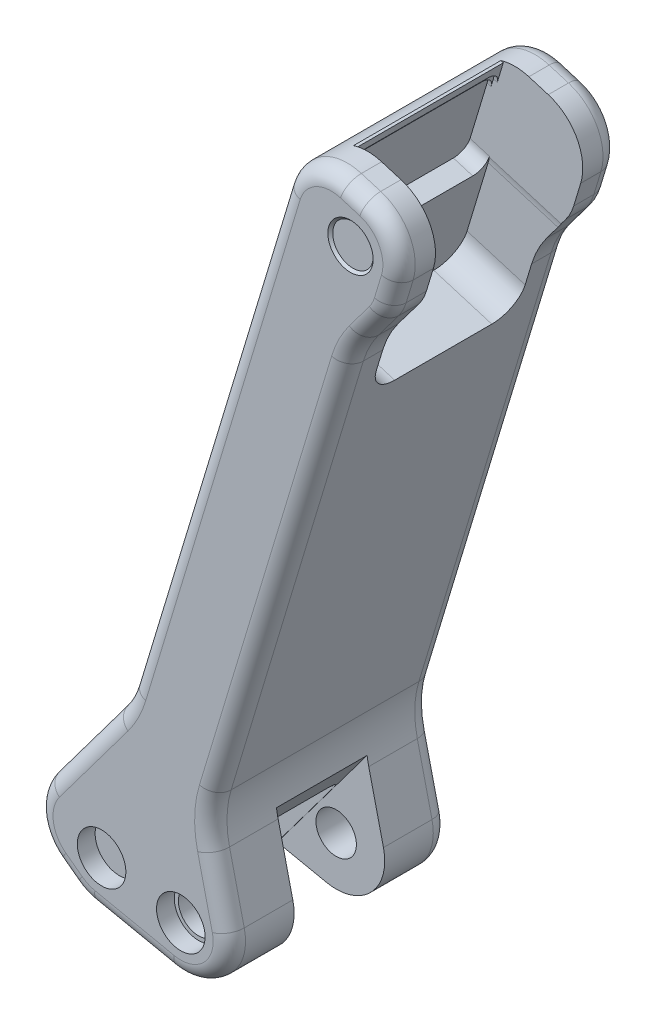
ISO-10303-21;
HEADER;
FILE_DESCRIPTION(('STEP AP214'),'2;1');
FILE_NAME('part.step','',(''),(''),'','','');
FILE_SCHEMA(('AUTOMOTIVE_DESIGN { 1 0 10303 214 1 1 1 1 }'));
ENDSEC;
DATA;
#1=APPLICATION_CONTEXT('core data for automotive mechanical design processes');
#2=APPLICATION_PROTOCOL_DEFINITION('international standard','automotive_design',2000,#1);
#3=PRODUCT_CONTEXT('',#1,'mechanical');
#4=PRODUCT('Part','Part','',(#3));
#5=PRODUCT_RELATED_PRODUCT_CATEGORY('part','',(#4));
#6=PRODUCT_DEFINITION_FORMATION('','',#4);
#7=PRODUCT_DEFINITION_CONTEXT('part definition',#1,'design');
#8=PRODUCT_DEFINITION('design','',#6,#7);
#9=PRODUCT_DEFINITION_SHAPE('','',#8);
#10=(LENGTH_UNIT() NAMED_UNIT(*) SI_UNIT(.MILLI.,.METRE.));
#11=(NAMED_UNIT(*) PLANE_ANGLE_UNIT() SI_UNIT($,.RADIAN.));
#12=(NAMED_UNIT(*) SI_UNIT($,.STERADIAN.) SOLID_ANGLE_UNIT());
#13=UNCERTAINTY_MEASURE_WITH_UNIT(LENGTH_MEASURE(1.E-05),#10,'distance_accuracy_value','');
#14=(GEOMETRIC_REPRESENTATION_CONTEXT(3) GLOBAL_UNCERTAINTY_ASSIGNED_CONTEXT((#13)) GLOBAL_UNIT_ASSIGNED_CONTEXT((#10,
#11,#12)) REPRESENTATION_CONTEXT('',''));
#15=CARTESIAN_POINT('',(0.,0.,0.));
#16=DIRECTION('',(0.,0.,1.));
#17=DIRECTION('',(1.,0.,0.));
#18=AXIS2_PLACEMENT_3D('',#15,#16,#17);
#19=CARTESIAN_POINT('',(-62.2626673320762,75.6016288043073,-3.89999999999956));
#20=DIRECTION('',(0.800623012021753,-0.599168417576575,0.));
#21=DIRECTION('',(0.599168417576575,0.800623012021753,0.));
#22=AXIS2_PLACEMENT_3D('',#19,#20,#21);
#23=PLANE('',#22);
#24=CARTESIAN_POINT('',(-62.2626673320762,75.6016288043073,-3.89999999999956));
#25=DIRECTION('',(0.80062301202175,-0.599168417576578,0.));
#26=DIRECTION('',(0.599168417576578,0.80062301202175,0.));
#27=AXIS2_PLACEMENT_3D('',#24,#25,#26);
#28=CIRCLE('',#27,1.6);
#29=CARTESIAN_POINT('',(-63.2213368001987,74.3206319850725,-3.89999999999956));
#30=VERTEX_POINT('',#29);
#31=CARTESIAN_POINT('',(-62.2626673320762,75.6016288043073,-5.49999999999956));
#32=VERTEX_POINT('',#31);
#33=EDGE_CURVE('E20',#30,#32,#28,.T.);
#34=ORIENTED_EDGE('',*,*,#33,.T.);
#35=DIRECTION('',(0.599168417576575,0.800623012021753,0.));
#36=VECTOR('',#35,1.);
#37=CARTESIAN_POINT('',(-62.2626673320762,75.6016288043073,-5.49999999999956));
#38=LINE('',#37,#36);
#39=CARTESIAN_POINT('',(-61.6634989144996,76.4022518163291,-5.49999999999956));
#40=VERTEX_POINT('',#39);
#41=EDGE_CURVE('E587',#32,#40,#38,.T.);
#42=ORIENTED_EDGE('',*,*,#41,.T.);
#43=CARTESIAN_POINT('',(-61.6634989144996,76.4022518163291,-3.89999999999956));
#44=DIRECTION('',(0.800623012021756,-0.599168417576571,0.));
#45=DIRECTION('',(0.599168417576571,0.800623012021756,0.));
#46=AXIS2_PLACEMENT_3D('',#43,#44,#45);
#47=CIRCLE('',#46,1.6);
#48=CARTESIAN_POINT('',(-62.6221683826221,75.1212549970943,-3.89999999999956));
#49=VERTEX_POINT('',#48);
#50=EDGE_CURVE('E878',#40,#49,#47,.F.);
#51=ORIENTED_EDGE('',*,*,#50,.T.);
#52=DIRECTION('',(0.,0.,1.));
#53=VECTOR('',#52,1.);
#54=CARTESIAN_POINT('',(-62.6221683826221,75.1212549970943,3.90000000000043));
#55=LINE('',#54,#53);
#56=CARTESIAN_POINT('',(-62.6221683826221,75.1212549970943,3.90000000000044));
#57=VERTEX_POINT('',#56);
#58=EDGE_CURVE('E620',#49,#57,#55,.T.);
#59=ORIENTED_EDGE('',*,*,#58,.T.);
#60=CARTESIAN_POINT('',(-61.6634989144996,76.4022518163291,3.90000000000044));
#61=DIRECTION('',(0.80062301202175,-0.599168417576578,0.));
#62=DIRECTION('',(0.599168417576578,0.80062301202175,0.));
#63=AXIS2_PLACEMENT_3D('',#60,#61,#62);
#64=CIRCLE('',#63,1.6);
#65=CARTESIAN_POINT('',(-61.6634989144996,76.4022518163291,5.50000000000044));
#66=VERTEX_POINT('',#65);
#67=EDGE_CURVE('E873',#57,#66,#64,.F.);
#68=ORIENTED_EDGE('',*,*,#67,.T.);
#69=DIRECTION('',(0.599168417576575,0.800623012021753,0.));
#70=VECTOR('',#69,1.);
#71=CARTESIAN_POINT('',(-62.2626673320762,75.6016288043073,5.50000000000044));
#72=LINE('',#71,#70);
#73=CARTESIAN_POINT('',(-62.2626673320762,75.6016288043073,5.50000000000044));
#74=VERTEX_POINT('',#73);
#75=EDGE_CURVE('E598',#66,#74,#72,.F.);
#76=ORIENTED_EDGE('',*,*,#75,.T.);
#77=CARTESIAN_POINT('',(-62.2626673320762,75.6016288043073,3.90000000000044));
#78=DIRECTION('',(0.80062301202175,-0.599168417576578,0.));
#79=DIRECTION('',(0.599168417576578,0.80062301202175,0.));
#80=AXIS2_PLACEMENT_3D('',#77,#78,#79);
#81=CIRCLE('',#80,1.6);
#82=CARTESIAN_POINT('',(-63.2213368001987,74.3206319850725,3.90000000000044));
#83=VERTEX_POINT('',#82);
#84=EDGE_CURVE('E879',#74,#83,#81,.T.);
#85=ORIENTED_EDGE('',*,*,#84,.T.);
#86=DIRECTION('',(0.,0.,1.));
#87=VECTOR('',#86,1.);
#88=CARTESIAN_POINT('',(-63.2213368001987,74.3206319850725,3.90000000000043));
#89=LINE('',#88,#87);
#90=EDGE_CURVE('E603',#83,#30,#89,.F.);
#91=ORIENTED_EDGE('',*,*,#90,.T.);
#92=EDGE_LOOP('',(#34,#42,#51,#59,#68,#76,#85,#91));
#93=FACE_BOUND('',#92,.T.);
#94=ADVANCED_FACE('F17',(#93),#23,.T.);
#95=CARTESIAN_POINT('',(-47.2843794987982,77.257193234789,-3.89999999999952));
#96=DIRECTION('',(0.800623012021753,-0.599168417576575,0.));
#97=DIRECTION('',(0.599168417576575,0.800623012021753,0.));
#98=AXIS2_PLACEMENT_3D('',#95,#96,#97);
#99=PLANE('',#98);
#100=CARTESIAN_POINT('',(-47.2843794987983,77.2571932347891,3.90000000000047));
#101=DIRECTION('',(0.80062301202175,-0.599168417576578,0.));
#102=DIRECTION('',(0.599168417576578,0.80062301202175,0.));
#103=AXIS2_PLACEMENT_3D('',#100,#101,#102);
#104=CIRCLE('',#103,1.6);
#105=CARTESIAN_POINT('',(-46.3257100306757,78.5381900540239,3.90000000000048));
#106=VERTEX_POINT('',#105);
#107=CARTESIAN_POINT('',(-47.2843794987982,77.257193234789,5.50000000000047));
#108=VERTEX_POINT('',#107);
#109=EDGE_CURVE('E870',#106,#108,#104,.T.);
#110=ORIENTED_EDGE('',*,*,#109,.T.);
#111=DIRECTION('',(0.599168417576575,0.800623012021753,0.));
#112=VECTOR('',#111,1.);
#113=CARTESIAN_POINT('',(-47.2843794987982,77.257193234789,5.50000000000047));
#114=LINE('',#113,#112);
#115=CARTESIAN_POINT('',(-48.2430489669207,75.9761964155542,5.50000000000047));
#116=VERTEX_POINT('',#115);
#117=EDGE_CURVE('E597',#108,#116,#114,.F.);
#118=ORIENTED_EDGE('',*,*,#117,.T.);
#119=CARTESIAN_POINT('',(-48.2430489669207,75.9761964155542,2.30000000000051));
#120=DIRECTION('',(0.800623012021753,-0.599168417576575,0.));
#121=DIRECTION('',(0.599168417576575,0.800623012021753,0.));
#122=AXIS2_PLACEMENT_3D('',#119,#120,#121);
#123=CIRCLE('',#122,3.2);
#124=CARTESIAN_POINT('',(-46.3257100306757,78.5381900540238,2.30000000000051));
#125=VERTEX_POINT('',#124);
#126=EDGE_CURVE('E849',#116,#125,#123,.F.);
#127=ORIENTED_EDGE('',*,*,#126,.T.);
#128=DIRECTION('',(0.,0.,1.));
#129=VECTOR('',#128,1.);
#130=CARTESIAN_POINT('',(-46.3257100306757,78.5381900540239,2.3000000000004));
#131=LINE('',#130,#129);
#132=EDGE_CURVE('E614',#125,#106,#131,.T.);
#133=ORIENTED_EDGE('',*,*,#132,.T.);
#134=EDGE_LOOP('',(#110,#118,#127,#133));
#135=FACE_BOUND('',#134,.T.);
#136=ADVANCED_FACE('F3014',(#135),#99,.T.);
#137=CARTESIAN_POINT('',(-62.2626673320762,75.6016288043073,-3.89999999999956));
#138=DIRECTION('',(0.80062301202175,-0.599168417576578,0.));
#139=DIRECTION('',(0.599168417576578,0.80062301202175,0.));
#140=AXIS2_PLACEMENT_3D('',#137,#138,#139);
#141=CYLINDRICAL_SURFACE('',#140,1.6);
#142=DIRECTION('',(0.80062301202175,-0.599168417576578,0.));
#143=VECTOR('',#142,1.);
#144=CARTESIAN_POINT('',(-62.2626673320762,75.6016288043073,-5.49999999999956));
#145=LINE('',#144,#143);
#146=CARTESIAN_POINT('',(-61.8623558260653,75.302044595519,-5.49999999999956));
#147=VERTEX_POINT('',#146);
#148=EDGE_CURVE('E591',#32,#147,#145,.T.);
#149=ORIENTED_EDGE('',*,*,#148,.F.);
#150=ORIENTED_EDGE('',*,*,#33,.F.);
#151=DIRECTION('',(0.800623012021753,-0.599168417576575,0.));
#152=VECTOR('',#151,1.);
#153=CARTESIAN_POINT('',(-63.2213368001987,74.3206319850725,-3.89999999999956));
#154=LINE('',#153,#152);
#155=CARTESIAN_POINT('',(-62.8210252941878,74.0210477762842,-3.89999999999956));
#156=VERTEX_POINT('',#155);
#157=EDGE_CURVE('E626',#30,#156,#154,.T.);
#158=ORIENTED_EDGE('',*,*,#157,.T.);
#159=CARTESIAN_POINT('',(-61.8623558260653,75.302044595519,-3.89999999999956));
#160=DIRECTION('',(0.80062301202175,-0.599168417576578,0.));
#161=DIRECTION('',(0.599168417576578,0.80062301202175,0.));
#162=AXIS2_PLACEMENT_3D('',#159,#160,#161);
#163=CIRCLE('',#162,1.6);
#164=EDGE_CURVE('E601',#147,#156,#163,.F.);
#165=ORIENTED_EDGE('',*,*,#164,.F.);
#166=EDGE_LOOP('',(#149,#150,#158,#165));
#167=FACE_BOUND('',#166,.T.);
#168=ADVANCED_FACE('F600',(#167),#141,.F.);
#169=CARTESIAN_POINT('',(-63.2213368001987,74.3206319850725,3.90000000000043));
#170=DIRECTION('',(-0.599168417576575,-0.800623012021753,0.));
#171=DIRECTION('',(0.800623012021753,-0.599168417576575,0.));
#172=AXIS2_PLACEMENT_3D('',#169,#170,#171);
#173=PLANE('',#172);
#174=ORIENTED_EDGE('',*,*,#157,.F.);
#175=ORIENTED_EDGE('',*,*,#90,.F.);
#176=DIRECTION('',(0.80062301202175,-0.599168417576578,0.));
#177=VECTOR('',#176,1.);
#178=CARTESIAN_POINT('',(-63.2213368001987,74.3206319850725,3.90000000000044));
#179=LINE('',#178,#177);
#180=CARTESIAN_POINT('',(-62.8210252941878,74.0210477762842,3.90000000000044));
#181=VERTEX_POINT('',#180);
#182=EDGE_CURVE('E880',#83,#181,#179,.T.);
#183=ORIENTED_EDGE('',*,*,#182,.T.);
#184=DIRECTION('',(0.,0.,1.));
#185=VECTOR('',#184,1.);
#186=CARTESIAN_POINT('',(-62.8210252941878,74.0210477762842,-13.5999999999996));
#187=LINE('',#186,#185);
#188=EDGE_CURVE('E847',#156,#181,#187,.T.);
#189=ORIENTED_EDGE('',*,*,#188,.F.);
#190=EDGE_LOOP('',(#174,#175,#183,#189));
#191=FACE_BOUND('',#190,.T.);
#192=ADVANCED_FACE('F2997',(#191),#173,.F.);
#193=CARTESIAN_POINT('',(-62.2626673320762,75.6016288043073,3.90000000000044));
#194=DIRECTION('',(0.80062301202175,-0.599168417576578,0.));
#195=DIRECTION('',(0.599168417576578,0.80062301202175,0.));
#196=AXIS2_PLACEMENT_3D('',#193,#194,#195);
#197=CYLINDRICAL_SURFACE('',#196,1.6);
#198=ORIENTED_EDGE('',*,*,#182,.F.);
#199=ORIENTED_EDGE('',*,*,#84,.F.);
#200=DIRECTION('',(0.80062301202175,-0.599168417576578,0.));
#201=VECTOR('',#200,1.);
#202=CARTESIAN_POINT('',(-62.2626673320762,75.6016288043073,5.50000000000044));
#203=LINE('',#202,#201);
#204=CARTESIAN_POINT('',(-61.8623558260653,75.302044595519,5.50000000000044));
#205=VERTEX_POINT('',#204);
#206=EDGE_CURVE('E881',#205,#74,#203,.F.);
#207=ORIENTED_EDGE('',*,*,#206,.F.);
#208=CARTESIAN_POINT('',(-61.8623558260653,75.302044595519,3.90000000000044));
#209=DIRECTION('',(0.80062301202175,-0.599168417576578,0.));
#210=DIRECTION('',(0.599168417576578,0.80062301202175,0.));
#211=AXIS2_PLACEMENT_3D('',#208,#209,#210);
#212=CIRCLE('',#211,1.6);
#213=EDGE_CURVE('E844',#181,#205,#212,.F.);
#214=ORIENTED_EDGE('',*,*,#213,.F.);
#215=EDGE_LOOP('',(#198,#199,#207,#214));
#216=FACE_BOUND('',#215,.T.);
#217=ADVANCED_FACE('F2988',(#216),#197,.F.);
#218=CARTESIAN_POINT('',(-62.0638104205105,76.7018360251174,-3.89999999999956));
#219=DIRECTION('',(0.800623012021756,-0.599168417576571,0.));
#220=DIRECTION('',(0.599168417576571,0.800623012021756,0.));
#221=AXIS2_PLACEMENT_3D('',#218,#219,#220);
#222=CYLINDRICAL_SURFACE('',#221,1.6);
#223=DIRECTION('',(0.800623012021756,-0.599168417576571,0.));
#224=VECTOR('',#223,1.);
#225=CARTESIAN_POINT('',(-62.0638104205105,76.7018360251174,-5.49999999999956));
#226=LINE('',#225,#224);
#227=CARTESIAN_POINT('',(-62.0638104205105,76.7018360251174,-5.49999999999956));
#228=VERTEX_POINT('',#227);
#229=EDGE_CURVE('E594',#228,#40,#226,.T.);
#230=ORIENTED_EDGE('',*,*,#229,.F.);
#231=CARTESIAN_POINT('',(-62.0638104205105,76.7018360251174,-3.89999999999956));
#232=DIRECTION('',(0.800623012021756,-0.599168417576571,0.));
#233=DIRECTION('',(0.599168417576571,0.800623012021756,0.));
#234=AXIS2_PLACEMENT_3D('',#231,#232,#233);
#235=CIRCLE('',#234,1.6);
#236=CARTESIAN_POINT('',(-63.022479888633,75.4208392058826,-3.89999999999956));
#237=VERTEX_POINT('',#236);
#238=EDGE_CURVE('E841',#237,#228,#235,.T.);
#239=ORIENTED_EDGE('',*,*,#238,.F.);
#240=DIRECTION('',(0.800623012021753,-0.599168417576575,0.));
#241=VECTOR('',#240,1.);
#242=CARTESIAN_POINT('',(-63.022479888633,75.4208392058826,-3.89999999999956));
#243=LINE('',#242,#241);
#244=EDGE_CURVE('E624',#237,#49,#243,.T.);
#245=ORIENTED_EDGE('',*,*,#244,.T.);
#246=ORIENTED_EDGE('',*,*,#50,.F.);
#247=EDGE_LOOP('',(#230,#239,#245,#246));
#248=FACE_BOUND('',#247,.T.);
#249=ADVANCED_FACE('F2979',(#248),#222,.F.);
#250=CARTESIAN_POINT('',(-62.0638104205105,76.7018360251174,3.90000000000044));
#251=DIRECTION('',(0.80062301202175,-0.599168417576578,0.));
#252=DIRECTION('',(0.599168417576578,0.80062301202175,0.));
#253=AXIS2_PLACEMENT_3D('',#250,#251,#252);
#254=CYLINDRICAL_SURFACE('',#253,1.6);
#255=DIRECTION('',(0.800623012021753,-0.599168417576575,0.));
#256=VECTOR('',#255,1.);
#257=CARTESIAN_POINT('',(-63.022479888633,75.4208392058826,3.90000000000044));
#258=LINE('',#257,#256);
#259=CARTESIAN_POINT('',(-63.022479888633,75.4208392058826,3.90000000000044));
#260=VERTEX_POINT('',#259);
#261=EDGE_CURVE('E876',#57,#260,#258,.F.);
#262=ORIENTED_EDGE('',*,*,#261,.T.);
#263=CARTESIAN_POINT('',(-62.0638104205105,76.7018360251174,3.90000000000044));
#264=DIRECTION('',(0.80062301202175,-0.599168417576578,0.));
#265=DIRECTION('',(0.599168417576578,0.80062301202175,0.));
#266=AXIS2_PLACEMENT_3D('',#263,#264,#265);
#267=CIRCLE('',#266,1.6);
#268=CARTESIAN_POINT('',(-62.0638104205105,76.7018360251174,5.50000000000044));
#269=VERTEX_POINT('',#268);
#270=EDGE_CURVE('E836',#269,#260,#267,.T.);
#271=ORIENTED_EDGE('',*,*,#270,.F.);
#272=DIRECTION('',(0.80062301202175,-0.599168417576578,0.));
#273=VECTOR('',#272,1.);
#274=CARTESIAN_POINT('',(-62.0638104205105,76.7018360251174,5.50000000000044));
#275=LINE('',#274,#273);
#276=EDGE_CURVE('E877',#66,#269,#275,.F.);
#277=ORIENTED_EDGE('',*,*,#276,.F.);
#278=ORIENTED_EDGE('',*,*,#67,.F.);
#279=EDGE_LOOP('',(#262,#271,#277,#278));
#280=FACE_BOUND('',#279,.T.);
#281=ADVANCED_FACE('F2970',(#280),#254,.F.);
#282=CARTESIAN_POINT('',(-63.022479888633,75.4208392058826,3.90000000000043));
#283=DIRECTION('',(-0.599168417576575,-0.800623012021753,0.));
#284=DIRECTION('',(0.800623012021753,-0.599168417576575,0.));
#285=AXIS2_PLACEMENT_3D('',#282,#283,#284);
#286=PLANE('',#285);
#287=ORIENTED_EDGE('',*,*,#244,.F.);
#288=DIRECTION('',(0.,0.,1.));
#289=VECTOR('',#288,1.);
#290=CARTESIAN_POINT('',(-63.022479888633,75.4208392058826,-3.89999999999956));
#291=LINE('',#290,#289);
#292=EDGE_CURVE('E835',#260,#237,#291,.F.);
#293=ORIENTED_EDGE('',*,*,#292,.F.);
#294=ORIENTED_EDGE('',*,*,#261,.F.);
#295=ORIENTED_EDGE('',*,*,#58,.F.);
#296=EDGE_LOOP('',(#287,#293,#294,#295));
#297=FACE_BOUND('',#296,.T.);
#298=ADVANCED_FACE('F2961',(#297),#286,.F.);
#299=CARTESIAN_POINT('',(-47.2843794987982,77.257193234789,-3.89999999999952));
#300=DIRECTION('',(0.800623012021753,-0.599168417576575,0.));
#301=DIRECTION('',(0.599168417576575,0.800623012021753,0.));
#302=AXIS2_PLACEMENT_3D('',#299,#300,#301);
#303=PLANE('',#302);
#304=CARTESIAN_POINT('',(-47.2843794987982,77.257193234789,-3.89999999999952));
#305=DIRECTION('',(0.800623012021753,-0.599168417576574,0.));
#306=DIRECTION('',(0.599168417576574,0.800623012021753,0.));
#307=AXIS2_PLACEMENT_3D('',#304,#305,#306);
#308=CIRCLE('',#307,1.6);
#309=CARTESIAN_POINT('',(-47.2843794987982,77.257193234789,-5.49999999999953));
#310=VERTEX_POINT('',#309);
#311=CARTESIAN_POINT('',(-46.3257100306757,78.5381900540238,-3.89999999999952));
#312=VERTEX_POINT('',#311);
#313=EDGE_CURVE('E866',#310,#312,#308,.T.);
#314=ORIENTED_EDGE('',*,*,#313,.T.);
#315=DIRECTION('',(0.,0.,1.));
#316=VECTOR('',#315,1.);
#317=CARTESIAN_POINT('',(-46.3257100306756,78.5381900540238,2.3000000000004));
#318=LINE('',#317,#316);
#319=CARTESIAN_POINT('',(-46.3257100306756,78.5381900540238,-2.29999999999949));
#320=VERTEX_POINT('',#319);
#321=EDGE_CURVE('E617',#312,#320,#318,.T.);
#322=ORIENTED_EDGE('',*,*,#321,.T.);
#323=CARTESIAN_POINT('',(-48.2430489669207,75.9761964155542,-2.29999999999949));
#324=DIRECTION('',(0.800623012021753,-0.599168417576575,0.));
#325=DIRECTION('',(0.599168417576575,0.800623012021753,0.));
#326=AXIS2_PLACEMENT_3D('',#323,#324,#325);
#327=CIRCLE('',#326,3.2);
#328=CARTESIAN_POINT('',(-48.2430489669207,75.9761964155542,-5.49999999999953));
#329=VERTEX_POINT('',#328);
#330=EDGE_CURVE('E828',#320,#329,#327,.F.);
#331=ORIENTED_EDGE('',*,*,#330,.T.);
#332=DIRECTION('',(0.599168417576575,0.800623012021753,0.));
#333=VECTOR('',#332,1.);
#334=CARTESIAN_POINT('',(-47.2843794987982,77.257193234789,-5.49999999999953));
#335=LINE('',#334,#333);
#336=EDGE_CURVE('E623',#329,#310,#335,.T.);
#337=ORIENTED_EDGE('',*,*,#336,.T.);
#338=EDGE_LOOP('',(#314,#322,#331,#337));
#339=FACE_BOUND('',#338,.T.);
#340=ADVANCED_FACE('F2952',(#339),#303,.T.);
#341=CARTESIAN_POINT('',(-47.2843794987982,77.257193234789,3.90000000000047));
#342=DIRECTION('',(0.80062301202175,-0.599168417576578,0.));
#343=DIRECTION('',(0.599168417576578,0.80062301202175,0.));
#344=AXIS2_PLACEMENT_3D('',#341,#342,#343);
#345=CYLINDRICAL_SURFACE('',#344,1.6);
#346=DIRECTION('',(0.80062301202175,-0.599168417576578,0.));
#347=VECTOR('',#346,1.);
#348=CARTESIAN_POINT('',(-47.2843794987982,77.257193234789,5.50000000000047));
#349=LINE('',#348,#347);
#350=CARTESIAN_POINT('',(-46.4837564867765,76.6580248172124,5.50000000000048));
#351=VERTEX_POINT('',#350);
#352=EDGE_CURVE('E872',#108,#351,#349,.T.);
#353=ORIENTED_EDGE('',*,*,#352,.F.);
#354=ORIENTED_EDGE('',*,*,#109,.F.);
#355=DIRECTION('',(-0.800623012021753,0.599168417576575,0.));
#356=VECTOR('',#355,1.);
#357=CARTESIAN_POINT('',(-72.3512242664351,98.0151048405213,3.90000000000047));
#358=LINE('',#357,#356);
#359=CARTESIAN_POINT('',(-45.5250870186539,77.9390216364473,3.90000000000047));
#360=VERTEX_POINT('',#359);
#361=EDGE_CURVE('E616',#106,#360,#358,.F.);
#362=ORIENTED_EDGE('',*,*,#361,.T.);
#363=CARTESIAN_POINT('',(-46.4837564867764,76.6580248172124,3.90000000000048));
#364=DIRECTION('',(0.80062301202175,-0.599168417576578,0.));
#365=DIRECTION('',(0.599168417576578,0.80062301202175,0.));
#366=AXIS2_PLACEMENT_3D('',#363,#364,#365);
#367=CIRCLE('',#366,1.6);
#368=EDGE_CURVE('E826',#351,#360,#367,.F.);
#369=ORIENTED_EDGE('',*,*,#368,.F.);
#370=EDGE_LOOP('',(#353,#354,#362,#369));
#371=FACE_BOUND('',#370,.T.);
#372=ADVANCED_FACE('F2943',(#371),#345,.F.);
#373=CARTESIAN_POINT('',(-72.3512242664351,98.0151048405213,2.3000000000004));
#374=DIRECTION('',(0.599168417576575,0.800623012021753,0.));
#375=DIRECTION('',(-0.800623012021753,0.599168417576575,0.));
#376=AXIS2_PLACEMENT_3D('',#373,#374,#375);
#377=PLANE('',#376);
#378=ORIENTED_EDGE('',*,*,#361,.F.);
#379=ORIENTED_EDGE('',*,*,#132,.F.);
#380=DIRECTION('',(0.800623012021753,-0.599168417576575,0.));
#381=VECTOR('',#380,1.);
#382=CARTESIAN_POINT('',(-72.3512242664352,98.0151048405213,2.3000000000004));
#383=LINE('',#382,#381);
#384=CARTESIAN_POINT('',(-55.5328746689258,85.4286268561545,2.30000000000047));
#385=VERTEX_POINT('',#384);
#386=EDGE_CURVE('E851',#125,#385,#383,.F.);
#387=ORIENTED_EDGE('',*,*,#386,.T.);
#388=DIRECTION('',(0.,0.,1.));
#389=VECTOR('',#388,1.);
#390=CARTESIAN_POINT('',(-55.5328746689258,85.4286268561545,-3.89999999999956));
#391=LINE('',#390,#389);
#392=CARTESIAN_POINT('',(-55.5328746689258,85.4286268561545,-2.29999999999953));
#393=VERTEX_POINT('',#392);
#394=EDGE_CURVE('E840',#393,#385,#391,.T.);
#395=ORIENTED_EDGE('',*,*,#394,.F.);
#396=DIRECTION('',(0.800623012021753,-0.599168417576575,0.));
#397=VECTOR('',#396,1.);
#398=CARTESIAN_POINT('',(-72.3512242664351,98.0151048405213,-2.29999999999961));
#399=LINE('',#398,#397);
#400=EDGE_CURVE('E831',#393,#320,#399,.T.);
#401=ORIENTED_EDGE('',*,*,#400,.T.);
#402=ORIENTED_EDGE('',*,*,#321,.F.);
#403=DIRECTION('',(0.800623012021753,-0.599168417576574,0.));
#404=VECTOR('',#403,1.);
#405=CARTESIAN_POINT('',(-46.3257100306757,78.5381900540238,-3.89999999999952));
#406=LINE('',#405,#404);
#407=CARTESIAN_POINT('',(-45.5250870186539,77.9390216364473,-3.89999999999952));
#408=VERTEX_POINT('',#407);
#409=EDGE_CURVE('E865',#312,#408,#406,.T.);
#410=ORIENTED_EDGE('',*,*,#409,.T.);
#411=DIRECTION('',(0.,0.,1.));
#412=VECTOR('',#411,1.);
#413=CARTESIAN_POINT('',(-45.5250870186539,77.9390216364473,4.70725375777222E-13));
#414=LINE('',#413,#412);
#415=EDGE_CURVE('E825',#360,#408,#414,.F.);
#416=ORIENTED_EDGE('',*,*,#415,.F.);
#417=EDGE_LOOP('',(#378,#379,#387,#395,#401,#402,#410,#416));
#418=FACE_BOUND('',#417,.T.);
#419=ADVANCED_FACE('F2934',(#418),#377,.F.);
#420=CARTESIAN_POINT('',(-47.2843794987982,77.257193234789,-3.89999999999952));
#421=DIRECTION('',(0.800623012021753,-0.599168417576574,0.));
#422=DIRECTION('',(0.599168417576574,0.800623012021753,0.));
#423=AXIS2_PLACEMENT_3D('',#420,#421,#422);
#424=CYLINDRICAL_SURFACE('',#423,1.6);
#425=ORIENTED_EDGE('',*,*,#409,.F.);
#426=ORIENTED_EDGE('',*,*,#313,.F.);
#427=DIRECTION('',(0.800623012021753,-0.599168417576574,0.));
#428=VECTOR('',#427,1.);
#429=CARTESIAN_POINT('',(-47.2843794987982,77.2571932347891,-5.49999999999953));
#430=LINE('',#429,#428);
#431=CARTESIAN_POINT('',(-46.4837564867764,76.6580248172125,-5.49999999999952));
#432=VERTEX_POINT('',#431);
#433=EDGE_CURVE('E869',#432,#310,#430,.F.);
#434=ORIENTED_EDGE('',*,*,#433,.F.);
#435=CARTESIAN_POINT('',(-46.4837564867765,76.6580248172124,-3.89999999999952));
#436=DIRECTION('',(0.800623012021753,-0.599168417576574,0.));
#437=DIRECTION('',(0.599168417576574,0.800623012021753,0.));
#438=AXIS2_PLACEMENT_3D('',#435,#436,#437);
#439=CIRCLE('',#438,1.6);
#440=EDGE_CURVE('E821',#408,#432,#439,.F.);
#441=ORIENTED_EDGE('',*,*,#440,.F.);
#442=EDGE_LOOP('',(#425,#426,#434,#441));
#443=FACE_BOUND('',#442,.T.);
#444=ADVANCED_FACE('F2925',(#443),#424,.F.);
#445=CARTESIAN_POINT('',(-46.2326212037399,71.8813825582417,-13.5999999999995));
#446=DIRECTION('',(0.,0.,-1.));
#447=DIRECTION('',(-1.,0.,0.));
#448=AXIS2_PLACEMENT_3D('',#445,#446,#447);
#449=CYLINDRICAL_SURFACE('',#448,2.49999999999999);
#450=CARTESIAN_POINT('',(-46.2326212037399,71.8813825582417,-5.59999999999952));
#451=DIRECTION('',(0.,0.,-1.));
#452=DIRECTION('',(-1.,0.,0.));
#453=AXIS2_PLACEMENT_3D('',#450,#451,#452);
#454=CIRCLE('',#453,2.49999999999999);
#455=CARTESIAN_POINT('',(-48.7326212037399,71.8813825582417,-5.59999999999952));
#456=VERTEX_POINT('',#455);
#457=EDGE_CURVE('E862',#456,#456,#454,.F.);
#458=ORIENTED_EDGE('',*,*,#457,.T.);
#459=EDGE_LOOP('',(#458));
#460=FACE_BOUND('',#459,.T.);
#461=CARTESIAN_POINT('',(-46.2326212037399,71.8813825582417,-11.3999999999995));
#462=DIRECTION('',(0.,0.,-1.));
#463=DIRECTION('',(-1.,0.,0.));
#464=AXIS2_PLACEMENT_3D('',#461,#462,#463);
#465=CIRCLE('',#464,2.49999999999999);
#466=CARTESIAN_POINT('',(-48.7326212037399,71.8813825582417,-11.3999999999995));
#467=VERTEX_POINT('',#466);
#468=EDGE_CURVE('E816',#467,#467,#465,.T.);
#469=ORIENTED_EDGE('',*,*,#468,.T.);
#470=EDGE_LOOP('',(#469));
#471=FACE_BOUND('',#470,.T.);
#472=ADVANCED_FACE('F2916',(#460,#471),#449,.F.);
#473=CARTESIAN_POINT('',(-47.5560887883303,60.0990549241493,-5.59999999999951));
#474=DIRECTION('',(0.,0.,-1.));
#475=DIRECTION('',(-1.,0.,0.));
#476=AXIS2_PLACEMENT_3D('',#473,#474,#475);
#477=PLANE('',#476);
#478=DIRECTION('',(-0.97883038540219,0.204673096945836,0.));
#479=VECTOR('',#478,1.);
#480=CARTESIAN_POINT('',(-57.2489636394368,68.0551312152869,-5.59999999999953));
#481=LINE('',#480,#479);
#482=CARTESIAN_POINT('',(-53.5074612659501,67.2727843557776,-5.59999999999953));
#483=VERTEX_POINT('',#482);
#484=CARTESIAN_POINT('',(-47.460659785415,66.0084002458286,-5.59999999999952));
#485=VERTEX_POINT('',#484);
#486=EDGE_CURVE('E921',#483,#485,#481,.F.);
#487=ORIENTED_EDGE('',*,*,#486,.T.);
#488=CARTESIAN_POINT('',(-46.2326212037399,71.8813825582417,-5.59999999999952));
#489=DIRECTION('',(0.,0.,1.));
#490=DIRECTION('',(1.,0.,0.));
#491=AXIS2_PLACEMENT_3D('',#488,#489,#490);
#492=CIRCLE('',#491,6.);
#493=CARTESIAN_POINT('',(-40.3909000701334,73.2504312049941,-5.59999999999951));
#494=VERTEX_POINT('',#493);
#495=EDGE_CURVE('E811',#494,#485,#492,.F.);
#496=ORIENTED_EDGE('',*,*,#495,.F.);
#497=DIRECTION('',(0.228174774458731,-0.973620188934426,0.));
#498=VECTOR('',#497,1.);
#499=CARTESIAN_POINT('',(-40.3909000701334,73.2504312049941,-5.59999999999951));
#500=LINE('',#499,#498);
#501=CARTESIAN_POINT('',(-42.2076915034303,81.0026677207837,-5.59999999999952));
#502=VERTEX_POINT('',#501);
#503=EDGE_CURVE('E814',#494,#502,#500,.F.);
#504=ORIENTED_EDGE('',*,*,#503,.T.);
#505=CARTESIAN_POINT('',(-30.5242492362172,83.7407650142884,-5.5999999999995));
#506=DIRECTION('',(0.,0.,1.));
#507=DIRECTION('',(1.,0.,0.));
#508=AXIS2_PLACEMENT_3D('',#505,#506,#507);
#509=CIRCLE('',#508,12.);
#510=CARTESIAN_POINT('',(-42.411479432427,82.0994977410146,-5.59999999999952));
#511=VERTEX_POINT('',#510);
#512=EDGE_CURVE('E859',#511,#502,#509,.T.);
#513=ORIENTED_EDGE('',*,*,#512,.F.);
#514=DIRECTION('',(0.599168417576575,0.800623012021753,0.));
#515=VECTOR('',#514,1.);
#516=CARTESIAN_POINT('',(-51.2171869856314,70.3331030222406,-5.59999999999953));
#517=LINE('',#516,#515);
#518=EDGE_CURVE('E824',#483,#511,#517,.T.);
#519=ORIENTED_EDGE('',*,*,#518,.F.);
#520=EDGE_LOOP('',(#487,#496,#504,#513,#519));
#521=FACE_BOUND('',#520,.T.);
#522=ORIENTED_EDGE('',*,*,#457,.F.);
#523=EDGE_LOOP('',(#522));
#524=FACE_BOUND('',#523,.T.);
#525=ADVANCED_FACE('F2907',(#521,#524),#477,.F.);
#526=CARTESIAN_POINT('',(-31.0032597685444,156.496986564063,-13.5999999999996));
#527=DIRECTION('',(0.957267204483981,-0.289204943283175,0.));
#528=DIRECTION('',(0.289204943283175,0.957267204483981,0.));
#529=AXIS2_PLACEMENT_3D('',#526,#527,#528);
#530=PLANE('',#529);
#531=CARTESIAN_POINT('',(-30.598372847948,157.837160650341,7.50000000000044));
#532=DIRECTION('',(0.957267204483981,-0.289204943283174,0.));
#533=DIRECTION('',(0.289204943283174,0.957267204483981,0.));
#534=AXIS2_PLACEMENT_3D('',#531,#532,#533);
#535=CIRCLE('',#534,1.6);
#536=CARTESIAN_POINT('',(-30.598372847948,157.837160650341,9.10000000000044));
#537=VERTEX_POINT('',#536);
#538=CARTESIAN_POINT('',(-30.135644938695,159.368788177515,7.50000000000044));
#539=VERTEX_POINT('',#538);
#540=EDGE_CURVE('E792',#537,#539,#535,.F.);
#541=ORIENTED_EDGE('',*,*,#540,.T.);
#542=DIRECTION('',(0.,0.,1.));
#543=VECTOR('',#542,1.);
#544=CARTESIAN_POINT('',(-30.135644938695,159.368788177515,7.50000000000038));
#545=LINE('',#544,#543);
#546=CARTESIAN_POINT('',(-30.135644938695,159.368788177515,-7.49999999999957));
#547=VERTEX_POINT('',#546);
#548=EDGE_CURVE('E1236',#539,#547,#545,.F.);
#549=ORIENTED_EDGE('',*,*,#548,.T.);
#550=CARTESIAN_POINT('',(-30.5983728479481,157.837160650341,-7.49999999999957));
#551=DIRECTION('',(0.957267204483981,-0.289204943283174,0.));
#552=DIRECTION('',(0.289204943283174,0.957267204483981,0.));
#553=AXIS2_PLACEMENT_3D('',#550,#551,#552);
#554=CIRCLE('',#553,1.6);
#555=CARTESIAN_POINT('',(-30.598372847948,157.837160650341,-9.09999999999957));
#556=VERTEX_POINT('',#555);
#557=EDGE_CURVE('E797',#547,#556,#554,.F.);
#558=ORIENTED_EDGE('',*,*,#557,.T.);
#559=DIRECTION('',(0.289204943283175,0.957267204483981,0.));
#560=VECTOR('',#559,1.);
#561=CARTESIAN_POINT('',(-31.0032597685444,156.496986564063,-9.09999999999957));
#562=LINE('',#561,#560);
#563=CARTESIAN_POINT('',(-30.3091679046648,158.794427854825,-9.09999999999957));
#564=VERTEX_POINT('',#563);
#565=EDGE_CURVE('E861',#556,#564,#562,.T.);
#566=ORIENTED_EDGE('',*,*,#565,.T.);
#567=CARTESIAN_POINT('',(-30.3091679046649,158.794427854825,-7.49999999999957));
#568=DIRECTION('',(0.957267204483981,-0.289204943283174,0.));
#569=DIRECTION('',(0.289204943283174,0.957267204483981,0.));
#570=AXIS2_PLACEMENT_3D('',#567,#568,#569);
#571=CIRCLE('',#570,1.6);
#572=CARTESIAN_POINT('',(-29.8464399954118,160.326055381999,-7.49999999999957));
#573=VERTEX_POINT('',#572);
#574=EDGE_CURVE('E774',#564,#573,#571,.T.);
#575=ORIENTED_EDGE('',*,*,#574,.T.);
#576=DIRECTION('',(0.,0.,1.));
#577=VECTOR('',#576,1.);
#578=CARTESIAN_POINT('',(-29.8464399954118,160.326055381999,7.50000000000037));
#579=LINE('',#578,#577);
#580=CARTESIAN_POINT('',(-29.8464399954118,160.326055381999,7.50000000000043));
#581=VERTEX_POINT('',#580);
#582=EDGE_CURVE('E1213',#573,#581,#579,.T.);
#583=ORIENTED_EDGE('',*,*,#582,.T.);
#584=CARTESIAN_POINT('',(-30.309167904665,158.794427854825,7.50000000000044));
#585=DIRECTION('',(0.957267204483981,-0.289204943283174,0.));
#586=DIRECTION('',(0.289204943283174,0.957267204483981,0.));
#587=AXIS2_PLACEMENT_3D('',#584,#585,#586);
#588=CIRCLE('',#587,1.6);
#589=CARTESIAN_POINT('',(-30.3091679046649,158.794427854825,9.10000000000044));
#590=VERTEX_POINT('',#589);
#591=EDGE_CURVE('E778',#581,#590,#588,.T.);
#592=ORIENTED_EDGE('',*,*,#591,.T.);
#593=DIRECTION('',(0.289204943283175,0.957267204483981,0.));
#594=VECTOR('',#593,1.);
#595=CARTESIAN_POINT('',(-31.0032597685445,156.496986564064,9.10000000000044));
#596=LINE('',#595,#594);
#597=EDGE_CURVE('E858',#590,#537,#596,.F.);
#598=ORIENTED_EDGE('',*,*,#597,.T.);
#599=EDGE_LOOP('',(#541,#549,#558,#566,#575,#583,#592,#598));
#600=FACE_BOUND('',#599,.T.);
#601=ADVANCED_FACE('F2898',(#600),#530,.T.);
#602=CARTESIAN_POINT('',(-46.2326212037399,71.8813825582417,-13.5999999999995));
#603=DIRECTION('',(0.,0.,-1.));
#604=DIRECTION('',(-1.,0.,0.));
#605=AXIS2_PLACEMENT_3D('',#602,#603,#604);
#606=CYLINDRICAL_SURFACE('',#605,2.49999999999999);
#607=CARTESIAN_POINT('',(-46.2326212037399,71.8813825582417,5.60000000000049));
#608=DIRECTION('',(0.,0.,-1.));
#609=DIRECTION('',(-1.,0.,0.));
#610=AXIS2_PLACEMENT_3D('',#607,#608,#609);
#611=CIRCLE('',#610,2.49999999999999);
#612=CARTESIAN_POINT('',(-48.7326212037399,71.8813825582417,5.60000000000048));
#613=VERTEX_POINT('',#612);
#614=EDGE_CURVE('E855',#613,#613,#611,.T.);
#615=ORIENTED_EDGE('',*,*,#614,.T.);
#616=EDGE_LOOP('',(#615));
#617=FACE_BOUND('',#616,.T.);
#618=CARTESIAN_POINT('',(-46.23262120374,71.8813825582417,11.4000000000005));
#619=DIRECTION('',(0.,0.,-1.));
#620=DIRECTION('',(-1.,0.,0.));
#621=AXIS2_PLACEMENT_3D('',#618,#619,#620);
#622=CIRCLE('',#621,2.49999999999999);
#623=CARTESIAN_POINT('',(-48.73262120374,71.8813825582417,11.4000000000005));
#624=VERTEX_POINT('',#623);
#625=EDGE_CURVE('E769',#624,#624,#622,.F.);
#626=ORIENTED_EDGE('',*,*,#625,.T.);
#627=EDGE_LOOP('',(#626));
#628=FACE_BOUND('',#627,.T.);
#629=ADVANCED_FACE('F2889',(#617,#628),#606,.F.);
#630=CARTESIAN_POINT('',(-47.5560887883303,60.0990549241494,5.60000000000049));
#631=DIRECTION('',(0.,0.,1.));
#632=DIRECTION('',(1.,0.,0.));
#633=AXIS2_PLACEMENT_3D('',#630,#631,#632);
#634=PLANE('',#633);
#635=CARTESIAN_POINT('',(-30.5242492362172,83.7407650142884,5.6000000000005));
#636=DIRECTION('',(0.,0.,1.));
#637=DIRECTION('',(1.,0.,0.));
#638=AXIS2_PLACEMENT_3D('',#635,#636,#637);
#639=CIRCLE('',#638,12.);
#640=CARTESIAN_POINT('',(-42.2076915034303,81.0026677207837,5.60000000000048));
#641=VERTEX_POINT('',#640);
#642=CARTESIAN_POINT('',(-42.411479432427,82.0994977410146,5.60000000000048));
#643=VERTEX_POINT('',#642);
#644=EDGE_CURVE('E852',#641,#643,#639,.F.);
#645=ORIENTED_EDGE('',*,*,#644,.F.);
#646=DIRECTION('',(0.228174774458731,-0.973620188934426,0.));
#647=VECTOR('',#646,1.);
#648=CARTESIAN_POINT('',(-40.3909000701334,73.2504312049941,5.60000000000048));
#649=LINE('',#648,#647);
#650=CARTESIAN_POINT('',(-40.3909000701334,73.2504312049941,5.60000000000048));
#651=VERTEX_POINT('',#650);
#652=EDGE_CURVE('E767',#641,#651,#649,.T.);
#653=ORIENTED_EDGE('',*,*,#652,.T.);
#654=CARTESIAN_POINT('',(-46.2326212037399,71.8813825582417,5.60000000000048));
#655=DIRECTION('',(0.,0.,1.));
#656=DIRECTION('',(1.,0.,0.));
#657=AXIS2_PLACEMENT_3D('',#654,#655,#656);
#658=CIRCLE('',#657,6.);
#659=CARTESIAN_POINT('',(-47.460659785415,66.0084002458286,5.60000000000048));
#660=VERTEX_POINT('',#659);
#661=EDGE_CURVE('E765',#660,#651,#658,.T.);
#662=ORIENTED_EDGE('',*,*,#661,.F.);
#663=DIRECTION('',(-0.97883038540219,0.204673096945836,0.));
#664=VECTOR('',#663,1.);
#665=CARTESIAN_POINT('',(-57.2489636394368,68.0551312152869,5.60000000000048));
#666=LINE('',#665,#664);
#667=CARTESIAN_POINT('',(-53.5074612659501,67.2727843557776,5.60000000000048));
#668=VERTEX_POINT('',#667);
#669=EDGE_CURVE('E772',#660,#668,#666,.T.);
#670=ORIENTED_EDGE('',*,*,#669,.T.);
#671=DIRECTION('',(0.599168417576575,0.800623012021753,0.));
#672=VECTOR('',#671,1.);
#673=CARTESIAN_POINT('',(-51.2171869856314,70.3331030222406,5.60000000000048));
#674=LINE('',#673,#672);
#675=EDGE_CURVE('E820',#643,#668,#674,.F.);
#676=ORIENTED_EDGE('',*,*,#675,.F.);
#677=EDGE_LOOP('',(#645,#653,#662,#670,#676));
#678=FACE_BOUND('',#677,.T.);
#679=ORIENTED_EDGE('',*,*,#614,.F.);
#680=EDGE_LOOP('',(#679));
#681=FACE_BOUND('',#680,.T.);
#682=ADVANCED_FACE('F2880',(#678,#681),#634,.F.);
#683=CARTESIAN_POINT('',(-84.5048068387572,156.15529710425,6.00000000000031));
#684=DIRECTION('',(0.957267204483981,-0.289204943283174,0.));
#685=DIRECTION('',(0.289204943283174,0.957267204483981,0.));
#686=AXIS2_PLACEMENT_3D('',#683,#684,#685);
#687=CYLINDRICAL_SURFACE('',#686,3.2);
#688=CARTESIAN_POINT('',(-33.6581634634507,140.79375484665,6.00000000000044));
#689=DIRECTION('',(0.957267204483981,-0.289204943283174,0.));
#690=DIRECTION('',(0.289204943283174,0.957267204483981,0.));
#691=AXIS2_PLACEMENT_3D('',#688,#689,#690);
#692=CIRCLE('',#691,3.2);
#693=CARTESIAN_POINT('',(-33.6581634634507,140.79375484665,9.20000000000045));
#694=VERTEX_POINT('',#693);
#695=CARTESIAN_POINT('',(-34.5836192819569,137.730499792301,6.00000000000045));
#696=VERTEX_POINT('',#695);
#697=EDGE_CURVE('E787',#694,#696,#692,.T.);
#698=ORIENTED_EDGE('',*,*,#697,.F.);
#699=DIRECTION('',(0.957267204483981,-0.289204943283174,0.));
#700=VECTOR('',#699,1.);
#701=CARTESIAN_POINT('',(-33.6581634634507,140.79375484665,9.20000000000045));
#702=LINE('',#701,#700);
#703=CARTESIAN_POINT('',(-26.4786594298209,138.624717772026,9.20000000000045));
#704=VERTEX_POINT('',#703);
#705=EDGE_CURVE('E782',#694,#704,#702,.T.);
#706=ORIENTED_EDGE('',*,*,#705,.T.);
#707=CARTESIAN_POINT('',(-26.4786594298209,138.624717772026,6.00000000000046));
#708=DIRECTION('',(0.957267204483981,-0.289204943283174,0.));
#709=DIRECTION('',(0.289204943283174,0.957267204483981,0.));
#710=AXIS2_PLACEMENT_3D('',#707,#708,#709);
#711=CIRCLE('',#710,3.2);
#712=CARTESIAN_POINT('',(-27.4041152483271,135.561462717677,6.00000000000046));
#713=VERTEX_POINT('',#712);
#714=EDGE_CURVE('E761',#704,#713,#711,.T.);
#715=ORIENTED_EDGE('',*,*,#714,.T.);
#716=DIRECTION('',(0.957267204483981,-0.289204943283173,0.));
#717=VECTOR('',#716,1.);
#718=CARTESIAN_POINT('',(-85.4302626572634,153.092042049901,6.00000000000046));
#719=LINE('',#718,#717);
#720=EDGE_CURVE('E854',#713,#696,#719,.F.);
#721=ORIENTED_EDGE('',*,*,#720,.T.);
#722=EDGE_LOOP('',(#698,#706,#715,#721));
#723=FACE_BOUND('',#722,.T.);
#724=ADVANCED_FACE('F2871',(#723),#687,.F.);
#725=CARTESIAN_POINT('',(-85.4302626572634,153.092042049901,6.00000000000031));
#726=DIRECTION('',(-0.289204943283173,-0.957267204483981,0.));
#727=DIRECTION('',(0.957267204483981,-0.289204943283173,0.));
#728=AXIS2_PLACEMENT_3D('',#725,#726,#727);
#729=PLANE('',#728);
#730=DIRECTION('',(0.,0.,1.));
#731=VECTOR('',#730,1.);
#732=CARTESIAN_POINT('',(-34.5836192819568,137.730499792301,-13.5999999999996));
#733=LINE('',#732,#731);
#734=CARTESIAN_POINT('',(-34.5836192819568,137.730499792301,-5.99999999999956));
#735=VERTEX_POINT('',#734);
#736=EDGE_CURVE('E786',#696,#735,#733,.F.);
#737=ORIENTED_EDGE('',*,*,#736,.F.);
#738=ORIENTED_EDGE('',*,*,#720,.F.);
#739=DIRECTION('',(0.,0.,1.));
#740=VECTOR('',#739,1.);
#741=CARTESIAN_POINT('',(-27.404115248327,135.561462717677,-13.5999999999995));
#742=LINE('',#741,#740);
#743=CARTESIAN_POINT('',(-27.404115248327,135.561462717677,-5.99999999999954));
#744=VERTEX_POINT('',#743);
#745=EDGE_CURVE('E760',#713,#744,#742,.F.);
#746=ORIENTED_EDGE('',*,*,#745,.T.);
#747=DIRECTION('',(0.957267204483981,-0.289204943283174,0.));
#748=VECTOR('',#747,1.);
#749=CARTESIAN_POINT('',(-85.4302626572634,153.092042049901,-5.99999999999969));
#750=LINE('',#749,#748);
#751=EDGE_CURVE('E894',#744,#735,#750,.F.);
#752=ORIENTED_EDGE('',*,*,#751,.T.);
#753=EDGE_LOOP('',(#737,#738,#746,#752));
#754=FACE_BOUND('',#753,.T.);
#755=ADVANCED_FACE('F2862',(#754),#729,.F.);
#756=CARTESIAN_POINT('',(-84.5048068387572,156.15529710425,-5.99999999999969));
#757=DIRECTION('',(0.957267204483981,-0.289204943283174,0.));
#758=DIRECTION('',(0.289204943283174,0.957267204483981,0.));
#759=AXIS2_PLACEMENT_3D('',#756,#757,#758);
#760=CYLINDRICAL_SURFACE('',#759,3.2);
#761=CARTESIAN_POINT('',(-33.6581634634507,140.79375484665,-5.99999999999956));
#762=DIRECTION('',(0.957267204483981,-0.289204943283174,0.));
#763=DIRECTION('',(0.289204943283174,0.957267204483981,0.));
#764=AXIS2_PLACEMENT_3D('',#761,#762,#763);
#765=CIRCLE('',#764,3.2);
#766=CARTESIAN_POINT('',(-33.6581634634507,140.79375484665,-9.19999999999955));
#767=VERTEX_POINT('',#766);
#768=EDGE_CURVE('E783',#735,#767,#765,.T.);
#769=ORIENTED_EDGE('',*,*,#768,.F.);
#770=ORIENTED_EDGE('',*,*,#751,.F.);
#771=CARTESIAN_POINT('',(-26.4786594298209,138.624717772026,-5.99999999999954));
#772=DIRECTION('',(0.957267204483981,-0.289204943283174,0.));
#773=DIRECTION('',(0.289204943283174,0.957267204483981,0.));
#774=AXIS2_PLACEMENT_3D('',#771,#772,#773);
#775=CIRCLE('',#774,3.2);
#776=CARTESIAN_POINT('',(-26.4786594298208,138.624717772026,-9.19999999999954));
#777=VERTEX_POINT('',#776);
#778=EDGE_CURVE('E756',#744,#777,#775,.T.);
#779=ORIENTED_EDGE('',*,*,#778,.T.);
#780=DIRECTION('',(-0.957267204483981,0.289204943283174,0.));
#781=VECTOR('',#780,1.);
#782=CARTESIAN_POINT('',(-26.4786594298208,138.624717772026,-9.19999999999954));
#783=LINE('',#782,#781);
#784=EDGE_CURVE('E804',#777,#767,#783,.T.);
#785=ORIENTED_EDGE('',*,*,#784,.T.);
#786=EDGE_LOOP('',(#769,#770,#779,#785));
#787=FACE_BOUND('',#786,.T.);
#788=ADVANCED_FACE('F2853',(#787),#760,.F.);
#789=CARTESIAN_POINT('',(-74.2685632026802,95.4531112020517,2.3000000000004));
#790=DIRECTION('',(0.800623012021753,-0.599168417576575,0.));
#791=DIRECTION('',(0.599168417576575,0.800623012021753,0.));
#792=AXIS2_PLACEMENT_3D('',#789,#790,#791);
#793=CYLINDRICAL_SURFACE('',#792,3.2);
#794=DIRECTION('',(-0.800623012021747,0.599168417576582,0.));
#795=VECTOR('',#794,1.);
#796=CARTESIAN_POINT('',(-48.2430489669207,75.9761964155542,5.50000000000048));
#797=LINE('',#796,#795);
#798=CARTESIAN_POINT('',(-57.4502136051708,82.8666332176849,5.50000000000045));
#799=VERTEX_POINT('',#798);
#800=EDGE_CURVE('E1056',#116,#799,#797,.T.);
#801=ORIENTED_EDGE('',*,*,#800,.T.);
#802=CARTESIAN_POINT('',(-57.4502136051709,82.8666332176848,2.30000000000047));
#803=DIRECTION('',(0.800623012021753,-0.599168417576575,0.));
#804=DIRECTION('',(0.599168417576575,0.800623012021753,0.));
#805=AXIS2_PLACEMENT_3D('',#802,#803,#804);
#806=CIRCLE('',#805,3.2);
#807=EDGE_CURVE('E838',#385,#799,#806,.T.);
#808=ORIENTED_EDGE('',*,*,#807,.F.);
#809=ORIENTED_EDGE('',*,*,#386,.F.);
#810=ORIENTED_EDGE('',*,*,#126,.F.);
#811=EDGE_LOOP('',(#801,#808,#809,#810));
#812=FACE_BOUND('',#811,.T.);
#813=ADVANCED_FACE('F2844',(#812),#793,.F.);
#814=CARTESIAN_POINT('',(-60.4243516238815,77.2235398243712,-13.5999999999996));
#815=DIRECTION('',(0.800623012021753,-0.599168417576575,0.));
#816=DIRECTION('',(0.599168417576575,0.800623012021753,0.));
#817=AXIS2_PLACEMENT_3D('',#814,#815,#816);
#818=PLANE('',#817);
#819=ORIENTED_EDGE('',*,*,#213,.T.);
#820=DIRECTION('',(-0.599168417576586,-0.800623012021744,0.));
#821=VECTOR('',#820,1.);
#822=CARTESIAN_POINT('',(-61.8623558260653,75.302044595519,5.50000000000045));
#823=LINE('',#822,#821);
#824=CARTESIAN_POINT('',(-63.4201937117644,73.2204247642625,5.50000000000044));
#825=VERTEX_POINT('',#824);
#826=EDGE_CURVE('E1075',#205,#825,#823,.T.);
#827=ORIENTED_EDGE('',*,*,#826,.T.);
#828=DIRECTION('',(0.,0.,1.));
#829=VECTOR('',#828,1.);
#830=CARTESIAN_POINT('',(-63.4201937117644,73.2204247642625,5.50000000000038));
#831=LINE('',#830,#829);
#832=CARTESIAN_POINT('',(-63.4201937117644,73.2204247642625,-5.49999999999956));
#833=VERTEX_POINT('',#832);
#834=EDGE_CURVE('E1054',#825,#833,#831,.F.);
#835=ORIENTED_EDGE('',*,*,#834,.T.);
#836=DIRECTION('',(0.599168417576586,0.800623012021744,0.));
#837=VECTOR('',#836,1.);
#838=CARTESIAN_POINT('',(-63.4201937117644,73.2204247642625,-5.49999999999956));
#839=LINE('',#838,#837);
#840=EDGE_CURVE('E1046',#833,#147,#839,.T.);
#841=ORIENTED_EDGE('',*,*,#840,.T.);
#842=ORIENTED_EDGE('',*,*,#164,.T.);
#843=ORIENTED_EDGE('',*,*,#188,.T.);
#844=EDGE_LOOP('',(#819,#827,#835,#841,#842,#843));
#845=FACE_BOUND('',#844,.T.);
#846=ADVANCED_FACE('F2835',(#845),#818,.T.);
#847=CARTESIAN_POINT('',(-62.0638104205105,76.7018360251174,-3.89999999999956));
#848=DIRECTION('',(0.800623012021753,-0.599168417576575,0.));
#849=DIRECTION('',(0.599168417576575,0.800623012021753,0.));
#850=AXIS2_PLACEMENT_3D('',#847,#848,#849);
#851=PLANE('',#850);
#852=ORIENTED_EDGE('',*,*,#270,.T.);
#853=ORIENTED_EDGE('',*,*,#292,.T.);
#854=ORIENTED_EDGE('',*,*,#238,.T.);
#855=DIRECTION('',(0.599168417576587,0.800623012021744,0.));
#856=VECTOR('',#855,1.);
#857=CARTESIAN_POINT('',(-62.0638104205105,76.7018360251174,-5.49999999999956));
#858=LINE('',#857,#856);
#859=CARTESIAN_POINT('',(-57.4502136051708,82.8666332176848,-5.49999999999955));
#860=VERTEX_POINT('',#859);
#861=EDGE_CURVE('E1043',#228,#860,#858,.T.);
#862=ORIENTED_EDGE('',*,*,#861,.T.);
#863=CARTESIAN_POINT('',(-57.4502136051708,82.8666332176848,-2.29999999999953));
#864=DIRECTION('',(0.800623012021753,-0.599168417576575,0.));
#865=DIRECTION('',(0.599168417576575,0.800623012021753,0.));
#866=AXIS2_PLACEMENT_3D('',#863,#864,#865);
#867=CIRCLE('',#866,3.2);
#868=EDGE_CURVE('E832',#860,#393,#867,.T.);
#869=ORIENTED_EDGE('',*,*,#868,.T.);
#870=ORIENTED_EDGE('',*,*,#394,.T.);
#871=ORIENTED_EDGE('',*,*,#807,.T.);
#872=DIRECTION('',(-0.599168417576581,-0.800623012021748,0.));
#873=VECTOR('',#872,1.);
#874=CARTESIAN_POINT('',(-57.4502136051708,82.8666332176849,5.50000000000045));
#875=LINE('',#874,#873);
#876=EDGE_CURVE('E1078',#799,#269,#875,.T.);
#877=ORIENTED_EDGE('',*,*,#876,.T.);
#878=EDGE_LOOP('',(#852,#853,#854,#862,#869,#870,#871,#877));
#879=FACE_BOUND('',#878,.T.);
#880=ADVANCED_FACE('F2826',(#879),#851,.T.);
#881=CARTESIAN_POINT('',(-74.2685632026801,95.4531112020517,-2.29999999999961));
#882=DIRECTION('',(0.800623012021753,-0.599168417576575,0.));
#883=DIRECTION('',(0.599168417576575,0.800623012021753,0.));
#884=AXIS2_PLACEMENT_3D('',#881,#882,#883);
#885=CYLINDRICAL_SURFACE('',#884,3.2);
#886=ORIENTED_EDGE('',*,*,#400,.F.);
#887=ORIENTED_EDGE('',*,*,#868,.F.);
#888=DIRECTION('',(0.800623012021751,-0.599168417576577,0.));
#889=VECTOR('',#888,1.);
#890=CARTESIAN_POINT('',(-57.4502136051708,82.8666332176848,-5.49999999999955));
#891=LINE('',#890,#889);
#892=EDGE_CURVE('E1037',#860,#329,#891,.T.);
#893=ORIENTED_EDGE('',*,*,#892,.T.);
#894=ORIENTED_EDGE('',*,*,#330,.F.);
#895=EDGE_LOOP('',(#886,#887,#893,#894));
#896=FACE_BOUND('',#895,.T.);
#897=ADVANCED_FACE('F2817',(#896),#885,.F.);
#898=CARTESIAN_POINT('',(-51.2171869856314,70.3331030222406,4.70725375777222E-13));
#899=DIRECTION('',(0.800623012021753,-0.599168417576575,0.));
#900=DIRECTION('',(0.599168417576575,0.800623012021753,0.));
#901=AXIS2_PLACEMENT_3D('',#898,#899,#900);
#902=PLANE('',#901);
#903=ORIENTED_EDGE('',*,*,#675,.T.);
#904=DIRECTION('',(0.,0.,1.));
#905=VECTOR('',#904,1.);
#906=CARTESIAN_POINT('',(-53.5074612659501,67.2727843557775,-13.5999999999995));
#907=LINE('',#906,#905);
#908=CARTESIAN_POINT('',(-53.5074612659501,67.2727843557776,5.50000000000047));
#909=VERTEX_POINT('',#908);
#910=EDGE_CURVE('E1070',#668,#909,#907,.F.);
#911=ORIENTED_EDGE('',*,*,#910,.T.);
#912=DIRECTION('',(0.599168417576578,0.80062301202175,0.));
#913=VECTOR('',#912,1.);
#914=CARTESIAN_POINT('',(-53.5074612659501,67.2727843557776,5.50000000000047));
#915=LINE('',#914,#913);
#916=EDGE_CURVE('E1064',#909,#351,#915,.T.);
#917=ORIENTED_EDGE('',*,*,#916,.T.);
#918=ORIENTED_EDGE('',*,*,#368,.T.);
#919=ORIENTED_EDGE('',*,*,#415,.T.);
#920=ORIENTED_EDGE('',*,*,#440,.T.);
#921=DIRECTION('',(-0.599168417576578,-0.80062301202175,0.));
#922=VECTOR('',#921,1.);
#923=CARTESIAN_POINT('',(-46.4837564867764,76.6580248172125,-5.49999999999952));
#924=LINE('',#923,#922);
#925=CARTESIAN_POINT('',(-53.5074612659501,67.2727843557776,-5.49999999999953));
#926=VERTEX_POINT('',#925);
#927=EDGE_CURVE('E740',#432,#926,#924,.T.);
#928=ORIENTED_EDGE('',*,*,#927,.T.);
#929=DIRECTION('',(0.,0.,1.));
#930=VECTOR('',#929,1.);
#931=CARTESIAN_POINT('',(-53.5074612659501,67.2727843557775,-13.5999999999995));
#932=LINE('',#931,#930);
#933=EDGE_CURVE('E819',#926,#483,#932,.F.);
#934=ORIENTED_EDGE('',*,*,#933,.T.);
#935=ORIENTED_EDGE('',*,*,#518,.T.);
#936=DIRECTION('',(0.,0.,1.));
#937=VECTOR('',#936,1.);
#938=CARTESIAN_POINT('',(-42.4114794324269,82.0994977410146,-13.5999999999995));
#939=LINE('',#938,#937);
#940=EDGE_CURVE('E910',#511,#643,#939,.T.);
#941=ORIENTED_EDGE('',*,*,#940,.T.);
#942=EDGE_LOOP('',(#903,#911,#917,#918,#919,#920,#928,#934,#935,#941));
#943=FACE_BOUND('',#942,.T.);
#944=ADVANCED_FACE('F2808',(#943),#902,.T.);
#945=CARTESIAN_POINT('',(-44.7347001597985,73.8829400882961,-11.3999999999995));
#946=DIRECTION('',(0.,0.,1.));
#947=DIRECTION('',(1.,0.,0.));
#948=AXIS2_PLACEMENT_3D('',#945,#946,#947);
#949=PLANE('',#948);
#950=CARTESIAN_POINT('',(-46.2326212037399,71.8813825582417,-11.3999999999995));
#951=DIRECTION('',(0.,0.,-1.));
#952=DIRECTION('',(-1.,0.,0.));
#953=AXIS2_PLACEMENT_3D('',#950,#951,#952);
#954=CIRCLE('',#953,3.00000000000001);
#955=CARTESIAN_POINT('',(-49.2326212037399,71.8813825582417,-11.3999999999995));
#956=VERTEX_POINT('',#955);
#957=EDGE_CURVE('E737',#956,#956,#954,.T.);
#958=ORIENTED_EDGE('',*,*,#957,.T.);
#959=EDGE_LOOP('',(#958));
#960=FACE_BOUND('',#959,.T.);
#961=ORIENTED_EDGE('',*,*,#468,.F.);
#962=EDGE_LOOP('',(#961));
#963=FACE_BOUND('',#962,.T.);
#964=ADVANCED_FACE('F2799',(#960,#963),#949,.F.);
#965=CARTESIAN_POINT('',(-25.2596565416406,154.761756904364,-13.2999999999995));
#966=DIRECTION('',(0.,0.,-1.));
#967=DIRECTION('',(-1.,0.,0.));
#968=AXIS2_PLACEMENT_3D('',#965,#966,#967);
#969=PLANE('',#968);
#970=CARTESIAN_POINT('',(-25.2596565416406,154.761756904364,-13.2999999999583));
#971=DIRECTION('',(0.,0.,-1.));
#972=DIRECTION('',(-1.,0.,0.));
#973=AXIS2_PLACEMENT_3D('',#970,#971,#972);
#974=CIRCLE('',#973,2.49999999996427);
#975=CARTESIAN_POINT('',(-27.7596565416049,154.761756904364,-13.2999999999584));
#976=VERTEX_POINT('',#975);
#977=EDGE_CURVE('E734',#976,#976,#974,.T.);
#978=ORIENTED_EDGE('',*,*,#977,.T.);
#979=EDGE_LOOP('',(#978));
#980=FACE_BOUND('',#979,.T.);
#981=ADVANCED_FACE('F2790',(#980),#969,.T.);
#982=CARTESIAN_POINT('',(-54.5230040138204,75.9296710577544,-11.3999999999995));
#983=DIRECTION('',(0.,0.,1.));
#984=DIRECTION('',(1.,0.,0.));
#985=AXIS2_PLACEMENT_3D('',#982,#983,#984);
#986=PLANE('',#985);
#987=CARTESIAN_POINT('',(-56.0209250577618,73.9281135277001,-11.3999999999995));
#988=DIRECTION('',(0.,0.,-1.));
#989=DIRECTION('',(-1.,0.,0.));
#990=AXIS2_PLACEMENT_3D('',#987,#988,#989);
#991=CIRCLE('',#990,3.);
#992=CARTESIAN_POINT('',(-59.0209250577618,73.9281135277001,-11.3999999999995));
#993=VERTEX_POINT('',#992);
#994=EDGE_CURVE('E730',#993,#993,#991,.T.);
#995=ORIENTED_EDGE('',*,*,#994,.T.);
#996=EDGE_LOOP('',(#995));
#997=FACE_BOUND('',#996,.T.);
#998=ADVANCED_FACE('F2781',(#997),#986,.F.);
#999=CARTESIAN_POINT('',(-56.0209250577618,73.9281135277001,-13.5999999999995));
#1000=DIRECTION('',(0.,0.,1.));
#1001=DIRECTION('',(1.,0.,0.));
#1002=AXIS2_PLACEMENT_3D('',#999,#1000,#1001);
#1003=CYLINDRICAL_SURFACE('',#1002,6.);
#1004=DIRECTION('',(0.,0.,1.));
#1005=VECTOR('',#1004,1.);
#1006=CARTESIAN_POINT('',(-57.2489636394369,68.0551312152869,-13.5999999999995));
#1007=LINE('',#1006,#1005);
#1008=CARTESIAN_POINT('',(-57.2489636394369,68.0551312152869,-11.5999999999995));
#1009=VERTEX_POINT('',#1008);
#1010=CARTESIAN_POINT('',(-57.2489636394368,68.0551312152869,-5.49999999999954));
#1011=VERTEX_POINT('',#1010);
#1012=EDGE_CURVE('E923',#1009,#1011,#1007,.T.);
#1013=ORIENTED_EDGE('',*,*,#1012,.T.);
#1014=CARTESIAN_POINT('',(-56.0209250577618,73.9281135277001,-5.49999999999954));
#1015=DIRECTION('',(0.,0.,1.));
#1016=DIRECTION('',(1.,0.,0.));
#1017=AXIS2_PLACEMENT_3D('',#1014,#1015,#1016);
#1018=CIRCLE('',#1017,6.);
#1019=CARTESIAN_POINT('',(-59.6159355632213,69.1243754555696,-5.49999999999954));
#1020=VERTEX_POINT('',#1019);
#1021=EDGE_CURVE('E741',#1011,#1020,#1018,.F.);
#1022=ORIENTED_EDGE('',*,*,#1021,.T.);
#1023=DIRECTION('',(0.,0.,1.));
#1024=VECTOR('',#1023,1.);
#1025=CARTESIAN_POINT('',(-59.6159355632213,69.1243754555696,-13.5999999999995));
#1026=LINE('',#1025,#1024);
#1027=CARTESIAN_POINT('',(-59.6159355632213,69.1243754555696,-11.5999999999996));
#1028=VERTEX_POINT('',#1027);
#1029=EDGE_CURVE('E1029',#1020,#1028,#1026,.F.);
#1030=ORIENTED_EDGE('',*,*,#1029,.T.);
#1031=CARTESIAN_POINT('',(-56.0209250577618,73.9281135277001,-11.5999999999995));
#1032=DIRECTION('',(0.,0.,1.));
#1033=DIRECTION('',(-0.599168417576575,-0.800623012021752,0.));
#1034=AXIS2_PLACEMENT_3D('',#1031,#1032,#1033);
#1035=CIRCLE('',#1034,6.);
#1036=EDGE_CURVE('E1017',#1009,#1028,#1035,.F.);
#1037=ORIENTED_EDGE('',*,*,#1036,.F.);
#1038=EDGE_LOOP('',(#1013,#1022,#1030,#1037));
#1039=FACE_BOUND('',#1038,.T.);
#1040=ADVANCED_FACE('F2772',(#1039),#1003,.T.);
#1041=CARTESIAN_POINT('',(-57.2489636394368,68.0551312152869,-13.5999999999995));
#1042=DIRECTION('',(0.204673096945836,0.97883038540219,0.));
#1043=DIRECTION('',(-0.97883038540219,0.204673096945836,0.));
#1044=AXIS2_PLACEMENT_3D('',#1041,#1042,#1043);
#1045=PLANE('',#1044);
#1046=DIRECTION('',(-0.97883038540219,0.204673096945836,0.));
#1047=VECTOR('',#1046,1.);
#1048=CARTESIAN_POINT('',(-43.9705498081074,65.2786194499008,-11.5999999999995));
#1049=LINE('',#1048,#1047);
#1050=CARTESIAN_POINT('',(-47.460659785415,66.0084002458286,-11.5999999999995));
#1051=VERTEX_POINT('',#1050);
#1052=EDGE_CURVE('E1008',#1051,#1009,#1049,.T.);
#1053=ORIENTED_EDGE('',*,*,#1052,.F.);
#1054=DIRECTION('',(0.,0.,1.));
#1055=VECTOR('',#1054,1.);
#1056=CARTESIAN_POINT('',(-47.460659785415,66.0084002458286,-13.5999999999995));
#1057=LINE('',#1056,#1055);
#1058=EDGE_CURVE('E815',#485,#1051,#1057,.F.);
#1059=ORIENTED_EDGE('',*,*,#1058,.F.);
#1060=ORIENTED_EDGE('',*,*,#486,.F.);
#1061=ORIENTED_EDGE('',*,*,#933,.F.);
#1062=DIRECTION('',(-0.978830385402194,0.204673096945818,0.));
#1063=VECTOR('',#1062,1.);
#1064=CARTESIAN_POINT('',(-53.5074612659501,67.2727843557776,-5.49999999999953));
#1065=LINE('',#1064,#1063);
#1066=EDGE_CURVE('E745',#926,#1011,#1065,.T.);
#1067=ORIENTED_EDGE('',*,*,#1066,.T.);
#1068=ORIENTED_EDGE('',*,*,#1012,.F.);
#1069=EDGE_LOOP('',(#1053,#1059,#1060,#1061,#1067,#1068));
#1070=FACE_BOUND('',#1069,.T.);
#1071=ADVANCED_FACE('F2763',(#1070),#1045,.F.);
#1072=CARTESIAN_POINT('',(-46.2326212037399,71.8813825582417,-13.5999999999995));
#1073=DIRECTION('',(0.,0.,1.));
#1074=DIRECTION('',(1.,0.,0.));
#1075=AXIS2_PLACEMENT_3D('',#1072,#1073,#1074);
#1076=CYLINDRICAL_SURFACE('',#1075,6.);
#1077=DIRECTION('',(0.,0.,1.));
#1078=VECTOR('',#1077,1.);
#1079=CARTESIAN_POINT('',(-40.3909000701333,73.2504312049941,-13.5999999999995));
#1080=LINE('',#1079,#1078);
#1081=CARTESIAN_POINT('',(-40.3909000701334,73.2504312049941,-11.5999999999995));
#1082=VERTEX_POINT('',#1081);
#1083=EDGE_CURVE('E810',#1082,#494,#1080,.T.);
#1084=ORIENTED_EDGE('',*,*,#1083,.T.);
#1085=ORIENTED_EDGE('',*,*,#495,.T.);
#1086=ORIENTED_EDGE('',*,*,#1058,.T.);
#1087=CARTESIAN_POINT('',(-46.2326212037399,71.8813825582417,-11.5999999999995));
#1088=DIRECTION('',(0.,0.,1.));
#1089=DIRECTION('',(-0.599168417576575,-0.800623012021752,0.));
#1090=AXIS2_PLACEMENT_3D('',#1087,#1088,#1089);
#1091=CIRCLE('',#1090,6.);
#1092=EDGE_CURVE('E998',#1082,#1051,#1091,.F.);
#1093=ORIENTED_EDGE('',*,*,#1092,.F.);
#1094=EDGE_LOOP('',(#1084,#1085,#1086,#1093));
#1095=FACE_BOUND('',#1094,.T.);
#1096=ADVANCED_FACE('F2754',(#1095),#1076,.T.);
#1097=CARTESIAN_POINT('',(-40.3909000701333,73.2504312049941,-13.5999999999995));
#1098=DIRECTION('',(-0.973620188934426,-0.228174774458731,0.));
#1099=DIRECTION('',(0.228174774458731,-0.973620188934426,0.));
#1100=AXIS2_PLACEMENT_3D('',#1097,#1098,#1099);
#1101=PLANE('',#1100);
#1102=DIRECTION('',(0.228174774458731,-0.973620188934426,0.));
#1103=VECTOR('',#1102,1.);
#1104=CARTESIAN_POINT('',(-57.7113059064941,147.156483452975,-11.5999999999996));
#1105=LINE('',#1104,#1103);
#1106=CARTESIAN_POINT('',(-42.2076915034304,81.0026677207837,-11.5999999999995));
#1107=VERTEX_POINT('',#1106);
#1108=EDGE_CURVE('E987',#1107,#1082,#1105,.T.);
#1109=ORIENTED_EDGE('',*,*,#1108,.F.);
#1110=DIRECTION('',(0.,0.,1.));
#1111=VECTOR('',#1110,1.);
#1112=CARTESIAN_POINT('',(-42.2076915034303,81.0026677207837,-13.5999999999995));
#1113=LINE('',#1112,#1111);
#1114=EDGE_CURVE('E914',#1107,#502,#1113,.T.);
#1115=ORIENTED_EDGE('',*,*,#1114,.T.);
#1116=ORIENTED_EDGE('',*,*,#503,.F.);
#1117=ORIENTED_EDGE('',*,*,#1083,.F.);
#1118=EDGE_LOOP('',(#1109,#1115,#1116,#1117));
#1119=FACE_BOUND('',#1118,.T.);
#1120=ADVANCED_FACE('F2746',(#1119),#1101,.F.);
#1121=CARTESIAN_POINT('',(-14.1939932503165,137.793846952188,-13.5999999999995));
#1122=DIRECTION('',(0.,0.,1.));
#1123=DIRECTION('',(1.,0.,0.));
#1124=AXIS2_PLACEMENT_3D('',#1121,#1122,#1123);
#1125=CYLINDRICAL_SURFACE('',#1124,12.);
#1126=CARTESIAN_POINT('',(-14.1939932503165,137.793846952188,-11.5999999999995));
#1127=DIRECTION('',(0.,0.,1.));
#1128=DIRECTION('',(-0.599168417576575,-0.800623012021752,0.));
#1129=AXIS2_PLACEMENT_3D('',#1126,#1127,#1128);
#1130=CIRCLE('',#1129,12.);
#1131=CARTESIAN_POINT('',(-23.8014693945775,144.983867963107,-11.5999999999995));
#1132=VERTEX_POINT('',#1131);
#1133=CARTESIAN_POINT('',(-25.6811997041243,141.264306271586,-11.5999999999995));
#1134=VERTEX_POINT('',#1133);
#1135=EDGE_CURVE('E963',#1132,#1134,#1130,.T.);
#1136=ORIENTED_EDGE('',*,*,#1135,.F.);
#1137=DIRECTION('',(0.,0.,1.));
#1138=VECTOR('',#1137,1.);
#1139=CARTESIAN_POINT('',(-23.8014693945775,144.983867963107,-13.5999999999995));
#1140=LINE('',#1139,#1138);
#1141=CARTESIAN_POINT('',(-23.8014693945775,144.983867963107,-9.19999999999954));
#1142=VERTEX_POINT('',#1141);
#1143=EDGE_CURVE('E951',#1132,#1142,#1140,.T.);
#1144=ORIENTED_EDGE('',*,*,#1143,.T.);
#1145=CARTESIAN_POINT('',(-14.1939932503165,137.793846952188,-9.19999999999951));
#1146=DIRECTION('',(0.,0.,1.));
#1147=DIRECTION('',(1.,0.,0.));
#1148=AXIS2_PLACEMENT_3D('',#1145,#1146,#1147);
#1149=CIRCLE('',#1148,12.);
#1150=CARTESIAN_POINT('',(-25.6811997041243,141.264306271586,-9.19999999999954));
#1151=VERTEX_POINT('',#1150);
#1152=EDGE_CURVE('E802',#1142,#1151,#1149,.T.);
#1153=ORIENTED_EDGE('',*,*,#1152,.T.);
#1154=DIRECTION('',(0.,0.,1.));
#1155=VECTOR('',#1154,1.);
#1156=CARTESIAN_POINT('',(-25.6811997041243,141.264306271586,-13.5999999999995));
#1157=LINE('',#1156,#1155);
#1158=EDGE_CURVE('E983',#1151,#1134,#1157,.F.);
#1159=ORIENTED_EDGE('',*,*,#1158,.T.);
#1160=EDGE_LOOP('',(#1136,#1144,#1153,#1159));
#1161=FACE_BOUND('',#1160,.T.);
#1162=ADVANCED_FACE('F2738',(#1161),#1125,.F.);
#1163=CARTESIAN_POINT('',(-21.3235332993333,148.29494478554,-13.5999999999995));
#1164=DIRECTION('',(-0.800623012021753,0.599168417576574,0.));
#1165=DIRECTION('',(-0.599168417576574,-0.800623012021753,0.));
#1166=AXIS2_PLACEMENT_3D('',#1163,#1164,#1165);
#1167=PLANE('',#1166);
#1168=DIRECTION('',(-0.59916841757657,-0.800623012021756,0.));
#1169=VECTOR('',#1168,1.);
#1170=CARTESIAN_POINT('',(-19.6344308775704,150.551963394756,-11.5999999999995));
#1171=LINE('',#1170,#1169);
#1172=CARTESIAN_POINT('',(-21.3235332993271,148.294944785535,-11.5999999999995));
#1173=VERTEX_POINT('',#1172);
#1174=EDGE_CURVE('E952',#1173,#1132,#1171,.T.);
#1175=ORIENTED_EDGE('',*,*,#1174,.F.);
#1176=DIRECTION('',(0.,0.,1.));
#1177=VECTOR('',#1176,1.);
#1178=CARTESIAN_POINT('',(-21.3235332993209,148.294944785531,-13.5999999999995));
#1179=LINE('',#1178,#1177);
#1180=CARTESIAN_POINT('',(-21.3235332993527,148.294944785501,-9.09999999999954));
#1181=VERTEX_POINT('',#1180);
#1182=EDGE_CURVE('E1245',#1181,#1173,#1179,.F.);
#1183=ORIENTED_EDGE('',*,*,#1182,.F.);
#1184=DIRECTION('',(-0.599168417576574,-0.800623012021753,0.));
#1185=VECTOR('',#1184,1.);
#1186=CARTESIAN_POINT('',(-21.3235332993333,148.29494478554,-9.09999999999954));
#1187=LINE('',#1186,#1185);
#1188=CARTESIAN_POINT('',(-21.9279216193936,147.48734681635,-9.09999999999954));
#1189=VERTEX_POINT('',#1188);
#1190=EDGE_CURVE('E809',#1189,#1181,#1187,.F.);
#1191=ORIENTED_EDGE('',*,*,#1190,.F.);
#1192=CARTESIAN_POINT('',(-22.4340181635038,146.811088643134,-5.99999999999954));
#1193=DIRECTION('',(-0.800623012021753,0.599168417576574,0.));
#1194=DIRECTION('',(0.599168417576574,0.800623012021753,0.));
#1195=AXIS2_PLACEMENT_3D('',#1192,#1193,#1194);
#1196=ELLIPSE('',#1195,3.40536887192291,3.2);
#1197=CARTESIAN_POINT('',(-22.4340181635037,146.811088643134,-9.19999999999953));
#1198=VERTEX_POINT('',#1197);
#1199=EDGE_CURVE('E806',#1198,#1189,#1196,.F.);
#1200=ORIENTED_EDGE('',*,*,#1199,.F.);
#1201=DIRECTION('',(-0.5991684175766,-0.800623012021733,0.));
#1202=VECTOR('',#1201,1.);
#1203=CARTESIAN_POINT('',(-22.4340181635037,146.811088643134,-9.19999999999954));
#1204=LINE('',#1203,#1202);
#1205=EDGE_CURVE('E805',#1198,#1142,#1204,.T.);
#1206=ORIENTED_EDGE('',*,*,#1205,.T.);
#1207=ORIENTED_EDGE('',*,*,#1143,.F.);
#1208=EDGE_LOOP('',(#1175,#1183,#1191,#1200,#1206,#1207));
#1209=FACE_BOUND('',#1208,.T.);
#1210=ADVANCED_FACE('F941',(#1209),#1167,.F.);
#1211=CARTESIAN_POINT('',(-26.1272713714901,151.889955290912,-11.5999999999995));
#1212=DIRECTION('',(0.,0.,1.));
#1213=DIRECTION('',(-0.599168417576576,-0.800623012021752,0.));
#1214=AXIS2_PLACEMENT_3D('',#1211,#1212,#1213);
#1215=TOROIDAL_SURFACE('',#1214,3.99999999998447,2.);
#1216=CARTESIAN_POINT('',(-22.2982025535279,150.733135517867,-11.5999999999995));
#1217=DIRECTION('',(-0.289204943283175,-0.957267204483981,0.));
#1218=DIRECTION('',(0.957267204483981,-0.289204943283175,0.));
#1219=AXIS2_PLACEMENT_3D('',#1216,#1217,#1218);
#1220=CIRCLE('',#1219,2.);
#1221=CARTESIAN_POINT('',(-20.3836681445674,150.154725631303,-11.5999999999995));
#1222=VERTEX_POINT('',#1221);
#1223=CARTESIAN_POINT('',(-22.2982025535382,150.733135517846,-13.5999999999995));
#1224=VERTEX_POINT('',#1223);
#1225=EDGE_CURVE('E955',#1222,#1224,#1220,.F.);
#1226=ORIENTED_EDGE('',*,*,#1225,.F.);
#1227=CARTESIAN_POINT('',(-26.1272713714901,151.889955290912,-11.5999999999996));
#1228=DIRECTION('',(0.,0.,1.));
#1229=DIRECTION('',(1.,0.,0.));
#1230=AXIS2_PLACEMENT_3D('',#1227,#1228,#1229);
#1231=CIRCLE('',#1230,5.99999999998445);
#1232=EDGE_CURVE('E1250',#1173,#1222,#1231,.T.);
#1233=ORIENTED_EDGE('',*,*,#1232,.F.);
#1234=CARTESIAN_POINT('',(-22.9247793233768,149.493281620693,-11.5999999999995));
#1235=DIRECTION('',(-0.59916841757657,-0.800623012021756,0.));
#1236=DIRECTION('',(0.800623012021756,-0.59916841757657,0.));
#1237=AXIS2_PLACEMENT_3D('',#1234,#1235,#1236);
#1238=CIRCLE('',#1237,2.);
#1239=CARTESIAN_POINT('',(-22.9247793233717,149.49328162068,-13.5999999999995));
#1240=VERTEX_POINT('',#1239);
#1241=EDGE_CURVE('E956',#1240,#1173,#1238,.T.);
#1242=ORIENTED_EDGE('',*,*,#1241,.F.);
#1243=CARTESIAN_POINT('',(-26.1272713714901,151.889955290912,-13.5999999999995));
#1244=DIRECTION('',(0.,0.,1.));
#1245=DIRECTION('',(0.800623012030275,-0.599168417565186,0.));
#1246=AXIS2_PLACEMENT_3D('',#1243,#1244,#1245);
#1247=CIRCLE('',#1246,3.99999999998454);
#1248=EDGE_CURVE('E960',#1240,#1224,#1247,.T.);
#1249=ORIENTED_EDGE('',*,*,#1248,.T.);
#1250=EDGE_LOOP('',(#1226,#1233,#1242,#1249));
#1251=FACE_BOUND('',#1250,.T.);
#1252=ADVANCED_FACE('F929',(#1251),#1215,.T.);
#1253=CARTESIAN_POINT('',(-84.5048068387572,156.15529710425,-9.19999999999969));
#1254=DIRECTION('',(0.,0.,-1.));
#1255=DIRECTION('',(-1.,0.,0.));
#1256=AXIS2_PLACEMENT_3D('',#1253,#1254,#1255);
#1257=PLANE('',#1256);
#1258=DIRECTION('',(0.289204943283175,0.957267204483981,0.));
#1259=VECTOR('',#1258,1.);
#1260=CARTESIAN_POINT('',(-29.0887253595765,155.918576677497,-9.19999999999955));
#1261=LINE('',#1260,#1259);
#1262=CARTESIAN_POINT('',(-31.0535043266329,149.415166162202,-9.19999999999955));
#1263=VERTEX_POINT('',#1262);
#1264=EDGE_CURVE('E785',#767,#1263,#1261,.T.);
#1265=ORIENTED_EDGE('',*,*,#1264,.F.);
#1266=ORIENTED_EDGE('',*,*,#784,.F.);
#1267=DIRECTION('',(-0.289204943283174,-0.957267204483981,0.));
#1268=VECTOR('',#1267,1.);
#1269=CARTESIAN_POINT('',(-25.6811997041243,141.264306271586,-9.19999999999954));
#1270=LINE('',#1269,#1268);
#1271=EDGE_CURVE('E759',#777,#1151,#1270,.F.);
#1272=ORIENTED_EDGE('',*,*,#1271,.T.);
#1273=ORIENTED_EDGE('',*,*,#1152,.F.);
#1274=ORIENTED_EDGE('',*,*,#1205,.F.);
#1275=DIRECTION('',(0.957267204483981,-0.289204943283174,0.));
#1276=VECTOR('',#1275,1.);
#1277=CARTESIAN_POINT('',(-81.9001477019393,164.776708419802,-9.19999999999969));
#1278=LINE('',#1277,#1276);
#1279=EDGE_CURVE('E729',#1198,#1263,#1278,.F.);
#1280=ORIENTED_EDGE('',*,*,#1279,.T.);
#1281=EDGE_LOOP('',(#1265,#1266,#1272,#1273,#1274,#1280));
#1282=FACE_BOUND('',#1281,.T.);
#1283=ADVANCED_FACE('F940',(#1282),#1257,.F.);
#1284=CARTESIAN_POINT('',(-53.1053171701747,164.636849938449,-7.49999999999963));
#1285=DIRECTION('',(0.957267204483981,-0.289204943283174,0.));
#1286=DIRECTION('',(0.289204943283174,0.957267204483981,0.));
#1287=AXIS2_PLACEMENT_3D('',#1284,#1285,#1286);
#1288=CYLINDRICAL_SURFACE('',#1287,1.6);
#1289=DIRECTION('',(-0.957267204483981,0.289204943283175,0.));
#1290=VECTOR('',#1289,1.);
#1291=CARTESIAN_POINT('',(-52.6425892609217,166.168477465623,-7.49999999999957));
#1292=LINE('',#1291,#1290);
#1293=CARTESIAN_POINT('',(-30.6142785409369,159.513390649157,-7.49999999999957));
#1294=VERTEX_POINT('',#1293);
#1295=EDGE_CURVE('E800',#547,#1294,#1292,.T.);
#1296=ORIENTED_EDGE('',*,*,#1295,.T.);
#1297=CARTESIAN_POINT('',(-31.07700645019,157.981763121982,-7.49999999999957));
#1298=DIRECTION('',(0.957267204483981,-0.289204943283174,0.));
#1299=DIRECTION('',(0.289204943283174,0.957267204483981,0.));
#1300=AXIS2_PLACEMENT_3D('',#1297,#1298,#1299);
#1301=CIRCLE('',#1300,1.6);
#1302=CARTESIAN_POINT('',(-31.07700645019,157.981763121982,-9.09999999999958));
#1303=VERTEX_POINT('',#1302);
#1304=EDGE_CURVE('E718',#1303,#1294,#1301,.T.);
#1305=ORIENTED_EDGE('',*,*,#1304,.F.);
#1306=DIRECTION('',(0.957267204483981,-0.289204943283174,0.));
#1307=VECTOR('',#1306,1.);
#1308=CARTESIAN_POINT('',(-53.1053171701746,164.636849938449,-9.09999999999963));
#1309=LINE('',#1308,#1307);
#1310=EDGE_CURVE('E801',#556,#1303,#1309,.F.);
#1311=ORIENTED_EDGE('',*,*,#1310,.F.);
#1312=ORIENTED_EDGE('',*,*,#557,.F.);
#1313=EDGE_LOOP('',(#1296,#1305,#1311,#1312));
#1314=FACE_BOUND('',#1313,.T.);
#1315=ADVANCED_FACE('F2710',(#1314),#1288,.F.);
#1316=CARTESIAN_POINT('',(-52.6425892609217,166.168477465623,7.50000000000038));
#1317=DIRECTION('',(0.289204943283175,0.957267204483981,0.));
#1318=DIRECTION('',(-0.957267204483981,0.289204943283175,0.));
#1319=AXIS2_PLACEMENT_3D('',#1316,#1317,#1318);
#1320=PLANE('',#1319);
#1321=DIRECTION('',(0.957267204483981,-0.289204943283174,0.));
#1322=VECTOR('',#1321,1.);
#1323=CARTESIAN_POINT('',(-52.6425892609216,166.168477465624,7.50000000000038));
#1324=LINE('',#1323,#1322);
#1325=CARTESIAN_POINT('',(-30.6142785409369,159.513390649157,7.50000000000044));
#1326=VERTEX_POINT('',#1325);
#1327=EDGE_CURVE('E1233',#539,#1326,#1324,.F.);
#1328=ORIENTED_EDGE('',*,*,#1327,.T.);
#1329=DIRECTION('',(0.,0.,1.));
#1330=VECTOR('',#1329,1.);
#1331=CARTESIAN_POINT('',(-30.6142785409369,159.513390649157,-13.5999999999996));
#1332=LINE('',#1331,#1330);
#1333=EDGE_CURVE('E717',#1294,#1326,#1332,.T.);
#1334=ORIENTED_EDGE('',*,*,#1333,.F.);
#1335=ORIENTED_EDGE('',*,*,#1295,.F.);
#1336=ORIENTED_EDGE('',*,*,#548,.F.);
#1337=EDGE_LOOP('',(#1328,#1334,#1335,#1336));
#1338=FACE_BOUND('',#1337,.T.);
#1339=ADVANCED_FACE('F2701',(#1338),#1320,.F.);
#1340=CARTESIAN_POINT('',(-53.1053171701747,164.636849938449,7.50000000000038));
#1341=DIRECTION('',(0.957267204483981,-0.289204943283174,0.));
#1342=DIRECTION('',(0.289204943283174,0.957267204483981,0.));
#1343=AXIS2_PLACEMENT_3D('',#1340,#1341,#1342);
#1344=CYLINDRICAL_SURFACE('',#1343,1.6);
#1345=DIRECTION('',(0.957267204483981,-0.289204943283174,0.));
#1346=VECTOR('',#1345,1.);
#1347=CARTESIAN_POINT('',(-53.1053171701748,164.636849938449,9.10000000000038));
#1348=LINE('',#1347,#1346);
#1349=CARTESIAN_POINT('',(-31.07700645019,157.981763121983,9.10000000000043));
#1350=VERTEX_POINT('',#1349);
#1351=EDGE_CURVE('E796',#1350,#537,#1348,.T.);
#1352=ORIENTED_EDGE('',*,*,#1351,.F.);
#1353=CARTESIAN_POINT('',(-31.07700645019,157.981763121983,7.50000000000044));
#1354=DIRECTION('',(0.957267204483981,-0.289204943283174,0.));
#1355=DIRECTION('',(0.289204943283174,0.957267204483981,0.));
#1356=AXIS2_PLACEMENT_3D('',#1353,#1354,#1355);
#1357=CIRCLE('',#1356,1.6);
#1358=EDGE_CURVE('E714',#1326,#1350,#1357,.T.);
#1359=ORIENTED_EDGE('',*,*,#1358,.F.);
#1360=ORIENTED_EDGE('',*,*,#1327,.F.);
#1361=ORIENTED_EDGE('',*,*,#540,.F.);
#1362=EDGE_LOOP('',(#1352,#1359,#1360,#1361));
#1363=FACE_BOUND('',#1362,.T.);
#1364=ADVANCED_FACE('F2692',(#1363),#1344,.F.);
#1365=CARTESIAN_POINT('',(-55.679241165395,156.117171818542,7.50000000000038));
#1366=DIRECTION('',(-0.289204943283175,-0.957267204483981,0.));
#1367=DIRECTION('',(0.957267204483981,-0.289204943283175,0.));
#1368=AXIS2_PLACEMENT_3D('',#1365,#1366,#1367);
#1369=PLANE('',#1368);
#1370=DIRECTION('',(0.957267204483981,-0.289204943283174,0.));
#1371=VECTOR('',#1370,1.);
#1372=CARTESIAN_POINT('',(-55.679241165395,156.117171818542,-7.49999999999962));
#1373=LINE('',#1372,#1371);
#1374=CARTESIAN_POINT('',(-31.2577624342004,148.739072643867,-7.49999999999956));
#1375=VERTEX_POINT('',#1374);
#1376=CARTESIAN_POINT('',(-33.6509304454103,149.462085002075,-7.49999999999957));
#1377=VERTEX_POINT('',#1376);
#1378=EDGE_CURVE('E725',#1375,#1377,#1373,.F.);
#1379=ORIENTED_EDGE('',*,*,#1378,.T.);
#1380=DIRECTION('',(0.,0.,1.));
#1381=VECTOR('',#1380,1.);
#1382=CARTESIAN_POINT('',(-33.6509304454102,149.462085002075,-13.5999999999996));
#1383=LINE('',#1382,#1381);
#1384=CARTESIAN_POINT('',(-33.6509304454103,149.462085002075,7.50000000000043));
#1385=VERTEX_POINT('',#1384);
#1386=EDGE_CURVE('E713',#1385,#1377,#1383,.F.);
#1387=ORIENTED_EDGE('',*,*,#1386,.F.);
#1388=DIRECTION('',(0.957267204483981,-0.289204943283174,0.));
#1389=VECTOR('',#1388,1.);
#1390=CARTESIAN_POINT('',(-55.679241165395,156.117171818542,7.50000000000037));
#1391=LINE('',#1390,#1389);
#1392=CARTESIAN_POINT('',(-31.2577624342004,148.739072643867,7.50000000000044));
#1393=VERTEX_POINT('',#1392);
#1394=EDGE_CURVE('E707',#1385,#1393,#1391,.T.);
#1395=ORIENTED_EDGE('',*,*,#1394,.T.);
#1396=DIRECTION('',(0.,0.,1.));
#1397=VECTOR('',#1396,1.);
#1398=CARTESIAN_POINT('',(-31.2577624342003,148.739072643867,-13.5999999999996));
#1399=LINE('',#1398,#1397);
#1400=EDGE_CURVE('E795',#1375,#1393,#1399,.T.);
#1401=ORIENTED_EDGE('',*,*,#1400,.F.);
#1402=EDGE_LOOP('',(#1379,#1387,#1395,#1401));
#1403=FACE_BOUND('',#1402,.T.);
#1404=ADVANCED_FACE('F2683',(#1403),#1369,.F.);
#1405=CARTESIAN_POINT('',(-29.0887253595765,155.918576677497,-13.5999999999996));
#1406=DIRECTION('',(0.957267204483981,-0.289204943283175,0.));
#1407=DIRECTION('',(0.289204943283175,0.957267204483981,0.));
#1408=AXIS2_PLACEMENT_3D('',#1405,#1406,#1407);
#1409=PLANE('',#1408);
#1410=CARTESIAN_POINT('',(-31.053504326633,149.415166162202,-5.99999999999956));
#1411=DIRECTION('',(0.957267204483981,-0.289204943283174,0.));
#1412=DIRECTION('',(0.289204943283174,0.957267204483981,0.));
#1413=AXIS2_PLACEMENT_3D('',#1410,#1411,#1412);
#1414=CIRCLE('',#1413,3.2);
#1415=CARTESIAN_POINT('',(-30.8239550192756,150.174973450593,-9.09999999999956));
#1416=VERTEX_POINT('',#1415);
#1417=EDGE_CURVE('E726',#1263,#1416,#1414,.T.);
#1418=ORIENTED_EDGE('',*,*,#1417,.T.);
#1419=DIRECTION('',(0.289204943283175,0.957267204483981,0.));
#1420=VECTOR('',#1419,1.);
#1421=CARTESIAN_POINT('',(-29.0887253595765,155.918576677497,-9.09999999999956));
#1422=LINE('',#1421,#1420);
#1423=CARTESIAN_POINT('',(-30.7950345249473,150.270700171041,-9.09999999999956));
#1424=VERTEX_POINT('',#1423);
#1425=EDGE_CURVE('E1223',#1416,#1424,#1422,.T.);
#1426=ORIENTED_EDGE('',*,*,#1425,.T.);
#1427=CARTESIAN_POINT('',(-30.7950345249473,150.270700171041,-7.49999999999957));
#1428=DIRECTION('',(0.957267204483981,-0.289204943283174,0.));
#1429=DIRECTION('',(0.289204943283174,0.957267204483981,0.));
#1430=AXIS2_PLACEMENT_3D('',#1427,#1428,#1429);
#1431=CIRCLE('',#1430,1.6);
#1432=EDGE_CURVE('E721',#1424,#1375,#1431,.F.);
#1433=ORIENTED_EDGE('',*,*,#1432,.T.);
#1434=ORIENTED_EDGE('',*,*,#1400,.T.);
#1435=CARTESIAN_POINT('',(-30.7950345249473,150.270700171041,7.50000000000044));
#1436=DIRECTION('',(0.957267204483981,-0.289204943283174,0.));
#1437=DIRECTION('',(0.289204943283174,0.957267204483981,0.));
#1438=AXIS2_PLACEMENT_3D('',#1435,#1436,#1437);
#1439=CIRCLE('',#1438,1.6);
#1440=CARTESIAN_POINT('',(-30.7950345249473,150.270700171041,9.10000000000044));
#1441=VERTEX_POINT('',#1440);
#1442=EDGE_CURVE('E704',#1393,#1441,#1439,.F.);
#1443=ORIENTED_EDGE('',*,*,#1442,.T.);
#1444=DIRECTION('',(0.289204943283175,0.957267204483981,0.));
#1445=VECTOR('',#1444,1.);
#1446=CARTESIAN_POINT('',(-29.0887253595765,155.918576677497,9.10000000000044));
#1447=LINE('',#1446,#1445);
#1448=CARTESIAN_POINT('',(-30.8239550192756,150.174973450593,9.10000000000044));
#1449=VERTEX_POINT('',#1448);
#1450=EDGE_CURVE('E791',#1441,#1449,#1447,.F.);
#1451=ORIENTED_EDGE('',*,*,#1450,.T.);
#1452=CARTESIAN_POINT('',(-31.053504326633,149.415166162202,6.00000000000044));
#1453=DIRECTION('',(0.957267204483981,-0.289204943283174,0.));
#1454=DIRECTION('',(0.289204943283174,0.957267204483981,0.));
#1455=AXIS2_PLACEMENT_3D('',#1452,#1453,#1454);
#1456=CIRCLE('',#1455,3.2);
#1457=CARTESIAN_POINT('',(-31.053504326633,149.415166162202,9.20000000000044));
#1458=VERTEX_POINT('',#1457);
#1459=EDGE_CURVE('E789',#1449,#1458,#1456,.T.);
#1460=ORIENTED_EDGE('',*,*,#1459,.T.);
#1461=DIRECTION('',(-0.289204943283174,-0.957267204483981,0.));
#1462=VECTOR('',#1461,1.);
#1463=CARTESIAN_POINT('',(-31.053504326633,149.415166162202,9.20000000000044));
#1464=LINE('',#1463,#1462);
#1465=EDGE_CURVE('E1220',#1458,#694,#1464,.T.);
#1466=ORIENTED_EDGE('',*,*,#1465,.T.);
#1467=ORIENTED_EDGE('',*,*,#697,.T.);
#1468=ORIENTED_EDGE('',*,*,#736,.T.);
#1469=ORIENTED_EDGE('',*,*,#768,.T.);
#1470=ORIENTED_EDGE('',*,*,#1264,.T.);
#1471=EDGE_LOOP('',(#1418,#1426,#1433,#1434,#1443,#1451,#1460,#1466,#1467,#1468,#1469,#1470));
#1472=FACE_BOUND('',#1471,.T.);
#1473=ADVANCED_FACE('F2674',(#1472),#1409,.T.);
#1474=CARTESIAN_POINT('',(-81.9001477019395,164.776708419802,9.20000000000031));
#1475=DIRECTION('',(0.,0.,1.));
#1476=DIRECTION('',(1.,0.,0.));
#1477=AXIS2_PLACEMENT_3D('',#1474,#1475,#1476);
#1478=PLANE('',#1477);
#1479=DIRECTION('',(-0.289204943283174,-0.957267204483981,0.));
#1480=VECTOR('',#1479,1.);
#1481=CARTESIAN_POINT('',(-25.6811997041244,141.264306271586,9.20000000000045));
#1482=LINE('',#1481,#1480);
#1483=CARTESIAN_POINT('',(-25.6811997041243,141.264306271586,9.20000000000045));
#1484=VERTEX_POINT('',#1483);
#1485=EDGE_CURVE('E764',#1484,#704,#1482,.T.);
#1486=ORIENTED_EDGE('',*,*,#1485,.T.);
#1487=ORIENTED_EDGE('',*,*,#705,.F.);
#1488=ORIENTED_EDGE('',*,*,#1465,.F.);
#1489=DIRECTION('',(0.957267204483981,-0.289204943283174,0.));
#1490=VECTOR('',#1489,1.);
#1491=CARTESIAN_POINT('',(-81.9001477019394,164.776708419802,9.2000000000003));
#1492=LINE('',#1491,#1490);
#1493=CARTESIAN_POINT('',(-22.4340181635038,146.811088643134,9.20000000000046));
#1494=VERTEX_POINT('',#1493);
#1495=EDGE_CURVE('E703',#1458,#1494,#1492,.T.);
#1496=ORIENTED_EDGE('',*,*,#1495,.T.);
#1497=DIRECTION('',(-0.599168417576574,-0.800623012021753,0.));
#1498=VECTOR('',#1497,1.);
#1499=CARTESIAN_POINT('',(-21.3235332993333,148.29494478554,9.20000000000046));
#1500=LINE('',#1499,#1498);
#1501=CARTESIAN_POINT('',(-23.8014693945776,144.983867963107,9.20000000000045));
#1502=VERTEX_POINT('',#1501);
#1503=EDGE_CURVE('E1122',#1494,#1502,#1500,.T.);
#1504=ORIENTED_EDGE('',*,*,#1503,.T.);
#1505=CARTESIAN_POINT('',(-14.1939932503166,137.793846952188,9.20000000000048));
#1506=DIRECTION('',(0.,0.,1.));
#1507=DIRECTION('',(1.,0.,0.));
#1508=AXIS2_PLACEMENT_3D('',#1505,#1506,#1507);
#1509=CIRCLE('',#1508,12.);
#1510=EDGE_CURVE('E751',#1502,#1484,#1509,.T.);
#1511=ORIENTED_EDGE('',*,*,#1510,.T.);
#1512=EDGE_LOOP('',(#1486,#1487,#1488,#1496,#1504,#1511));
#1513=FACE_BOUND('',#1512,.T.);
#1514=ADVANCED_FACE('F2665',(#1513),#1478,.F.);
#1515=CARTESIAN_POINT('',(-53.3111672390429,165.743680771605,7.50000000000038));
#1516=DIRECTION('',(0.957267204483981,-0.289204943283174,0.));
#1517=DIRECTION('',(0.289204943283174,0.957267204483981,0.));
#1518=AXIS2_PLACEMENT_3D('',#1515,#1516,#1517);
#1519=CYLINDRICAL_SURFACE('',#1518,1.6);
#1520=DIRECTION('',(0.957267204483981,-0.289204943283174,0.));
#1521=VECTOR('',#1520,1.);
#1522=CARTESIAN_POINT('',(-53.3111672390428,165.743680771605,9.10000000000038));
#1523=LINE('',#1522,#1521);
#1524=CARTESIAN_POINT('',(-29.8305343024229,158.649825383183,9.10000000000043));
#1525=VERTEX_POINT('',#1524);
#1526=EDGE_CURVE('E781',#590,#1525,#1523,.T.);
#1527=ORIENTED_EDGE('',*,*,#1526,.F.);
#1528=ORIENTED_EDGE('',*,*,#591,.F.);
#1529=DIRECTION('',(-0.957267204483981,0.289204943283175,0.));
#1530=VECTOR('',#1529,1.);
#1531=CARTESIAN_POINT('',(-52.8484393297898,167.27530829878,7.50000000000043));
#1532=LINE('',#1531,#1530);
#1533=CARTESIAN_POINT('',(-29.3678063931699,160.181452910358,7.50000000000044));
#1534=VERTEX_POINT('',#1533);
#1535=EDGE_CURVE('E1210',#581,#1534,#1532,.F.);
#1536=ORIENTED_EDGE('',*,*,#1535,.T.);
#1537=CARTESIAN_POINT('',(-29.830534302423,158.649825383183,7.50000000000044));
#1538=DIRECTION('',(0.957267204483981,-0.289204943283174,0.));
#1539=DIRECTION('',(0.289204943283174,0.957267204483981,0.));
#1540=AXIS2_PLACEMENT_3D('',#1537,#1538,#1539);
#1541=CIRCLE('',#1540,1.6);
#1542=EDGE_CURVE('E697',#1525,#1534,#1541,.F.);
#1543=ORIENTED_EDGE('',*,*,#1542,.F.);
#1544=EDGE_LOOP('',(#1527,#1528,#1536,#1543));
#1545=FACE_BOUND('',#1544,.T.);
#1546=ADVANCED_FACE('F2656',(#1545),#1519,.F.);
#1547=CARTESIAN_POINT('',(-52.8484393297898,167.27530829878,7.50000000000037));
#1548=DIRECTION('',(0.289204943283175,0.957267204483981,0.));
#1549=DIRECTION('',(-0.957267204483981,0.289204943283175,0.));
#1550=AXIS2_PLACEMENT_3D('',#1547,#1548,#1549);
#1551=PLANE('',#1550);
#1552=ORIENTED_EDGE('',*,*,#1535,.F.);
#1553=ORIENTED_EDGE('',*,*,#582,.F.);
#1554=DIRECTION('',(0.957267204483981,-0.289204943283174,0.));
#1555=VECTOR('',#1554,1.);
#1556=CARTESIAN_POINT('',(-52.8484393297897,167.275308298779,-7.49999999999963));
#1557=LINE('',#1556,#1555);
#1558=CARTESIAN_POINT('',(-29.3678063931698,160.181452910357,-7.49999999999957));
#1559=VERTEX_POINT('',#1558);
#1560=EDGE_CURVE('E773',#573,#1559,#1557,.T.);
#1561=ORIENTED_EDGE('',*,*,#1560,.T.);
#1562=DIRECTION('',(0.,0.,1.));
#1563=VECTOR('',#1562,1.);
#1564=CARTESIAN_POINT('',(-29.3678063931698,160.181452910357,-13.5999999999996));
#1565=LINE('',#1564,#1563);
#1566=EDGE_CURVE('E696',#1534,#1559,#1565,.F.);
#1567=ORIENTED_EDGE('',*,*,#1566,.F.);
#1568=EDGE_LOOP('',(#1552,#1553,#1561,#1567));
#1569=FACE_BOUND('',#1568,.T.);
#1570=ADVANCED_FACE('F2647',(#1569),#1551,.F.);
#1571=CARTESIAN_POINT('',(-53.3111672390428,165.743680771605,-7.49999999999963));
#1572=DIRECTION('',(0.957267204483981,-0.289204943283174,0.));
#1573=DIRECTION('',(0.289204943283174,0.957267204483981,0.));
#1574=AXIS2_PLACEMENT_3D('',#1571,#1572,#1573);
#1575=CYLINDRICAL_SURFACE('',#1574,1.6);
#1576=ORIENTED_EDGE('',*,*,#1560,.F.);
#1577=ORIENTED_EDGE('',*,*,#574,.F.);
#1578=DIRECTION('',(0.957267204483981,-0.289204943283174,0.));
#1579=VECTOR('',#1578,1.);
#1580=CARTESIAN_POINT('',(-53.3111672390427,165.743680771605,-9.09999999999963));
#1581=LINE('',#1580,#1579);
#1582=CARTESIAN_POINT('',(-29.8305343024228,158.649825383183,-9.09999999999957));
#1583=VERTEX_POINT('',#1582);
#1584=EDGE_CURVE('E777',#1583,#564,#1581,.F.);
#1585=ORIENTED_EDGE('',*,*,#1584,.F.);
#1586=CARTESIAN_POINT('',(-29.8305343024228,158.649825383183,-7.49999999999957));
#1587=DIRECTION('',(0.957267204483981,-0.289204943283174,0.));
#1588=DIRECTION('',(0.289204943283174,0.957267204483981,0.));
#1589=AXIS2_PLACEMENT_3D('',#1586,#1587,#1588);
#1590=CIRCLE('',#1589,1.6);
#1591=EDGE_CURVE('E693',#1559,#1583,#1590,.F.);
#1592=ORIENTED_EDGE('',*,*,#1591,.F.);
#1593=EDGE_LOOP('',(#1576,#1577,#1585,#1592));
#1594=FACE_BOUND('',#1593,.T.);
#1595=ADVANCED_FACE('F2638',(#1594),#1575,.F.);
#1596=CARTESIAN_POINT('',(-54.5230040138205,75.9296710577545,11.4000000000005));
#1597=DIRECTION('',(0.,0.,-1.));
#1598=DIRECTION('',(-1.,0.,0.));
#1599=AXIS2_PLACEMENT_3D('',#1596,#1597,#1598);
#1600=PLANE('',#1599);
#1601=CARTESIAN_POINT('',(-56.0209250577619,73.9281135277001,11.4000000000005));
#1602=DIRECTION('',(0.,0.,1.));
#1603=DIRECTION('',(1.,0.,0.));
#1604=AXIS2_PLACEMENT_3D('',#1601,#1602,#1603);
#1605=CIRCLE('',#1604,3.);
#1606=CARTESIAN_POINT('',(-53.0209250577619,73.9281135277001,11.4000000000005));
#1607=VERTEX_POINT('',#1606);
#1608=EDGE_CURVE('E690',#1607,#1607,#1605,.T.);
#1609=ORIENTED_EDGE('',*,*,#1608,.T.);
#1610=EDGE_LOOP('',(#1609));
#1611=FACE_BOUND('',#1610,.T.);
#1612=ADVANCED_FACE('F2629',(#1611),#1600,.F.);
#1613=CARTESIAN_POINT('',(-44.7347001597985,73.8829400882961,11.4000000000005));
#1614=DIRECTION('',(0.,0.,-1.));
#1615=DIRECTION('',(-1.,0.,0.));
#1616=AXIS2_PLACEMENT_3D('',#1613,#1614,#1615);
#1617=PLANE('',#1616);
#1618=CARTESIAN_POINT('',(-46.23262120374,71.8813825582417,11.4000000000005));
#1619=DIRECTION('',(0.,0.,1.));
#1620=DIRECTION('',(1.,0.,0.));
#1621=AXIS2_PLACEMENT_3D('',#1618,#1619,#1620);
#1622=CIRCLE('',#1621,3.00000000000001);
#1623=CARTESIAN_POINT('',(-43.23262120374,71.8813825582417,11.4000000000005));
#1624=VERTEX_POINT('',#1623);
#1625=EDGE_CURVE('E687',#1624,#1624,#1622,.T.);
#1626=ORIENTED_EDGE('',*,*,#1625,.T.);
#1627=EDGE_LOOP('',(#1626));
#1628=FACE_BOUND('',#1627,.T.);
#1629=ORIENTED_EDGE('',*,*,#625,.F.);
#1630=EDGE_LOOP('',(#1629));
#1631=FACE_BOUND('',#1630,.T.);
#1632=ADVANCED_FACE('F2620',(#1628,#1631),#1617,.F.);
#1633=CARTESIAN_POINT('',(-25.2596565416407,154.761756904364,13.3000000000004));
#1634=DIRECTION('',(0.,0.,-1.));
#1635=DIRECTION('',(-1.,0.,0.));
#1636=AXIS2_PLACEMENT_3D('',#1633,#1634,#1635);
#1637=PLANE('',#1636);
#1638=CARTESIAN_POINT('',(-25.2596565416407,154.761756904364,13.300000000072));
#1639=DIRECTION('',(0.,0.,1.));
#1640=DIRECTION('',(1.,0.,0.));
#1641=AXIS2_PLACEMENT_3D('',#1638,#1639,#1640);
#1642=CIRCLE('',#1641,2.49999999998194);
#1643=CARTESIAN_POINT('',(-22.7596565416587,154.761756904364,13.300000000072));
#1644=VERTEX_POINT('',#1643);
#1645=EDGE_CURVE('E683',#1644,#1644,#1642,.T.);
#1646=ORIENTED_EDGE('',*,*,#1645,.T.);
#1647=EDGE_LOOP('',(#1646));
#1648=FACE_BOUND('',#1647,.T.);
#1649=ADVANCED_FACE('F2611',(#1648),#1637,.F.);
#1650=CARTESIAN_POINT('',(-56.0209250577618,73.9281135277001,-13.5999999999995));
#1651=DIRECTION('',(0.,0.,1.));
#1652=DIRECTION('',(1.,0.,0.));
#1653=AXIS2_PLACEMENT_3D('',#1650,#1651,#1652);
#1654=CYLINDRICAL_SURFACE('',#1653,6.);
#1655=DIRECTION('',(0.,0.,1.));
#1656=VECTOR('',#1655,1.);
#1657=CARTESIAN_POINT('',(-59.6159355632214,69.1243754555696,-13.5999999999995));
#1658=LINE('',#1657,#1656);
#1659=CARTESIAN_POINT('',(-59.6159355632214,69.1243754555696,11.6000000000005));
#1660=VERTEX_POINT('',#1659);
#1661=CARTESIAN_POINT('',(-59.6159355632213,69.1243754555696,5.50000000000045));
#1662=VERTEX_POINT('',#1661);
#1663=EDGE_CURVE('E1031',#1660,#1662,#1658,.F.);
#1664=ORIENTED_EDGE('',*,*,#1663,.T.);
#1665=CARTESIAN_POINT('',(-56.0209250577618,73.9281135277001,5.50000000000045));
#1666=DIRECTION('',(0.,0.,1.));
#1667=DIRECTION('',(1.,0.,0.));
#1668=AXIS2_PLACEMENT_3D('',#1665,#1666,#1667);
#1669=CIRCLE('',#1668,6.);
#1670=CARTESIAN_POINT('',(-57.2489636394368,68.0551312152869,5.50000000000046));
#1671=VERTEX_POINT('',#1670);
#1672=EDGE_CURVE('E746',#1662,#1671,#1669,.T.);
#1673=ORIENTED_EDGE('',*,*,#1672,.T.);
#1674=DIRECTION('',(0.,0.,1.));
#1675=VECTOR('',#1674,1.);
#1676=CARTESIAN_POINT('',(-57.2489636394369,68.0551312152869,-13.5999999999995));
#1677=LINE('',#1676,#1675);
#1678=CARTESIAN_POINT('',(-57.2489636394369,68.0551312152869,11.6000000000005));
#1679=VERTEX_POINT('',#1678);
#1680=EDGE_CURVE('E1072',#1671,#1679,#1677,.T.);
#1681=ORIENTED_EDGE('',*,*,#1680,.T.);
#1682=CARTESIAN_POINT('',(-56.0209250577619,73.9281135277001,11.6000000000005));
#1683=DIRECTION('',(0.,0.,1.));
#1684=DIRECTION('',(-0.599168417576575,-0.800623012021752,0.));
#1685=AXIS2_PLACEMENT_3D('',#1682,#1683,#1684);
#1686=CIRCLE('',#1685,6.);
#1687=EDGE_CURVE('E1192',#1660,#1679,#1686,.T.);
#1688=ORIENTED_EDGE('',*,*,#1687,.F.);
#1689=EDGE_LOOP('',(#1664,#1673,#1681,#1688));
#1690=FACE_BOUND('',#1689,.T.);
#1691=ADVANCED_FACE('F2602',(#1690),#1654,.T.);
#1692=CARTESIAN_POINT('',(-57.2489636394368,68.0551312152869,-13.5999999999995));
#1693=DIRECTION('',(0.204673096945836,0.97883038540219,0.));
#1694=DIRECTION('',(-0.97883038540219,0.204673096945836,0.));
#1695=AXIS2_PLACEMENT_3D('',#1692,#1693,#1694);
#1696=PLANE('',#1695);
#1697=DIRECTION('',(0.97883038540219,-0.204673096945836,0.));
#1698=VECTOR('',#1697,1.);
#1699=CARTESIAN_POINT('',(-57.2489636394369,68.0551312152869,11.6000000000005));
#1700=LINE('',#1699,#1698);
#1701=CARTESIAN_POINT('',(-47.460659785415,66.0084002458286,11.6000000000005));
#1702=VERTEX_POINT('',#1701);
#1703=EDGE_CURVE('E1183',#1679,#1702,#1700,.T.);
#1704=ORIENTED_EDGE('',*,*,#1703,.F.);
#1705=ORIENTED_EDGE('',*,*,#1680,.F.);
#1706=DIRECTION('',(0.978830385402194,-0.204673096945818,0.));
#1707=VECTOR('',#1706,1.);
#1708=CARTESIAN_POINT('',(-57.2489636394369,68.0551312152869,5.50000000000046));
#1709=LINE('',#1708,#1707);
#1710=EDGE_CURVE('E749',#1671,#909,#1709,.T.);
#1711=ORIENTED_EDGE('',*,*,#1710,.T.);
#1712=ORIENTED_EDGE('',*,*,#910,.F.);
#1713=ORIENTED_EDGE('',*,*,#669,.F.);
#1714=DIRECTION('',(0.,0.,1.));
#1715=VECTOR('',#1714,1.);
#1716=CARTESIAN_POINT('',(-47.4606597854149,66.0084002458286,-13.5999999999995));
#1717=LINE('',#1716,#1715);
#1718=EDGE_CURVE('E768',#1702,#660,#1717,.F.);
#1719=ORIENTED_EDGE('',*,*,#1718,.F.);
#1720=EDGE_LOOP('',(#1704,#1705,#1711,#1712,#1713,#1719));
#1721=FACE_BOUND('',#1720,.T.);
#1722=ADVANCED_FACE('F2593',(#1721),#1696,.F.);
#1723=CARTESIAN_POINT('',(-46.2326212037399,71.8813825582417,-13.5999999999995));
#1724=DIRECTION('',(0.,0.,1.));
#1725=DIRECTION('',(1.,0.,0.));
#1726=AXIS2_PLACEMENT_3D('',#1723,#1724,#1725);
#1727=CYLINDRICAL_SURFACE('',#1726,6.);
#1728=ORIENTED_EDGE('',*,*,#1718,.T.);
#1729=ORIENTED_EDGE('',*,*,#661,.T.);
#1730=DIRECTION('',(0.,0.,1.));
#1731=VECTOR('',#1730,1.);
#1732=CARTESIAN_POINT('',(-40.3909000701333,73.2504312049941,-13.5999999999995));
#1733=LINE('',#1732,#1731);
#1734=CARTESIAN_POINT('',(-40.3909000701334,73.2504312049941,11.6000000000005));
#1735=VERTEX_POINT('',#1734);
#1736=EDGE_CURVE('E995',#651,#1735,#1733,.T.);
#1737=ORIENTED_EDGE('',*,*,#1736,.T.);
#1738=CARTESIAN_POINT('',(-46.23262120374,71.8813825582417,11.6000000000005));
#1739=DIRECTION('',(0.,0.,1.));
#1740=DIRECTION('',(-0.599168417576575,-0.800623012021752,0.));
#1741=AXIS2_PLACEMENT_3D('',#1738,#1739,#1740);
#1742=CIRCLE('',#1741,6.);
#1743=EDGE_CURVE('E1174',#1702,#1735,#1742,.T.);
#1744=ORIENTED_EDGE('',*,*,#1743,.F.);
#1745=EDGE_LOOP('',(#1728,#1729,#1737,#1744));
#1746=FACE_BOUND('',#1745,.T.);
#1747=ADVANCED_FACE('F2584',(#1746),#1727,.T.);
#1748=CARTESIAN_POINT('',(-40.3909000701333,73.2504312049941,-13.5999999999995));
#1749=DIRECTION('',(-0.973620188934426,-0.228174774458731,0.));
#1750=DIRECTION('',(0.228174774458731,-0.973620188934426,0.));
#1751=AXIS2_PLACEMENT_3D('',#1748,#1749,#1750);
#1752=PLANE('',#1751);
#1753=DIRECTION('',(-0.228174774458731,0.973620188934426,0.));
#1754=VECTOR('',#1753,1.);
#1755=CARTESIAN_POINT('',(-40.3909000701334,73.2504312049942,11.6000000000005));
#1756=LINE('',#1755,#1754);
#1757=CARTESIAN_POINT('',(-42.2076915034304,81.0026677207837,11.6000000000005));
#1758=VERTEX_POINT('',#1757);
#1759=EDGE_CURVE('E1165',#1735,#1758,#1756,.T.);
#1760=ORIENTED_EDGE('',*,*,#1759,.F.);
#1761=ORIENTED_EDGE('',*,*,#1736,.F.);
#1762=ORIENTED_EDGE('',*,*,#652,.F.);
#1763=DIRECTION('',(0.,0.,1.));
#1764=VECTOR('',#1763,1.);
#1765=CARTESIAN_POINT('',(-42.2076915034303,81.0026677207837,-13.5999999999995));
#1766=LINE('',#1765,#1764);
#1767=EDGE_CURVE('E913',#641,#1758,#1766,.T.);
#1768=ORIENTED_EDGE('',*,*,#1767,.T.);
#1769=EDGE_LOOP('',(#1760,#1761,#1762,#1768));
#1770=FACE_BOUND('',#1769,.T.);
#1771=ADVANCED_FACE('F2575',(#1770),#1752,.F.);
#1772=CARTESIAN_POINT('',(-30.5242492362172,83.7407650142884,-13.5999999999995));
#1773=DIRECTION('',(0.,0.,1.));
#1774=DIRECTION('',(1.,0.,0.));
#1775=AXIS2_PLACEMENT_3D('',#1772,#1773,#1774);
#1776=CYLINDRICAL_SURFACE('',#1775,12.);
#1777=CARTESIAN_POINT('',(-30.5242492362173,83.7407650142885,11.6000000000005));
#1778=DIRECTION('',(0.,0.,1.));
#1779=DIRECTION('',(-0.599168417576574,-0.800623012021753,0.));
#1780=AXIS2_PLACEMENT_3D('',#1777,#1778,#1779);
#1781=CIRCLE('',#1780,12.);
#1782=CARTESIAN_POINT('',(-42.0114556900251,87.2112243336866,11.6000000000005));
#1783=VERTEX_POINT('',#1782);
#1784=EDGE_CURVE('E1156',#1758,#1783,#1781,.F.);
#1785=ORIENTED_EDGE('',*,*,#1784,.F.);
#1786=ORIENTED_EDGE('',*,*,#1767,.F.);
#1787=ORIENTED_EDGE('',*,*,#644,.T.);
#1788=ORIENTED_EDGE('',*,*,#940,.F.);
#1789=ORIENTED_EDGE('',*,*,#512,.T.);
#1790=ORIENTED_EDGE('',*,*,#1114,.F.);
#1791=CARTESIAN_POINT('',(-30.5242492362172,83.7407650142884,-11.5999999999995));
#1792=DIRECTION('',(0.,0.,1.));
#1793=DIRECTION('',(-0.599168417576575,-0.800623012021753,0.));
#1794=AXIS2_PLACEMENT_3D('',#1791,#1792,#1793);
#1795=CIRCLE('',#1794,12.);
#1796=CARTESIAN_POINT('',(-42.011455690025,87.2112243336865,-11.5999999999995));
#1797=VERTEX_POINT('',#1796);
#1798=EDGE_CURVE('E977',#1797,#1107,#1795,.T.);
#1799=ORIENTED_EDGE('',*,*,#1798,.F.);
#1800=DIRECTION('',(0.,0.,1.));
#1801=VECTOR('',#1800,1.);
#1802=CARTESIAN_POINT('',(-42.011455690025,87.2112243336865,-13.5999999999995));
#1803=LINE('',#1802,#1801);
#1804=EDGE_CURVE('E755',#1797,#1783,#1803,.T.);
#1805=ORIENTED_EDGE('',*,*,#1804,.T.);
#1806=EDGE_LOOP('',(#1785,#1786,#1787,#1788,#1789,#1790,#1799,#1805));
#1807=FACE_BOUND('',#1806,.T.);
#1808=ADVANCED_FACE('F2566',(#1807),#1776,.F.);
#1809=CARTESIAN_POINT('',(-25.6811997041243,141.264306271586,-13.5999999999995));
#1810=DIRECTION('',(-0.957267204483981,0.289204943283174,0.));
#1811=DIRECTION('',(-0.289204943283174,-0.957267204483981,0.));
#1812=AXIS2_PLACEMENT_3D('',#1809,#1810,#1811);
#1813=PLANE('',#1812);
#1814=DIRECTION('',(0.289204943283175,0.957267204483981,0.));
#1815=VECTOR('',#1814,1.);
#1816=CARTESIAN_POINT('',(-25.6811997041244,141.264306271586,11.6000000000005));
#1817=LINE('',#1816,#1815);
#1818=CARTESIAN_POINT('',(-25.6811997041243,141.264306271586,11.6000000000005));
#1819=VERTEX_POINT('',#1818);
#1820=EDGE_CURVE('E1141',#1783,#1819,#1817,.T.);
#1821=ORIENTED_EDGE('',*,*,#1820,.F.);
#1822=ORIENTED_EDGE('',*,*,#1804,.F.);
#1823=DIRECTION('',(-0.289204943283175,-0.957267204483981,0.));
#1824=VECTOR('',#1823,1.);
#1825=CARTESIAN_POINT('',(-21.9092213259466,153.749539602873,-11.5999999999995));
#1826=LINE('',#1825,#1824);
#1827=EDGE_CURVE('E970',#1134,#1797,#1826,.T.);
#1828=ORIENTED_EDGE('',*,*,#1827,.F.);
#1829=ORIENTED_EDGE('',*,*,#1158,.F.);
#1830=ORIENTED_EDGE('',*,*,#1271,.F.);
#1831=ORIENTED_EDGE('',*,*,#778,.F.);
#1832=ORIENTED_EDGE('',*,*,#745,.F.);
#1833=ORIENTED_EDGE('',*,*,#714,.F.);
#1834=ORIENTED_EDGE('',*,*,#1485,.F.);
#1835=DIRECTION('',(0.,0.,1.));
#1836=VECTOR('',#1835,1.);
#1837=CARTESIAN_POINT('',(-25.6811997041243,141.264306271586,-13.5999999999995));
#1838=LINE('',#1837,#1836);
#1839=EDGE_CURVE('E754',#1484,#1819,#1838,.T.);
#1840=ORIENTED_EDGE('',*,*,#1839,.T.);
#1841=EDGE_LOOP('',(#1821,#1822,#1828,#1829,#1830,#1831,#1832,#1833,#1834,#1840));
#1842=FACE_BOUND('',#1841,.T.);
#1843=ADVANCED_FACE('F2558',(#1842),#1813,.F.);
#1844=CARTESIAN_POINT('',(-14.1939932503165,137.793846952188,-13.5999999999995));
#1845=DIRECTION('',(0.,0.,1.));
#1846=DIRECTION('',(1.,0.,0.));
#1847=AXIS2_PLACEMENT_3D('',#1844,#1845,#1846);
#1848=CYLINDRICAL_SURFACE('',#1847,12.);
#1849=CARTESIAN_POINT('',(-14.1939932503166,137.793846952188,11.6000000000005));
#1850=DIRECTION('',(0.,0.,1.));
#1851=DIRECTION('',(-0.599168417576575,-0.800623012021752,0.));
#1852=AXIS2_PLACEMENT_3D('',#1849,#1850,#1851);
#1853=CIRCLE('',#1852,12.);
#1854=CARTESIAN_POINT('',(-23.8014693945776,144.983867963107,11.6000000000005));
#1855=VERTEX_POINT('',#1854);
#1856=EDGE_CURVE('E1132',#1819,#1855,#1853,.F.);
#1857=ORIENTED_EDGE('',*,*,#1856,.F.);
#1858=ORIENTED_EDGE('',*,*,#1839,.F.);
#1859=ORIENTED_EDGE('',*,*,#1510,.F.);
#1860=DIRECTION('',(0.,0.,1.));
#1861=VECTOR('',#1860,1.);
#1862=CARTESIAN_POINT('',(-23.8014693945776,144.983867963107,-13.5999999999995));
#1863=LINE('',#1862,#1861);
#1864=EDGE_CURVE('E1125',#1502,#1855,#1863,.T.);
#1865=ORIENTED_EDGE('',*,*,#1864,.T.);
#1866=EDGE_LOOP('',(#1857,#1858,#1859,#1865));
#1867=FACE_BOUND('',#1866,.T.);
#1868=ADVANCED_FACE('F2550',(#1867),#1848,.F.);
#1869=CARTESIAN_POINT('',(-21.3235332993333,148.29494478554,-13.5999999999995));
#1870=DIRECTION('',(-0.800623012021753,0.599168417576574,0.));
#1871=DIRECTION('',(-0.599168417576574,-0.800623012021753,0.));
#1872=AXIS2_PLACEMENT_3D('',#1869,#1870,#1871);
#1873=PLANE('',#1872);
#1874=DIRECTION('',(0.59916841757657,0.800623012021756,0.));
#1875=VECTOR('',#1874,1.);
#1876=CARTESIAN_POINT('',(-21.3235332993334,148.29494478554,11.6000000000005));
#1877=LINE('',#1876,#1875);
#1878=CARTESIAN_POINT('',(-21.323533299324,148.29494478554,11.6000000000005));
#1879=VERTEX_POINT('',#1878);
#1880=EDGE_CURVE('E1115',#1855,#1879,#1877,.T.);
#1881=ORIENTED_EDGE('',*,*,#1880,.F.);
#1882=ORIENTED_EDGE('',*,*,#1864,.F.);
#1883=ORIENTED_EDGE('',*,*,#1503,.F.);
#1884=CARTESIAN_POINT('',(-22.4340181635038,146.811088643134,6.00000000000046));
#1885=DIRECTION('',(-0.800623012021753,0.599168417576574,0.));
#1886=DIRECTION('',(0.599168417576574,0.800623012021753,0.));
#1887=AXIS2_PLACEMENT_3D('',#1884,#1885,#1886);
#1888=ELLIPSE('',#1887,3.40536887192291,3.2);
#1889=CARTESIAN_POINT('',(-21.9279216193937,147.48734681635,9.10000000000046));
#1890=VERTEX_POINT('',#1889);
#1891=EDGE_CURVE('E700',#1494,#1890,#1888,.T.);
#1892=ORIENTED_EDGE('',*,*,#1891,.T.);
#1893=DIRECTION('',(-0.599168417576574,-0.800623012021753,0.));
#1894=VECTOR('',#1893,1.);
#1895=CARTESIAN_POINT('',(-21.3235332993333,148.29494478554,9.10000000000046));
#1896=LINE('',#1895,#1894);
#1897=CARTESIAN_POINT('',(-21.3235332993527,148.294944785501,9.10000000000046));
#1898=VERTEX_POINT('',#1897);
#1899=EDGE_CURVE('E1126',#1898,#1890,#1896,.T.);
#1900=ORIENTED_EDGE('',*,*,#1899,.F.);
#1901=DIRECTION('',(0.,0.,1.));
#1902=VECTOR('',#1901,1.);
#1903=CARTESIAN_POINT('',(-21.323533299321,148.294944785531,-13.5999999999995));
#1904=LINE('',#1903,#1902);
#1905=EDGE_CURVE('E1217',#1879,#1898,#1904,.F.);
#1906=ORIENTED_EDGE('',*,*,#1905,.F.);
#1907=EDGE_LOOP('',(#1881,#1882,#1883,#1892,#1900,#1906));
#1908=FACE_BOUND('',#1907,.T.);
#1909=ADVANCED_FACE('F1107',(#1908),#1873,.F.);
#1910=CARTESIAN_POINT('',(-26.1272713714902,151.889955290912,11.6000000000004));
#1911=DIRECTION('',(0.,0.,1.));
#1912=DIRECTION('',(-0.599168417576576,-0.800623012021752,0.));
#1913=AXIS2_PLACEMENT_3D('',#1910,#1911,#1912);
#1914=TOROIDAL_SURFACE('',#1913,3.99999999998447,2.);
#1915=CARTESIAN_POINT('',(-22.2982025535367,150.733135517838,11.6000000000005));
#1916=DIRECTION('',(0.289204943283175,0.957267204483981,0.));
#1917=DIRECTION('',(-0.957267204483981,0.289204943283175,0.));
#1918=AXIS2_PLACEMENT_3D('',#1915,#1916,#1917);
#1919=CIRCLE('',#1918,2.);
#1920=CARTESIAN_POINT('',(-22.2982025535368,150.733135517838,13.6000000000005));
#1921=VERTEX_POINT('',#1920);
#1922=CARTESIAN_POINT('',(-20.3836681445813,150.154725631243,11.6000000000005));
#1923=VERTEX_POINT('',#1922);
#1924=EDGE_CURVE('E1495',#1921,#1923,#1919,.T.);
#1925=ORIENTED_EDGE('',*,*,#1924,.F.);
#1926=CARTESIAN_POINT('',(-26.1272713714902,151.889955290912,13.6000000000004));
#1927=DIRECTION('',(0.,0.,-1.));
#1928=DIRECTION('',(0.957267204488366,-0.289204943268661,0.));
#1929=AXIS2_PLACEMENT_3D('',#1926,#1927,#1928);
#1930=CIRCLE('',#1929,4.00000000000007);
#1931=CARTESIAN_POINT('',(-22.9247793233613,149.493281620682,13.6000000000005));
#1932=VERTEX_POINT('',#1931);
#1933=EDGE_CURVE('E1057',#1921,#1932,#1930,.T.);
#1934=ORIENTED_EDGE('',*,*,#1933,.T.);
#1935=CARTESIAN_POINT('',(-22.924779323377,149.493281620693,11.6000000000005));
#1936=DIRECTION('',(0.59916841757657,0.800623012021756,0.));
#1937=DIRECTION('',(-0.800623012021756,0.59916841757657,0.));
#1938=AXIS2_PLACEMENT_3D('',#1935,#1936,#1937);
#1939=CIRCLE('',#1938,2.);
#1940=EDGE_CURVE('E1118',#1879,#1932,#1939,.F.);
#1941=ORIENTED_EDGE('',*,*,#1940,.F.);
#1942=CARTESIAN_POINT('',(-26.1272713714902,151.889955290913,11.6000000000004));
#1943=DIRECTION('',(0.,0.,1.));
#1944=DIRECTION('',(1.,0.,0.));
#1945=AXIS2_PLACEMENT_3D('',#1942,#1943,#1944);
#1946=CIRCLE('',#1945,5.99999999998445);
#1947=EDGE_CURVE('E1215',#1923,#1879,#1946,.F.);
#1948=ORIENTED_EDGE('',*,*,#1947,.F.);
#1949=EDGE_LOOP('',(#1925,#1934,#1941,#1948));
#1950=FACE_BOUND('',#1949,.T.);
#1951=ADVANCED_FACE('F1095',(#1950),#1914,.T.);
#1952=CARTESIAN_POINT('',(-84.760014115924,89.1906707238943,5.50000000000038));
#1953=DIRECTION('',(0.599168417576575,0.800623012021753,0.));
#1954=DIRECTION('',(-0.800623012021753,0.599168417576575,0.));
#1955=AXIS2_PLACEMENT_3D('',#1952,#1953,#1954);
#1956=PLANE('',#1955);
#1957=ORIENTED_EDGE('',*,*,#834,.F.);
#1958=DIRECTION('',(-0.800623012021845,0.599168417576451,0.));
#1959=VECTOR('',#1958,1.);
#1960=CARTESIAN_POINT('',(-63.4201937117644,73.2204247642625,5.50000000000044));
#1961=LINE('',#1960,#1959);
#1962=CARTESIAN_POINT('',(-63.6736908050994,73.4101363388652,5.50000000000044));
#1963=VERTEX_POINT('',#1962);
#1964=EDGE_CURVE('E750',#825,#1963,#1961,.T.);
#1965=ORIENTED_EDGE('',*,*,#1964,.T.);
#1966=DIRECTION('',(0.,0.,1.));
#1967=VECTOR('',#1966,1.);
#1968=CARTESIAN_POINT('',(-63.6736908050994,73.4101363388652,-13.5999999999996));
#1969=LINE('',#1968,#1967);
#1970=CARTESIAN_POINT('',(-63.6736908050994,73.4101363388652,-5.49999999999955));
#1971=VERTEX_POINT('',#1970);
#1972=EDGE_CURVE('E682',#1971,#1963,#1969,.T.);
#1973=ORIENTED_EDGE('',*,*,#1972,.F.);
#1974=DIRECTION('',(0.800623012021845,-0.599168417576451,0.));
#1975=VECTOR('',#1974,1.);
#1976=CARTESIAN_POINT('',(-63.6736908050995,73.4101363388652,-5.49999999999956));
#1977=LINE('',#1976,#1975);
#1978=EDGE_CURVE('E1051',#1971,#833,#1977,.T.);
#1979=ORIENTED_EDGE('',*,*,#1978,.T.);
#1980=EDGE_LOOP('',(#1957,#1965,#1973,#1979));
#1981=FACE_BOUND('',#1980,.T.);
#1982=ADVANCED_FACE('F1106',(#1981),#1956,.F.);
#1983=CARTESIAN_POINT('',(-81.638334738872,85.6054481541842,5.50000000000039));
#1984=DIRECTION('',(0.,0.,1.));
#1985=DIRECTION('',(1.,0.,0.));
#1986=AXIS2_PLACEMENT_3D('',#1983,#1984,#1985);
#1987=PLANE('',#1986);
#1988=ORIENTED_EDGE('',*,*,#1710,.F.);
#1989=ORIENTED_EDGE('',*,*,#1672,.F.);
#1990=DIRECTION('',(-0.800623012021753,0.599168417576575,0.));
#1991=VECTOR('',#1990,1.);
#1992=CARTESIAN_POINT('',(-59.6159355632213,69.1243754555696,5.50000000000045));
#1993=LINE('',#1992,#1991);
#1994=CARTESIAN_POINT('',(-61.6174930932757,70.622296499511,5.50000000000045));
#1995=VERTEX_POINT('',#1994);
#1996=EDGE_CURVE('E1067',#1662,#1995,#1993,.T.);
#1997=ORIENTED_EDGE('',*,*,#1996,.T.);
#1998=CARTESIAN_POINT('',(-58.0224825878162,75.4260345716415,5.50000000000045));
#1999=DIRECTION('',(0.,0.,1.));
#2000=DIRECTION('',(1.,0.,0.));
#2001=AXIS2_PLACEMENT_3D('',#1998,#1999,#2000);
#2002=CIRCLE('',#2001,6.);
#2003=EDGE_CURVE('E679',#1963,#1995,#2002,.T.);
#2004=ORIENTED_EDGE('',*,*,#2003,.F.);
#2005=ORIENTED_EDGE('',*,*,#1964,.F.);
#2006=ORIENTED_EDGE('',*,*,#826,.F.);
#2007=ORIENTED_EDGE('',*,*,#206,.T.);
#2008=ORIENTED_EDGE('',*,*,#75,.F.);
#2009=ORIENTED_EDGE('',*,*,#276,.T.);
#2010=ORIENTED_EDGE('',*,*,#876,.F.);
#2011=ORIENTED_EDGE('',*,*,#800,.F.);
#2012=ORIENTED_EDGE('',*,*,#117,.F.);
#2013=ORIENTED_EDGE('',*,*,#352,.T.);
#2014=ORIENTED_EDGE('',*,*,#916,.F.);
#2015=EDGE_LOOP('',(#1988,#1989,#1997,#2004,#2005,#2006,#2007,#2008,#2009,#2010,#2011,#2012,
#2013,#2014));
#2016=FACE_BOUND('',#2015,.T.);
#2017=ADVANCED_FACE('F2523',(#2016),#1987,.F.);
#2018=CARTESIAN_POINT('',(-59.6159355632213,69.1243754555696,-13.5999999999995));
#2019=DIRECTION('',(0.599168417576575,0.800623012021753,0.));
#2020=DIRECTION('',(-0.800623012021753,0.599168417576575,0.));
#2021=AXIS2_PLACEMENT_3D('',#2018,#2019,#2020);
#2022=PLANE('',#2021);
#2023=DIRECTION('',(0.800623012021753,-0.599168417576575,0.));
#2024=VECTOR('',#2023,1.);
#2025=CARTESIAN_POINT('',(-59.6159355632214,69.1243754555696,11.6000000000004));
#2026=LINE('',#2025,#2024);
#2027=CARTESIAN_POINT('',(-61.6174930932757,70.622296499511,11.6000000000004));
#2028=VERTEX_POINT('',#2027);
#2029=EDGE_CURVE('E1197',#2028,#1660,#2026,.T.);
#2030=ORIENTED_EDGE('',*,*,#2029,.F.);
#2031=DIRECTION('',(0.,0.,1.));
#2032=VECTOR('',#2031,1.);
#2033=CARTESIAN_POINT('',(-61.6174930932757,70.622296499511,-13.5999999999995));
#2034=LINE('',#2033,#2032);
#2035=EDGE_CURVE('E681',#1995,#2028,#2034,.T.);
#2036=ORIENTED_EDGE('',*,*,#2035,.F.);
#2037=ORIENTED_EDGE('',*,*,#1996,.F.);
#2038=ORIENTED_EDGE('',*,*,#1663,.F.);
#2039=EDGE_LOOP('',(#2030,#2036,#2037,#2038));
#2040=FACE_BOUND('',#2039,.T.);
#2041=ADVANCED_FACE('F2514',(#2040),#2022,.F.);
#2042=CARTESIAN_POINT('',(-59.6159355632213,69.1243754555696,-13.5999999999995));
#2043=DIRECTION('',(0.599168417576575,0.800623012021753,0.));
#2044=DIRECTION('',(-0.800623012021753,0.599168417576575,0.));
#2045=AXIS2_PLACEMENT_3D('',#2042,#2043,#2044);
#2046=PLANE('',#2045);
#2047=DIRECTION('',(-0.800623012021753,0.599168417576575,0.));
#2048=VECTOR('',#2047,1.);
#2049=CARTESIAN_POINT('',(-78.6745956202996,83.3874518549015,-11.5999999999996));
#2050=LINE('',#2049,#2048);
#2051=CARTESIAN_POINT('',(-61.6174930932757,70.622296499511,-11.5999999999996));
#2052=VERTEX_POINT('',#2051);
#2053=EDGE_CURVE('E733',#1028,#2052,#2050,.T.);
#2054=ORIENTED_EDGE('',*,*,#2053,.F.);
#2055=ORIENTED_EDGE('',*,*,#1029,.F.);
#2056=DIRECTION('',(-0.800623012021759,0.599168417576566,0.));
#2057=VECTOR('',#2056,1.);
#2058=CARTESIAN_POINT('',(-59.6159355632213,69.1243754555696,-5.49999999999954));
#2059=LINE('',#2058,#2057);
#2060=CARTESIAN_POINT('',(-61.6174930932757,70.622296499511,-5.49999999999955));
#2061=VERTEX_POINT('',#2060);
#2062=EDGE_CURVE('E744',#1020,#2061,#2059,.T.);
#2063=ORIENTED_EDGE('',*,*,#2062,.T.);
#2064=DIRECTION('',(0.,0.,1.));
#2065=VECTOR('',#2064,1.);
#2066=CARTESIAN_POINT('',(-61.6174930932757,70.622296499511,-13.5999999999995));
#2067=LINE('',#2066,#2065);
#2068=EDGE_CURVE('E678',#2052,#2061,#2067,.T.);
#2069=ORIENTED_EDGE('',*,*,#2068,.F.);
#2070=EDGE_LOOP('',(#2054,#2055,#2063,#2069));
#2071=FACE_BOUND('',#2070,.T.);
#2072=ADVANCED_FACE('F2506',(#2071),#2046,.F.);
#2073=CARTESIAN_POINT('',(-81.638334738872,85.6054481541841,-5.49999999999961));
#2074=DIRECTION('',(0.,0.,-1.));
#2075=DIRECTION('',(-1.,0.,0.));
#2076=AXIS2_PLACEMENT_3D('',#2073,#2074,#2075);
#2077=PLANE('',#2076);
#2078=ORIENTED_EDGE('',*,*,#433,.T.);
#2079=ORIENTED_EDGE('',*,*,#336,.F.);
#2080=ORIENTED_EDGE('',*,*,#892,.F.);
#2081=ORIENTED_EDGE('',*,*,#861,.F.);
#2082=ORIENTED_EDGE('',*,*,#229,.T.);
#2083=ORIENTED_EDGE('',*,*,#41,.F.);
#2084=ORIENTED_EDGE('',*,*,#148,.T.);
#2085=ORIENTED_EDGE('',*,*,#840,.F.);
#2086=ORIENTED_EDGE('',*,*,#1978,.F.);
#2087=CARTESIAN_POINT('',(-58.0224825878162,75.4260345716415,-5.49999999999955));
#2088=DIRECTION('',(0.,0.,1.));
#2089=DIRECTION('',(1.,0.,0.));
#2090=AXIS2_PLACEMENT_3D('',#2087,#2088,#2089);
#2091=CIRCLE('',#2090,6.);
#2092=EDGE_CURVE('E675',#2061,#1971,#2091,.F.);
#2093=ORIENTED_EDGE('',*,*,#2092,.F.);
#2094=ORIENTED_EDGE('',*,*,#2062,.F.);
#2095=ORIENTED_EDGE('',*,*,#1021,.F.);
#2096=ORIENTED_EDGE('',*,*,#1066,.F.);
#2097=ORIENTED_EDGE('',*,*,#927,.F.);
#2098=EDGE_LOOP('',(#2078,#2079,#2080,#2081,#2082,#2083,#2084,#2085,#2086,#2093,#2094,#2095,
#2096,#2097));
#2099=FACE_BOUND('',#2098,.T.);
#2100=ADVANCED_FACE('F589',(#2099),#2077,.F.);
#2101=CARTESIAN_POINT('',(-46.2326212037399,71.8813825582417,-13.5999999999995));
#2102=DIRECTION('',(0.,0.,-1.));
#2103=DIRECTION('',(-1.,0.,0.));
#2104=AXIS2_PLACEMENT_3D('',#2101,#2102,#2103);
#2105=CYLINDRICAL_SURFACE('',#2104,3.00000000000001);
#2106=ORIENTED_EDGE('',*,*,#957,.F.);
#2107=EDGE_LOOP('',(#2106));
#2108=FACE_BOUND('',#2107,.T.);
#2109=CARTESIAN_POINT('',(-46.2326212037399,71.8813825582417,-13.5999999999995));
#2110=DIRECTION('',(0.,0.,-1.));
#2111=DIRECTION('',(-1.,0.,0.));
#2112=AXIS2_PLACEMENT_3D('',#2109,#2110,#2111);
#2113=CIRCLE('',#2112,3.00000000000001);
#2114=CARTESIAN_POINT('',(-49.2326212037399,71.8813825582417,-13.5999999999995));
#2115=VERTEX_POINT('',#2114);
#2116=EDGE_CURVE('E672',#2115,#2115,#2113,.T.);
#2117=ORIENTED_EDGE('',*,*,#2116,.T.);
#2118=EDGE_LOOP('',(#2117));
#2119=FACE_BOUND('',#2118,.T.);
#2120=ADVANCED_FACE('F2490',(#2108,#2119),#2105,.F.);
#2121=CARTESIAN_POINT('',(-25.2596565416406,154.761756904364,-13.5999999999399));
#2122=DIRECTION('',(0.,0.,-1.));
#2123=DIRECTION('',(-1.,0.,0.));
#2124=AXIS2_PLACEMENT_3D('',#2121,#2122,#2123);
#2125=CONICAL_SURFACE('',#2124,2.79999999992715,0.78539816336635);
#2126=ORIENTED_EDGE('',*,*,#977,.F.);
#2127=EDGE_LOOP('',(#2126));
#2128=FACE_BOUND('',#2127,.T.);
#2129=CARTESIAN_POINT('',(-25.2596565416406,154.761756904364,-13.5999999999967));
#2130=DIRECTION('',(0.,0.,-1.));
#2131=DIRECTION('',(-1.,0.,0.));
#2132=AXIS2_PLACEMENT_3D('',#2129,#2130,#2131);
#2133=CIRCLE('',#2132,2.79999999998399);
#2134=CARTESIAN_POINT('',(-28.0596565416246,154.761756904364,-13.5999999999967));
#2135=VERTEX_POINT('',#2134);
#2136=EDGE_CURVE('E669',#2135,#2135,#2133,.T.);
#2137=ORIENTED_EDGE('',*,*,#2136,.T.);
#2138=EDGE_LOOP('',(#2137));
#2139=FACE_BOUND('',#2138,.T.);
#2140=ADVANCED_FACE('F2482',(#2128,#2139),#2125,.F.);
#2141=CARTESIAN_POINT('',(-56.0209250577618,73.9281135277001,-13.5999999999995));
#2142=DIRECTION('',(0.,0.,-1.));
#2143=DIRECTION('',(-1.,0.,0.));
#2144=AXIS2_PLACEMENT_3D('',#2141,#2142,#2143);
#2145=CYLINDRICAL_SURFACE('',#2144,3.);
#2146=ORIENTED_EDGE('',*,*,#994,.F.);
#2147=EDGE_LOOP('',(#2146));
#2148=FACE_BOUND('',#2147,.T.);
#2149=CARTESIAN_POINT('',(-56.0209250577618,73.9281135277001,-13.5999999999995));
#2150=DIRECTION('',(0.,0.,-1.));
#2151=DIRECTION('',(-1.,0.,0.));
#2152=AXIS2_PLACEMENT_3D('',#2149,#2150,#2151);
#2153=CIRCLE('',#2152,3.);
#2154=CARTESIAN_POINT('',(-59.0209250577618,73.9281135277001,-13.5999999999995));
#2155=VERTEX_POINT('',#2154);
#2156=EDGE_CURVE('E665',#2155,#2155,#2153,.T.);
#2157=ORIENTED_EDGE('',*,*,#2156,.T.);
#2158=EDGE_LOOP('',(#2157));
#2159=FACE_BOUND('',#2158,.T.);
#2160=ADVANCED_FACE('F1435',(#2148,#2159),#2145,.F.);
#2161=CARTESIAN_POINT('',(-58.0224825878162,75.4260345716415,-11.5999999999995));
#2162=DIRECTION('',(0.,0.,1.));
#2163=DIRECTION('',(-0.599168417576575,-0.800623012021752,0.));
#2164=AXIS2_PLACEMENT_3D('',#2161,#2162,#2163);
#2165=TOROIDAL_SURFACE('',#2164,4.,2.);
#2166=CARTESIAN_POINT('',(-61.2249746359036,77.8227082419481,-11.5999999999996));
#2167=DIRECTION('',(0.599168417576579,0.800623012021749,0.));
#2168=DIRECTION('',(-0.800623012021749,0.599168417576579,0.));
#2169=AXIS2_PLACEMENT_3D('',#2166,#2167,#2168);
#2170=CIRCLE('',#2169,2.);
#2171=CARTESIAN_POINT('',(-61.2249746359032,77.8227082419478,-13.5999999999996));
#2172=VERTEX_POINT('',#2171);
#2173=CARTESIAN_POINT('',(-62.8262206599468,79.021045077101,-11.5999999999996));
#2174=VERTEX_POINT('',#2173);
#2175=EDGE_CURVE('E1283',#2172,#2174,#2170,.T.);
#2176=ORIENTED_EDGE('',*,*,#2175,.F.);
#2177=CARTESIAN_POINT('',(-58.0224825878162,75.4260345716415,-13.5999999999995));
#2178=DIRECTION('',(0.,0.,1.));
#2179=DIRECTION('',(-0.800623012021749,0.599168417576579,0.));
#2180=AXIS2_PLACEMENT_3D('',#2177,#2178,#2179);
#2181=CIRCLE('',#2180,3.99999999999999);
#2182=CARTESIAN_POINT('',(-60.4191562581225,72.2235425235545,-13.5999999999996));
#2183=VERTEX_POINT('',#2182);
#2184=EDGE_CURVE('E668',#2172,#2183,#2181,.T.);
#2185=ORIENTED_EDGE('',*,*,#2184,.T.);
#2186=CARTESIAN_POINT('',(-60.4191562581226,72.2235425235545,-11.5999999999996));
#2187=DIRECTION('',(-0.800623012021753,0.599168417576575,0.));
#2188=DIRECTION('',(-0.599168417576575,-0.800623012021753,0.));
#2189=AXIS2_PLACEMENT_3D('',#2186,#2187,#2188);
#2190=CIRCLE('',#2189,2.);
#2191=EDGE_CURVE('E1020',#2052,#2183,#2190,.F.);
#2192=ORIENTED_EDGE('',*,*,#2191,.F.);
#2193=CARTESIAN_POINT('',(-58.0224825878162,75.4260345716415,-11.5999999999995));
#2194=DIRECTION('',(0.,0.,1.));
#2195=DIRECTION('',(1.,0.,0.));
#2196=AXIS2_PLACEMENT_3D('',#2193,#2194,#2195);
#2197=CIRCLE('',#2196,6.);
#2198=EDGE_CURVE('E1457',#2174,#2052,#2197,.T.);
#2199=ORIENTED_EDGE('',*,*,#2198,.F.);
#2200=EDGE_LOOP('',(#2176,#2185,#2192,#2199));
#2201=FACE_BOUND('',#2200,.T.);
#2202=ADVANCED_FACE('F1431',(#2201),#2165,.T.);
#2203=CARTESIAN_POINT('',(-77.4762587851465,84.988697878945,-11.5999999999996));
#2204=DIRECTION('',(-0.800623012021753,0.599168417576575,0.));
#2205=DIRECTION('',(-0.599168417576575,-0.800623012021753,0.));
#2206=AXIS2_PLACEMENT_3D('',#2203,#2204,#2205);
#2207=CYLINDRICAL_SURFACE('',#2206,2.);
#2208=ORIENTED_EDGE('',*,*,#2191,.T.);
#2209=DIRECTION('',(0.800623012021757,-0.599168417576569,0.));
#2210=VECTOR('',#2209,1.);
#2211=CARTESIAN_POINT('',(-60.4191562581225,72.2235425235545,-13.5999999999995));
#2212=LINE('',#2211,#2210);
#2213=CARTESIAN_POINT('',(-58.4175987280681,70.7256214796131,-13.5999999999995));
#2214=VERTEX_POINT('',#2213);
#2215=EDGE_CURVE('E3206',#2183,#2214,#2212,.T.);
#2216=ORIENTED_EDGE('',*,*,#2215,.T.);
#2217=CARTESIAN_POINT('',(-58.4175987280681,70.7256214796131,-11.5999999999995));
#2218=DIRECTION('',(0.800623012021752,-0.599168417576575,0.));
#2219=DIRECTION('',(-0.599168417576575,-0.800623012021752,0.));
#2220=AXIS2_PLACEMENT_3D('',#2217,#2218,#2219);
#2221=CIRCLE('',#2220,2.);
#2222=EDGE_CURVE('E1011',#1028,#2214,#2221,.T.);
#2223=ORIENTED_EDGE('',*,*,#2222,.F.);
#2224=ORIENTED_EDGE('',*,*,#2053,.T.);
#2225=EDGE_LOOP('',(#2208,#2216,#2223,#2224));
#2226=FACE_BOUND('',#2225,.T.);
#2227=ADVANCED_FACE('F1410',(#2226),#2207,.T.);
#2228=CARTESIAN_POINT('',(-56.0209250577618,73.9281135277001,-11.5999999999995));
#2229=DIRECTION('',(0.,0.,1.));
#2230=DIRECTION('',(-0.599168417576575,-0.800623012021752,0.));
#2231=AXIS2_PLACEMENT_3D('',#2228,#2229,#2230);
#2232=TOROIDAL_SURFACE('',#2231,4.,2.);
#2233=ORIENTED_EDGE('',*,*,#2222,.T.);
#2234=CARTESIAN_POINT('',(-56.0209250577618,73.9281135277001,-13.5999999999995));
#2235=DIRECTION('',(0.,0.,1.));
#2236=DIRECTION('',(-0.599168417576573,-0.800623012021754,0.));
#2237=AXIS2_PLACEMENT_3D('',#2234,#2235,#2236);
#2238=CIRCLE('',#2237,4.00000000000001);
#2239=CARTESIAN_POINT('',(-56.8396174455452,70.0127919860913,-13.5999999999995));
#2240=VERTEX_POINT('',#2239);
#2241=EDGE_CURVE('E3204',#2214,#2240,#2238,.T.);
#2242=ORIENTED_EDGE('',*,*,#2241,.T.);
#2243=CARTESIAN_POINT('',(-56.8396174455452,70.0127919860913,-11.5999999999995));
#2244=DIRECTION('',(-0.97883038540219,0.204673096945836,0.));
#2245=DIRECTION('',(-0.204673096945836,-0.97883038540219,0.));
#2246=AXIS2_PLACEMENT_3D('',#2243,#2244,#2245);
#2247=CIRCLE('',#2246,2.);
#2248=EDGE_CURVE('E1001',#1009,#2240,#2247,.F.);
#2249=ORIENTED_EDGE('',*,*,#2248,.F.);
#2250=ORIENTED_EDGE('',*,*,#1036,.T.);
#2251=EDGE_LOOP('',(#2233,#2242,#2249,#2250));
#2252=FACE_BOUND('',#2251,.T.);
#2253=ADVANCED_FACE('F1406',(#2252),#2232,.T.);
#2254=CARTESIAN_POINT('',(-43.5612036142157,67.2362802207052,-11.5999999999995));
#2255=DIRECTION('',(-0.97883038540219,0.204673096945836,0.));
#2256=DIRECTION('',(-0.204673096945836,-0.97883038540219,0.));
#2257=AXIS2_PLACEMENT_3D('',#2254,#2255,#2256);
#2258=CYLINDRICAL_SURFACE('',#2257,2.);
#2259=ORIENTED_EDGE('',*,*,#2248,.T.);
#2260=DIRECTION('',(0.978830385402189,-0.20467309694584,0.));
#2261=VECTOR('',#2260,1.);
#2262=CARTESIAN_POINT('',(-56.8396174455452,70.0127919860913,-13.5999999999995));
#2263=LINE('',#2262,#2261);
#2264=CARTESIAN_POINT('',(-47.0513135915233,67.9660610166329,-13.5999999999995));
#2265=VERTEX_POINT('',#2264);
#2266=EDGE_CURVE('E3193',#2240,#2265,#2263,.T.);
#2267=ORIENTED_EDGE('',*,*,#2266,.T.);
#2268=CARTESIAN_POINT('',(-47.0513135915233,67.9660610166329,-11.5999999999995));
#2269=DIRECTION('',(0.978830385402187,-0.204673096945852,0.));
#2270=DIRECTION('',(-0.204673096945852,-0.978830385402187,0.));
#2271=AXIS2_PLACEMENT_3D('',#2268,#2269,#2270);
#2272=CIRCLE('',#2271,2.);
#2273=EDGE_CURVE('E990',#1051,#2265,#2272,.T.);
#2274=ORIENTED_EDGE('',*,*,#2273,.F.);
#2275=ORIENTED_EDGE('',*,*,#1052,.T.);
#2276=EDGE_LOOP('',(#2259,#2267,#2274,#2275));
#2277=FACE_BOUND('',#2276,.T.);
#2278=ADVANCED_FACE('F1385',(#2277),#2258,.T.);
#2279=CARTESIAN_POINT('',(-46.2326212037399,71.8813825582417,-11.5999999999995));
#2280=DIRECTION('',(0.,0.,1.));
#2281=DIRECTION('',(-0.599168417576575,-0.800623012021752,0.));
#2282=AXIS2_PLACEMENT_3D('',#2279,#2280,#2281);
#2283=TOROIDAL_SURFACE('',#2282,4.,2.);
#2284=ORIENTED_EDGE('',*,*,#2273,.T.);
#2285=CARTESIAN_POINT('',(-46.2326212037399,71.8813825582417,-13.5999999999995));
#2286=DIRECTION('',(0.,0.,1.));
#2287=DIRECTION('',(-0.204673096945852,-0.978830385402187,0.));
#2288=AXIS2_PLACEMENT_3D('',#2285,#2286,#2287);
#2289=CIRCLE('',#2288,4.00000000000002);
#2290=CARTESIAN_POINT('',(-42.3381404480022,72.7940816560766,-13.5999999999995));
#2291=VERTEX_POINT('',#2290);
#2292=EDGE_CURVE('E3196',#2265,#2291,#2289,.T.);
#2293=ORIENTED_EDGE('',*,*,#2292,.T.);
#2294=CARTESIAN_POINT('',(-42.3381404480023,72.7940816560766,-11.5999999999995));
#2295=DIRECTION('',(0.228174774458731,-0.973620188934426,0.));
#2296=DIRECTION('',(0.973620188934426,0.228174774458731,0.));
#2297=AXIS2_PLACEMENT_3D('',#2294,#2295,#2296);
#2298=CIRCLE('',#2297,2.);
#2299=EDGE_CURVE('E980',#1082,#2291,#2298,.F.);
#2300=ORIENTED_EDGE('',*,*,#2299,.F.);
#2301=ORIENTED_EDGE('',*,*,#1092,.T.);
#2302=EDGE_LOOP('',(#2284,#2293,#2300,#2301));
#2303=FACE_BOUND('',#2302,.T.);
#2304=ADVANCED_FACE('F1381',(#2303),#2283,.T.);
#2305=CARTESIAN_POINT('',(-59.6585462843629,146.700133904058,-11.5999999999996));
#2306=DIRECTION('',(0.228174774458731,-0.973620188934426,0.));
#2307=DIRECTION('',(0.973620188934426,0.228174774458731,0.));
#2308=AXIS2_PLACEMENT_3D('',#2305,#2306,#2307);
#2309=CYLINDRICAL_SURFACE('',#2308,2.);
#2310=ORIENTED_EDGE('',*,*,#2299,.T.);
#2311=DIRECTION('',(-0.228174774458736,0.973620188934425,0.));
#2312=VECTOR('',#2311,1.);
#2313=CARTESIAN_POINT('',(-42.3381404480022,72.7940816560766,-13.5999999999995));
#2314=LINE('',#2313,#2312);
#2315=CARTESIAN_POINT('',(-44.1549318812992,80.5463181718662,-13.5999999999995));
#2316=VERTEX_POINT('',#2315);
#2317=EDGE_CURVE('E3201',#2291,#2316,#2314,.T.);
#2318=ORIENTED_EDGE('',*,*,#2317,.T.);
#2319=CARTESIAN_POINT('',(-44.1549318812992,80.5463181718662,-11.5999999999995));
#2320=DIRECTION('',(0.228174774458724,-0.973620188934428,0.));
#2321=DIRECTION('',(-0.973620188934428,-0.228174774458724,0.));
#2322=AXIS2_PLACEMENT_3D('',#2319,#2320,#2321);
#2323=CIRCLE('',#2322,2.);
#2324=EDGE_CURVE('E974',#1107,#2316,#2323,.F.);
#2325=ORIENTED_EDGE('',*,*,#2324,.F.);
#2326=ORIENTED_EDGE('',*,*,#1108,.T.);
#2327=EDGE_LOOP('',(#2310,#2318,#2325,#2326));
#2328=FACE_BOUND('',#2327,.T.);
#2329=ADVANCED_FACE('F1360',(#2328),#2309,.T.);
#2330=CARTESIAN_POINT('',(-30.5242492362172,83.7407650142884,-11.5999999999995));
#2331=DIRECTION('',(0.,0.,1.));
#2332=DIRECTION('',(-0.599168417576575,-0.800623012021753,0.));
#2333=AXIS2_PLACEMENT_3D('',#2330,#2331,#2332);
#2334=TOROIDAL_SURFACE('',#2333,14.,2.);
#2335=ORIENTED_EDGE('',*,*,#2324,.T.);
#2336=CARTESIAN_POINT('',(-30.5242492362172,83.7407650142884,-13.5999999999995));
#2337=DIRECTION('',(0.,0.,-1.));
#2338=DIRECTION('',(-0.973620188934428,-0.228174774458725,0.));
#2339=AXIS2_PLACEMENT_3D('',#2336,#2337,#2338);
#2340=CIRCLE('',#2339,14.);
#2341=CARTESIAN_POINT('',(-43.9259900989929,87.7896342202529,-13.5999999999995));
#2342=VERTEX_POINT('',#2341);
#2343=EDGE_CURVE('E3202',#2316,#2342,#2340,.T.);
#2344=ORIENTED_EDGE('',*,*,#2343,.T.);
#2345=CARTESIAN_POINT('',(-43.925990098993,87.7896342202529,-11.5999999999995));
#2346=DIRECTION('',(-0.289204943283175,-0.957267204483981,0.));
#2347=DIRECTION('',(0.957267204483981,-0.289204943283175,0.));
#2348=AXIS2_PLACEMENT_3D('',#2345,#2346,#2347);
#2349=CIRCLE('',#2348,2.);
#2350=EDGE_CURVE('E973',#1797,#2342,#2349,.F.);
#2351=ORIENTED_EDGE('',*,*,#2350,.F.);
#2352=ORIENTED_EDGE('',*,*,#1798,.T.);
#2353=EDGE_LOOP('',(#2335,#2344,#2351,#2352));
#2354=FACE_BOUND('',#2353,.T.);
#2355=ADVANCED_FACE('F1356',(#2354),#2334,.T.);
#2356=CARTESIAN_POINT('',(-23.8237557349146,154.32794948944,-11.5999999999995));
#2357=DIRECTION('',(-0.289204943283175,-0.957267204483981,0.));
#2358=DIRECTION('',(0.957267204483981,-0.289204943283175,0.));
#2359=AXIS2_PLACEMENT_3D('',#2356,#2357,#2358);
#2360=CYLINDRICAL_SURFACE('',#2359,2.);
#2361=ORIENTED_EDGE('',*,*,#2350,.T.);
#2362=DIRECTION('',(0.289204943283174,0.957267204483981,0.));
#2363=VECTOR('',#2362,1.);
#2364=CARTESIAN_POINT('',(-43.9259900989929,87.7896342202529,-13.5999999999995));
#2365=LINE('',#2364,#2363);
#2366=CARTESIAN_POINT('',(-27.5957341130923,141.842716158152,-13.5999999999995));
#2367=VERTEX_POINT('',#2366);
#2368=EDGE_CURVE('E3238',#2342,#2367,#2365,.T.);
#2369=ORIENTED_EDGE('',*,*,#2368,.T.);
#2370=CARTESIAN_POINT('',(-27.5957341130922,141.842716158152,-11.5999999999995));
#2371=DIRECTION('',(-0.289204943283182,-0.957267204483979,0.));
#2372=DIRECTION('',(-0.957267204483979,0.289204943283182,0.));
#2373=AXIS2_PLACEMENT_3D('',#2370,#2371,#2372);
#2374=CIRCLE('',#2373,2.);
#2375=EDGE_CURVE('E967',#1134,#2367,#2374,.F.);
#2376=ORIENTED_EDGE('',*,*,#2375,.F.);
#2377=ORIENTED_EDGE('',*,*,#1827,.T.);
#2378=EDGE_LOOP('',(#2361,#2369,#2376,#2377));
#2379=FACE_BOUND('',#2378,.T.);
#2380=ADVANCED_FACE('F1335',(#2379),#2360,.T.);
#2381=CARTESIAN_POINT('',(-14.1939932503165,137.793846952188,-11.5999999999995));
#2382=DIRECTION('',(0.,0.,1.));
#2383=DIRECTION('',(-0.599168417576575,-0.800623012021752,0.));
#2384=AXIS2_PLACEMENT_3D('',#2381,#2382,#2383);
#2385=TOROIDAL_SURFACE('',#2384,14.,2.);
#2386=CARTESIAN_POINT('',(-25.4027154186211,146.18220479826,-11.5999999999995));
#2387=DIRECTION('',(-0.59916841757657,-0.800623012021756,0.));
#2388=DIRECTION('',(0.800623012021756,-0.59916841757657,0.));
#2389=AXIS2_PLACEMENT_3D('',#2386,#2387,#2388);
#2390=CIRCLE('',#2389,2.);
#2391=CARTESIAN_POINT('',(-25.402715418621,146.18220479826,-13.5999999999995));
#2392=VERTEX_POINT('',#2391);
#2393=EDGE_CURVE('E966',#1132,#2392,#2390,.F.);
#2394=ORIENTED_EDGE('',*,*,#2393,.F.);
#2395=ORIENTED_EDGE('',*,*,#1135,.T.);
#2396=ORIENTED_EDGE('',*,*,#2375,.T.);
#2397=CARTESIAN_POINT('',(-14.1939932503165,137.793846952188,-13.5999999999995));
#2398=DIRECTION('',(0.,0.,-1.));
#2399=DIRECTION('',(-0.957267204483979,0.289204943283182,0.));
#2400=AXIS2_PLACEMENT_3D('',#2397,#2398,#2399);
#2401=CIRCLE('',#2400,14.0000000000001);
#2402=EDGE_CURVE('E3235',#2367,#2392,#2401,.T.);
#2403=ORIENTED_EDGE('',*,*,#2402,.T.);
#2404=EDGE_LOOP('',(#2394,#2395,#2396,#2403));
#2405=FACE_BOUND('',#2404,.T.);
#2406=ADVANCED_FACE('F1330',(#2405),#2385,.T.);
#2407=CARTESIAN_POINT('',(-21.2356769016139,151.750300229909,-11.5999999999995));
#2408=DIRECTION('',(-0.59916841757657,-0.800623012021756,0.));
#2409=DIRECTION('',(0.800623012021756,-0.59916841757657,0.));
#2410=AXIS2_PLACEMENT_3D('',#2407,#2408,#2409);
#2411=CYLINDRICAL_SURFACE('',#2410,2.);
#2412=ORIENTED_EDGE('',*,*,#1241,.T.);
#2413=ORIENTED_EDGE('',*,*,#1174,.T.);
#2414=ORIENTED_EDGE('',*,*,#2393,.T.);
#2415=DIRECTION('',(0.599168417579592,0.800623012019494,0.));
#2416=VECTOR('',#2415,1.);
#2417=CARTESIAN_POINT('',(-25.402715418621,146.18220479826,-13.5999999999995));
#2418=LINE('',#2417,#2416);
#2419=EDGE_CURVE('E3230',#2392,#1240,#2418,.T.);
#2420=ORIENTED_EDGE('',*,*,#2419,.T.);
#2421=EDGE_LOOP('',(#2412,#2413,#2414,#2420));
#2422=FACE_BOUND('',#2421,.T.);
#2423=ADVANCED_FACE('F1334',(#2422),#2411,.T.);
#2424=CARTESIAN_POINT('',(-21.4305877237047,153.604937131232,-11.5999999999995));
#2425=DIRECTION('',(-0.289204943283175,-0.957267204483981,0.));
#2426=DIRECTION('',(0.957267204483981,-0.289204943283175,0.));
#2427=AXIS2_PLACEMENT_3D('',#2424,#2425,#2426);
#2428=CYLINDRICAL_SURFACE('',#2427,2.);
#2429=CARTESIAN_POINT('',(-21.4305877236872,153.60493713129,-11.5999999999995));
#2430=DIRECTION('',(0.289204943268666,0.957267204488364,0.));
#2431=DIRECTION('',(0.957267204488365,-0.289204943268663,0.));
#2432=AXIS2_PLACEMENT_3D('',#2429,#2430,#2431);
#2433=CIRCLE('',#2432,2.);
#2434=CARTESIAN_POINT('',(-19.5160533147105,153.026527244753,-11.5999999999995));
#2435=VERTEX_POINT('',#2434);
#2436=CARTESIAN_POINT('',(-21.4305877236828,153.604937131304,-13.5999999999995));
#2437=VERTEX_POINT('',#2436);
#2438=EDGE_CURVE('E1246',#2435,#2437,#2433,.T.);
#2439=ORIENTED_EDGE('',*,*,#2438,.F.);
#2440=DIRECTION('',(-0.289204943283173,-0.957267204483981,0.));
#2441=VECTOR('',#2440,1.);
#2442=CARTESIAN_POINT('',(-19.5160533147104,153.026527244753,-11.5999999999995));
#2443=LINE('',#2442,#2441);
#2444=EDGE_CURVE('E1242',#2435,#1222,#2443,.T.);
#2445=ORIENTED_EDGE('',*,*,#2444,.T.);
#2446=ORIENTED_EDGE('',*,*,#1225,.T.);
#2447=DIRECTION('',(0.289204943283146,0.957267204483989,0.));
#2448=VECTOR('',#2447,1.);
#2449=CARTESIAN_POINT('',(-22.2982025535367,150.733135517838,-13.5999999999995));
#2450=LINE('',#2449,#2448);
#2451=EDGE_CURVE('E3227',#1224,#2437,#2450,.T.);
#2452=ORIENTED_EDGE('',*,*,#2451,.T.);
#2453=EDGE_LOOP('',(#2439,#2445,#2446,#2452));
#2454=FACE_BOUND('',#2453,.T.);
#2455=ADVANCED_FACE('F1300',(#2454),#2428,.T.);
#2456=CARTESIAN_POINT('',(-25.2596565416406,154.761756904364,-11.5999999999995));
#2457=DIRECTION('',(0.,0.,1.));
#2458=DIRECTION('',(-0.599168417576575,-0.800623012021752,0.));
#2459=AXIS2_PLACEMENT_3D('',#2456,#2457,#2458);
#2460=TOROIDAL_SURFACE('',#2459,3.99999999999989,2.);
#2461=CARTESIAN_POINT('',(-24.102836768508,158.5908257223,-11.5999999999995));
#2462=DIRECTION('',(0.95726720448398,-0.289204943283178,0.));
#2463=DIRECTION('',(0.289204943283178,0.95726720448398,0.));
#2464=AXIS2_PLACEMENT_3D('',#2461,#2462,#2463);
#2465=CIRCLE('',#2464,2.00000000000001);
#2466=CARTESIAN_POINT('',(-23.5244268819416,160.505360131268,-11.5999999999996));
#2467=VERTEX_POINT('',#2466);
#2468=CARTESIAN_POINT('',(-24.1028367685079,158.5908257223,-13.5999999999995));
#2469=VERTEX_POINT('',#2468);
#2470=EDGE_CURVE('E720',#2467,#2469,#2465,.F.);
#2471=ORIENTED_EDGE('',*,*,#2470,.F.);
#2472=CARTESIAN_POINT('',(-25.2596565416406,154.761756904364,-11.5999999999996));
#2473=DIRECTION('',(0.,0.,1.));
#2474=DIRECTION('',(1.,0.,0.));
#2475=AXIS2_PLACEMENT_3D('',#2472,#2473,#2474);
#2476=CIRCLE('',#2475,5.99999999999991);
#2477=EDGE_CURVE('E1267',#2435,#2467,#2476,.T.);
#2478=ORIENTED_EDGE('',*,*,#2477,.F.);
#2479=ORIENTED_EDGE('',*,*,#2438,.T.);
#2480=CARTESIAN_POINT('',(-25.2596565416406,154.761756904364,-13.5999999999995));
#2481=DIRECTION('',(0.,0.,1.));
#2482=DIRECTION('',(0.957267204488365,-0.289204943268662,0.));
#2483=AXIS2_PLACEMENT_3D('',#2480,#2481,#2482);
#2484=CIRCLE('',#2483,3.99999999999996);
#2485=EDGE_CURVE('E3220',#2437,#2469,#2484,.T.);
#2486=ORIENTED_EDGE('',*,*,#2485,.T.);
#2487=EDGE_LOOP('',(#2471,#2478,#2479,#2486));
#2488=FACE_BOUND('',#2487,.T.);
#2489=ADVANCED_FACE('F1294',(#2488),#2460,.T.);
#2490=CARTESIAN_POINT('',(-19.5160533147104,153.026527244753,-13.5999999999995));
#2491=DIRECTION('',(-0.957267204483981,0.289204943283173,0.));
#2492=DIRECTION('',(-0.289204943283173,-0.957267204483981,0.));
#2493=AXIS2_PLACEMENT_3D('',#2490,#2491,#2492);
#2494=PLANE('',#2493);
#2495=ORIENTED_EDGE('',*,*,#2444,.F.);
#2496=DIRECTION('',(0.,0.,1.));
#2497=VECTOR('',#2496,1.);
#2498=CARTESIAN_POINT('',(-19.5160533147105,153.026527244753,-13.5999999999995));
#2499=LINE('',#2498,#2497);
#2500=CARTESIAN_POINT('',(-19.5160533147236,153.026527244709,-9.09999999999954));
#2501=VERTEX_POINT('',#2500);
#2502=EDGE_CURVE('E724',#2501,#2435,#2499,.F.);
#2503=ORIENTED_EDGE('',*,*,#2502,.F.);
#2504=DIRECTION('',(-0.289204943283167,-0.957267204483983,0.));
#2505=VECTOR('',#2504,1.);
#2506=CARTESIAN_POINT('',(-19.5160533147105,153.026527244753,-9.09999999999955));
#2507=LINE('',#2506,#2505);
#2508=CARTESIAN_POINT('',(-20.3836681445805,150.154725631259,-9.09999999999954));
#2509=VERTEX_POINT('',#2508);
#2510=EDGE_CURVE('E660',#2501,#2509,#2507,.T.);
#2511=ORIENTED_EDGE('',*,*,#2510,.T.);
#2512=DIRECTION('',(0.,0.,1.));
#2513=VECTOR('',#2512,1.);
#2514=CARTESIAN_POINT('',(-20.3836681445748,150.154725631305,-13.5999999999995));
#2515=LINE('',#2514,#2513);
#2516=EDGE_CURVE('E1252',#1222,#2509,#2515,.T.);
#2517=ORIENTED_EDGE('',*,*,#2516,.F.);
#2518=EDGE_LOOP('',(#2495,#2503,#2511,#2517));
#2519=FACE_BOUND('',#2518,.T.);
#2520=ADVANCED_FACE('F1299',(#2519),#2494,.F.);
#2521=CARTESIAN_POINT('',(-26.1272713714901,151.889955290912,-13.5999999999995));
#2522=DIRECTION('',(0.,0.,1.));
#2523=DIRECTION('',(1.,0.,0.));
#2524=AXIS2_PLACEMENT_3D('',#2521,#2522,#2523);
#2525=CYLINDRICAL_SURFACE('',#2524,5.99999999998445);
#2526=ORIENTED_EDGE('',*,*,#2516,.T.);
#2527=CARTESIAN_POINT('',(-26.1272713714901,151.889955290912,-9.09999999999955));
#2528=DIRECTION('',(0.,0.,1.));
#2529=DIRECTION('',(1.,0.,0.));
#2530=AXIS2_PLACEMENT_3D('',#2527,#2528,#2529);
#2531=CIRCLE('',#2530,5.99999999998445);
#2532=EDGE_CURVE('E656',#2509,#1181,#2531,.F.);
#2533=ORIENTED_EDGE('',*,*,#2532,.T.);
#2534=ORIENTED_EDGE('',*,*,#1182,.T.);
#2535=ORIENTED_EDGE('',*,*,#1232,.T.);
#2536=EDGE_LOOP('',(#2526,#2533,#2534,#2535));
#2537=FACE_BOUND('',#2536,.T.);
#2538=ADVANCED_FACE('F2388',(#2537),#2525,.T.);
#2539=CARTESIAN_POINT('',(-81.9001477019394,164.776708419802,-5.99999999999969));
#2540=DIRECTION('',(0.957267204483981,-0.289204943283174,0.));
#2541=DIRECTION('',(0.289204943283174,0.957267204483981,0.));
#2542=AXIS2_PLACEMENT_3D('',#2539,#2540,#2541);
#2543=CYLINDRICAL_SURFACE('',#2542,3.2);
#2544=ORIENTED_EDGE('',*,*,#1417,.F.);
#2545=ORIENTED_EDGE('',*,*,#1279,.F.);
#2546=ORIENTED_EDGE('',*,*,#1199,.T.);
#2547=DIRECTION('',(-0.957267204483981,0.289204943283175,0.));
#2548=VECTOR('',#2547,1.);
#2549=CARTESIAN_POINT('',(-21.9279216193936,147.48734681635,-9.09999999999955));
#2550=LINE('',#2549,#2548);
#2551=EDGE_CURVE('E659',#1189,#1416,#2550,.T.);
#2552=ORIENTED_EDGE('',*,*,#2551,.T.);
#2553=EDGE_LOOP('',(#2544,#2545,#2546,#2552));
#2554=FACE_BOUND('',#2553,.T.);
#2555=ADVANCED_FACE('F2379',(#2554),#2543,.F.);
#2556=CARTESIAN_POINT('',(-55.2165132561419,157.648799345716,-7.49999999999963));
#2557=DIRECTION('',(0.957267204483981,-0.289204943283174,0.));
#2558=DIRECTION('',(0.289204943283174,0.957267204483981,0.));
#2559=AXIS2_PLACEMENT_3D('',#2556,#2557,#2558);
#2560=CYLINDRICAL_SURFACE('',#2559,1.6);
#2561=DIRECTION('',(-0.957267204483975,0.289204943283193,0.));
#2562=VECTOR('',#2561,1.);
#2563=CARTESIAN_POINT('',(-30.7950345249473,150.270700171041,-9.09999999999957));
#2564=LINE('',#2563,#2562);
#2565=CARTESIAN_POINT('',(-33.1882025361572,150.993712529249,-9.09999999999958));
#2566=VERTEX_POINT('',#2565);
#2567=EDGE_CURVE('E1279',#1424,#2566,#2564,.T.);
#2568=ORIENTED_EDGE('',*,*,#2567,.T.);
#2569=CARTESIAN_POINT('',(-33.1882025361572,150.993712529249,-7.49999999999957));
#2570=DIRECTION('',(0.957267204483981,-0.289204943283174,0.));
#2571=DIRECTION('',(0.289204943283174,0.957267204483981,0.));
#2572=AXIS2_PLACEMENT_3D('',#2569,#2570,#2571);
#2573=CIRCLE('',#2572,1.6);
#2574=EDGE_CURVE('E711',#1377,#2566,#2573,.T.);
#2575=ORIENTED_EDGE('',*,*,#2574,.F.);
#2576=ORIENTED_EDGE('',*,*,#1378,.F.);
#2577=ORIENTED_EDGE('',*,*,#1432,.F.);
#2578=EDGE_LOOP('',(#2568,#2575,#2576,#2577));
#2579=FACE_BOUND('',#2578,.T.);
#2580=ADVANCED_FACE('F2370',(#2579),#2560,.F.);
#2581=CARTESIAN_POINT('',(-25.2596565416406,154.761756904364,-13.5999999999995));
#2582=DIRECTION('',(0.,0.,1.));
#2583=DIRECTION('',(1.,0.,0.));
#2584=AXIS2_PLACEMENT_3D('',#2581,#2582,#2583);
#2585=CYLINDRICAL_SURFACE('',#2584,5.99999999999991);
#2586=DIRECTION('',(0.,0.,1.));
#2587=VECTOR('',#2586,1.);
#2588=CARTESIAN_POINT('',(-23.5244268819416,160.505360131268,-13.5999999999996));
#2589=LINE('',#2588,#2587);
#2590=CARTESIAN_POINT('',(-23.5244268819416,160.505360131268,-9.09999999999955));
#2591=VERTEX_POINT('',#2590);
#2592=EDGE_CURVE('E2039',#2467,#2591,#2589,.T.);
#2593=ORIENTED_EDGE('',*,*,#2592,.T.);
#2594=CARTESIAN_POINT('',(-25.2596565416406,154.761756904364,-9.09999999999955));
#2595=DIRECTION('',(0.,0.,1.));
#2596=DIRECTION('',(1.,0.,0.));
#2597=AXIS2_PLACEMENT_3D('',#2594,#2595,#2596);
#2598=CIRCLE('',#2597,5.99999999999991);
#2599=EDGE_CURVE('E661',#2591,#2501,#2598,.F.);
#2600=ORIENTED_EDGE('',*,*,#2599,.T.);
#2601=ORIENTED_EDGE('',*,*,#2502,.T.);
#2602=ORIENTED_EDGE('',*,*,#2477,.T.);
#2603=EDGE_LOOP('',(#2593,#2600,#2601,#2602));
#2604=FACE_BOUND('',#2603,.T.);
#2605=ADVANCED_FACE('F2362',(#2604),#2585,.T.);
#2606=CARTESIAN_POINT('',(-24.102836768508,158.5908257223,-11.5999999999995));
#2607=DIRECTION('',(0.95726720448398,-0.289204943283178,0.));
#2608=DIRECTION('',(0.289204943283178,0.95726720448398,0.));
#2609=AXIS2_PLACEMENT_3D('',#2606,#2607,#2608);
#2610=CYLINDRICAL_SURFACE('',#2609,2.00000000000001);
#2611=CARTESIAN_POINT('',(-26.4960047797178,159.313838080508,-11.5999999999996));
#2612=DIRECTION('',(-0.957267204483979,0.28920494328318,0.));
#2613=DIRECTION('',(0.289204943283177,0.95726720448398,0.));
#2614=AXIS2_PLACEMENT_3D('',#2611,#2612,#2613);
#2615=CIRCLE('',#2614,2.);
#2616=CARTESIAN_POINT('',(-25.9175948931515,161.228372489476,-11.5999999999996));
#2617=VERTEX_POINT('',#2616);
#2618=CARTESIAN_POINT('',(-26.4960047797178,159.313838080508,-13.5999999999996));
#2619=VERTEX_POINT('',#2618);
#2620=EDGE_CURVE('E1700',#2617,#2619,#2615,.T.);
#2621=ORIENTED_EDGE('',*,*,#2620,.F.);
#2622=DIRECTION('',(0.95726720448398,-0.289204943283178,0.));
#2623=VECTOR('',#2622,1.);
#2624=CARTESIAN_POINT('',(-25.9175948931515,161.228372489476,-11.5999999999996));
#2625=LINE('',#2624,#2623);
#2626=EDGE_CURVE('E1730',#2617,#2467,#2625,.T.);
#2627=ORIENTED_EDGE('',*,*,#2626,.T.);
#2628=ORIENTED_EDGE('',*,*,#2470,.T.);
#2629=DIRECTION('',(-0.957267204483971,0.289204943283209,0.));
#2630=VECTOR('',#2629,1.);
#2631=CARTESIAN_POINT('',(-24.102836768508,158.5908257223,-13.5999999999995));
#2632=LINE('',#2631,#2630);
#2633=EDGE_CURVE('E2038',#2469,#2619,#2632,.T.);
#2634=ORIENTED_EDGE('',*,*,#2633,.T.);
#2635=EDGE_LOOP('',(#2621,#2627,#2628,#2634));
#2636=FACE_BOUND('',#2635,.T.);
#2637=ADVANCED_FACE('F2037',(#2636),#2610,.T.);
#2638=CARTESIAN_POINT('',(-31.4818933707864,156.641589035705,-13.5999999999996));
#2639=DIRECTION('',(0.957267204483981,-0.289204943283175,0.));
#2640=DIRECTION('',(0.289204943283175,0.957267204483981,0.));
#2641=AXIS2_PLACEMENT_3D('',#2638,#2639,#2640);
#2642=PLANE('',#2641);
#2643=ORIENTED_EDGE('',*,*,#2574,.T.);
#2644=DIRECTION('',(0.289204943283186,0.957267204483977,0.));
#2645=VECTOR('',#2644,1.);
#2646=CARTESIAN_POINT('',(-33.1882025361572,150.993712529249,-9.09999999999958));
#2647=LINE('',#2646,#2645);
#2648=EDGE_CURVE('E1273',#2566,#1303,#2647,.T.);
#2649=ORIENTED_EDGE('',*,*,#2648,.T.);
#2650=ORIENTED_EDGE('',*,*,#1304,.T.);
#2651=ORIENTED_EDGE('',*,*,#1333,.T.);
#2652=ORIENTED_EDGE('',*,*,#1358,.T.);
#2653=DIRECTION('',(-0.289204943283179,-0.95726720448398,0.));
#2654=VECTOR('',#2653,1.);
#2655=CARTESIAN_POINT('',(-31.07700645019,157.981763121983,9.10000000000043));
#2656=LINE('',#2655,#2654);
#2657=CARTESIAN_POINT('',(-33.1882025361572,150.993712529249,9.10000000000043));
#2658=VERTEX_POINT('',#2657);
#2659=EDGE_CURVE('E1686',#1350,#2658,#2656,.T.);
#2660=ORIENTED_EDGE('',*,*,#2659,.T.);
#2661=CARTESIAN_POINT('',(-33.1882025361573,150.993712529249,7.50000000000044));
#2662=DIRECTION('',(0.957267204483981,-0.289204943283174,0.));
#2663=DIRECTION('',(0.289204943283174,0.957267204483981,0.));
#2664=AXIS2_PLACEMENT_3D('',#2661,#2662,#2663);
#2665=CIRCLE('',#2664,1.6);
#2666=EDGE_CURVE('E708',#2658,#1385,#2665,.T.);
#2667=ORIENTED_EDGE('',*,*,#2666,.T.);
#2668=ORIENTED_EDGE('',*,*,#1386,.T.);
#2669=EDGE_LOOP('',(#2643,#2649,#2650,#2651,#2652,#2660,#2667,#2668));
#2670=FACE_BOUND('',#2669,.T.);
#2671=ADVANCED_FACE('F2345',(#2670),#2642,.T.);
#2672=CARTESIAN_POINT('',(-55.2165132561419,157.648799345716,7.50000000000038));
#2673=DIRECTION('',(0.957267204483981,-0.289204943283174,0.));
#2674=DIRECTION('',(0.289204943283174,0.957267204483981,0.));
#2675=AXIS2_PLACEMENT_3D('',#2672,#2673,#2674);
#2676=CYLINDRICAL_SURFACE('',#2675,1.6);
#2677=ORIENTED_EDGE('',*,*,#1394,.F.);
#2678=ORIENTED_EDGE('',*,*,#2666,.F.);
#2679=DIRECTION('',(0.957267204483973,-0.289204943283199,0.));
#2680=VECTOR('',#2679,1.);
#2681=CARTESIAN_POINT('',(-33.1882025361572,150.993712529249,9.10000000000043));
#2682=LINE('',#2681,#2680);
#2683=EDGE_CURVE('E1683',#2658,#1441,#2682,.T.);
#2684=ORIENTED_EDGE('',*,*,#2683,.T.);
#2685=ORIENTED_EDGE('',*,*,#1442,.F.);
#2686=EDGE_LOOP('',(#2677,#2678,#2684,#2685));
#2687=FACE_BOUND('',#2686,.T.);
#2688=ADVANCED_FACE('F2336',(#2687),#2676,.F.);
#2689=CARTESIAN_POINT('',(-81.9001477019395,164.776708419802,6.00000000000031));
#2690=DIRECTION('',(0.957267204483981,-0.289204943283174,0.));
#2691=DIRECTION('',(0.289204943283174,0.957267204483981,0.));
#2692=AXIS2_PLACEMENT_3D('',#2689,#2690,#2691);
#2693=CYLINDRICAL_SURFACE('',#2692,3.2);
#2694=ORIENTED_EDGE('',*,*,#1459,.F.);
#2695=DIRECTION('',(0.957267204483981,-0.289204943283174,0.));
#2696=VECTOR('',#2695,1.);
#2697=CARTESIAN_POINT('',(-30.8239550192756,150.174973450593,9.10000000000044));
#2698=LINE('',#2697,#2696);
#2699=EDGE_CURVE('E655',#1449,#1890,#2698,.T.);
#2700=ORIENTED_EDGE('',*,*,#2699,.T.);
#2701=ORIENTED_EDGE('',*,*,#1891,.F.);
#2702=ORIENTED_EDGE('',*,*,#1495,.F.);
#2703=EDGE_LOOP('',(#2694,#2700,#2701,#2702));
#2704=FACE_BOUND('',#2703,.T.);
#2705=ADVANCED_FACE('F2327',(#2704),#2693,.F.);
#2706=CARTESIAN_POINT('',(-26.1272713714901,151.889955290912,-13.5999999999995));
#2707=DIRECTION('',(0.,0.,1.));
#2708=DIRECTION('',(1.,0.,0.));
#2709=AXIS2_PLACEMENT_3D('',#2706,#2707,#2708);
#2710=CYLINDRICAL_SURFACE('',#2709,5.99999999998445);
#2711=ORIENTED_EDGE('',*,*,#1905,.T.);
#2712=CARTESIAN_POINT('',(-26.1272713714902,151.889955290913,9.10000000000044));
#2713=DIRECTION('',(0.,0.,1.));
#2714=DIRECTION('',(1.,0.,0.));
#2715=AXIS2_PLACEMENT_3D('',#2712,#2713,#2714);
#2716=CIRCLE('',#2715,5.99999999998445);
#2717=CARTESIAN_POINT('',(-20.3836681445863,150.154725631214,9.10000000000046));
#2718=VERTEX_POINT('',#2717);
#2719=EDGE_CURVE('E652',#1898,#2718,#2716,.T.);
#2720=ORIENTED_EDGE('',*,*,#2719,.T.);
#2721=DIRECTION('',(0.,0.,1.));
#2722=VECTOR('',#2721,1.);
#2723=CARTESIAN_POINT('',(-20.3836681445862,150.154725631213,-13.5999999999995));
#2724=LINE('',#2723,#2722);
#2725=EDGE_CURVE('E1669',#2718,#1923,#2724,.T.);
#2726=ORIENTED_EDGE('',*,*,#2725,.T.);
#2727=ORIENTED_EDGE('',*,*,#1947,.T.);
#2728=EDGE_LOOP('',(#2711,#2720,#2726,#2727));
#2729=FACE_BOUND('',#2728,.T.);
#2730=ADVANCED_FACE('F2318',(#2729),#2710,.T.);
#2731=CARTESIAN_POINT('',(-19.5160533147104,153.026527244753,-13.5999999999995));
#2732=DIRECTION('',(-0.957267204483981,0.289204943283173,0.));
#2733=DIRECTION('',(-0.289204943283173,-0.957267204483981,0.));
#2734=AXIS2_PLACEMENT_3D('',#2731,#2732,#2733);
#2735=PLANE('',#2734);
#2736=DIRECTION('',(0.289204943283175,0.957267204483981,0.));
#2737=VECTOR('',#2736,1.);
#2738=CARTESIAN_POINT('',(-19.5160533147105,153.026527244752,11.6000000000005));
#2739=LINE('',#2738,#2737);
#2740=CARTESIAN_POINT('',(-19.516053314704,153.026527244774,11.6000000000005));
#2741=VERTEX_POINT('',#2740);
#2742=EDGE_CURVE('E1494',#1923,#2741,#2739,.T.);
#2743=ORIENTED_EDGE('',*,*,#2742,.F.);
#2744=ORIENTED_EDGE('',*,*,#2725,.F.);
#2745=DIRECTION('',(0.289204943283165,0.957267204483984,0.));
#2746=VECTOR('',#2745,1.);
#2747=CARTESIAN_POINT('',(-20.3836681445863,150.154725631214,9.10000000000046));
#2748=LINE('',#2747,#2746);
#2749=CARTESIAN_POINT('',(-19.5160533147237,153.026527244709,9.10000000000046));
#2750=VERTEX_POINT('',#2749);
#2751=EDGE_CURVE('E651',#2718,#2750,#2748,.T.);
#2752=ORIENTED_EDGE('',*,*,#2751,.T.);
#2753=DIRECTION('',(0.,0.,1.));
#2754=VECTOR('',#2753,1.);
#2755=CARTESIAN_POINT('',(-19.5160533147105,153.026527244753,-13.5999999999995));
#2756=LINE('',#2755,#2754);
#2757=EDGE_CURVE('E699',#2741,#2750,#2756,.F.);
#2758=ORIENTED_EDGE('',*,*,#2757,.F.);
#2759=EDGE_LOOP('',(#2743,#2744,#2752,#2758));
#2760=FACE_BOUND('',#2759,.T.);
#2761=ADVANCED_FACE('F2309',(#2760),#2735,.F.);
#2762=CARTESIAN_POINT('',(-25.2596565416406,154.761756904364,-13.5999999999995));
#2763=DIRECTION('',(0.,0.,1.));
#2764=DIRECTION('',(1.,0.,0.));
#2765=AXIS2_PLACEMENT_3D('',#2762,#2763,#2764);
#2766=CYLINDRICAL_SURFACE('',#2765,5.99999999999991);
#2767=ORIENTED_EDGE('',*,*,#2757,.T.);
#2768=CARTESIAN_POINT('',(-25.2596565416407,154.761756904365,9.10000000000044));
#2769=DIRECTION('',(0.,0.,1.));
#2770=DIRECTION('',(1.,0.,0.));
#2771=AXIS2_PLACEMENT_3D('',#2768,#2769,#2770);
#2772=CIRCLE('',#2771,5.99999999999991);
#2773=CARTESIAN_POINT('',(-23.5244268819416,160.505360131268,9.10000000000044));
#2774=VERTEX_POINT('',#2773);
#2775=EDGE_CURVE('E647',#2750,#2774,#2772,.T.);
#2776=ORIENTED_EDGE('',*,*,#2775,.T.);
#2777=DIRECTION('',(0.,0.,1.));
#2778=VECTOR('',#2777,1.);
#2779=CARTESIAN_POINT('',(-23.5244268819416,160.505360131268,-13.5999999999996));
#2780=LINE('',#2779,#2778);
#2781=CARTESIAN_POINT('',(-23.5244268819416,160.505360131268,11.6000000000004));
#2782=VERTEX_POINT('',#2781);
#2783=EDGE_CURVE('E1661',#2774,#2782,#2780,.T.);
#2784=ORIENTED_EDGE('',*,*,#2783,.T.);
#2785=CARTESIAN_POINT('',(-25.2596565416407,154.761756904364,11.6000000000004));
#2786=DIRECTION('',(0.,0.,1.));
#2787=DIRECTION('',(-0.599168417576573,-0.800623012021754,0.));
#2788=AXIS2_PLACEMENT_3D('',#2785,#2786,#2787);
#2789=CIRCLE('',#2788,5.9999999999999);
#2790=EDGE_CURVE('E1490',#2741,#2782,#2789,.T.);
#2791=ORIENTED_EDGE('',*,*,#2790,.F.);
#2792=EDGE_LOOP('',(#2767,#2776,#2784,#2791));
#2793=FACE_BOUND('',#2792,.T.);
#2794=ADVANCED_FACE('F2300',(#2793),#2766,.T.);
#2795=CARTESIAN_POINT('',(-30.5246261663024,156.352384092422,-13.5999999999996));
#2796=DIRECTION('',(0.957267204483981,-0.289204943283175,0.));
#2797=DIRECTION('',(0.289204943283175,0.957267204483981,0.));
#2798=AXIS2_PLACEMENT_3D('',#2795,#2796,#2797);
#2799=PLANE('',#2798);
#2800=ORIENTED_EDGE('',*,*,#1591,.T.);
#2801=DIRECTION('',(0.289204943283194,0.957267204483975,0.));
#2802=VECTOR('',#2801,1.);
#2803=CARTESIAN_POINT('',(-29.8305343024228,158.649825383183,-9.09999999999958));
#2804=LINE('',#2803,#2802);
#2805=CARTESIAN_POINT('',(-29.0786014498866,161.138720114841,-9.09999999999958));
#2806=VERTEX_POINT('',#2805);
#2807=EDGE_CURVE('E1270',#1583,#2806,#2804,.T.);
#2808=ORIENTED_EDGE('',*,*,#2807,.T.);
#2809=DIRECTION('',(0.,0.,1.));
#2810=VECTOR('',#2809,1.);
#2811=CARTESIAN_POINT('',(-29.0786014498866,161.138720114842,9.10000000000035));
#2812=LINE('',#2811,#2810);
#2813=CARTESIAN_POINT('',(-29.0786014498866,161.138720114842,9.10000000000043));
#2814=VERTEX_POINT('',#2813);
#2815=EDGE_CURVE('E1278',#2806,#2814,#2812,.T.);
#2816=ORIENTED_EDGE('',*,*,#2815,.T.);
#2817=DIRECTION('',(-0.289204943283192,-0.957267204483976,0.));
#2818=VECTOR('',#2817,1.);
#2819=CARTESIAN_POINT('',(-29.0786014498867,161.138720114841,9.10000000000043));
#2820=LINE('',#2819,#2818);
#2821=EDGE_CURVE('E1651',#2814,#1525,#2820,.T.);
#2822=ORIENTED_EDGE('',*,*,#2821,.T.);
#2823=ORIENTED_EDGE('',*,*,#1542,.T.);
#2824=ORIENTED_EDGE('',*,*,#1566,.T.);
#2825=EDGE_LOOP('',(#2800,#2808,#2816,#2822,#2823,#2824));
#2826=FACE_BOUND('',#2825,.T.);
#2827=ADVANCED_FACE('F2291',(#2826),#2799,.T.);
#2828=CARTESIAN_POINT('',(-56.0209250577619,73.9281135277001,13.6000000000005));
#2829=DIRECTION('',(0.,0.,1.));
#2830=DIRECTION('',(1.,0.,0.));
#2831=AXIS2_PLACEMENT_3D('',#2828,#2829,#2830);
#2832=CYLINDRICAL_SURFACE('',#2831,3.);
#2833=CARTESIAN_POINT('',(-56.0209250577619,73.9281135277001,13.6000000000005));
#2834=DIRECTION('',(0.,0.,1.));
#2835=DIRECTION('',(1.,0.,0.));
#2836=AXIS2_PLACEMENT_3D('',#2833,#2834,#2835);
#2837=CIRCLE('',#2836,3.);
#2838=CARTESIAN_POINT('',(-53.0209250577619,73.9281135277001,13.6000000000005));
#2839=VERTEX_POINT('',#2838);
#2840=EDGE_CURVE('E643',#2839,#2839,#2837,.F.);
#2841=ORIENTED_EDGE('',*,*,#2840,.F.);
#2842=EDGE_LOOP('',(#2841));
#2843=FACE_BOUND('',#2842,.T.);
#2844=ORIENTED_EDGE('',*,*,#1608,.F.);
#2845=EDGE_LOOP('',(#2844));
#2846=FACE_BOUND('',#2845,.T.);
#2847=ADVANCED_FACE('F2283',(#2843,#2846),#2832,.F.);
#2848=CARTESIAN_POINT('',(-46.23262120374,71.8813825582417,13.6000000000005));
#2849=DIRECTION('',(0.,0.,1.));
#2850=DIRECTION('',(1.,0.,0.));
#2851=AXIS2_PLACEMENT_3D('',#2848,#2849,#2850);
#2852=CYLINDRICAL_SURFACE('',#2851,3.00000000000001);
#2853=CARTESIAN_POINT('',(-46.23262120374,71.8813825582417,13.6000000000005));
#2854=DIRECTION('',(0.,0.,1.));
#2855=DIRECTION('',(1.,0.,0.));
#2856=AXIS2_PLACEMENT_3D('',#2853,#2854,#2855);
#2857=CIRCLE('',#2856,3.00000000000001);
#2858=CARTESIAN_POINT('',(-43.23262120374,71.8813825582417,13.6000000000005));
#2859=VERTEX_POINT('',#2858);
#2860=EDGE_CURVE('E640',#2859,#2859,#2857,.F.);
#2861=ORIENTED_EDGE('',*,*,#2860,.F.);
#2862=EDGE_LOOP('',(#2861));
#2863=FACE_BOUND('',#2862,.T.);
#2864=ORIENTED_EDGE('',*,*,#1625,.F.);
#2865=EDGE_LOOP('',(#2864));
#2866=FACE_BOUND('',#2865,.T.);
#2867=ADVANCED_FACE('F2275',(#2863,#2866),#2852,.F.);
#2868=CARTESIAN_POINT('',(-25.2596565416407,154.761756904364,13.6000000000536));
#2869=DIRECTION('',(0.,0.,1.));
#2870=DIRECTION('',(1.,0.,0.));
#2871=AXIS2_PLACEMENT_3D('',#2868,#2869,#2870);
#2872=CONICAL_SURFACE('',#2871,2.79999999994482,0.785398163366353);
#2873=ORIENTED_EDGE('',*,*,#1645,.F.);
#2874=EDGE_LOOP('',(#2873));
#2875=FACE_BOUND('',#2874,.T.);
#2876=CARTESIAN_POINT('',(-25.2596565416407,154.761756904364,13.6000000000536));
#2877=DIRECTION('',(0.,0.,1.));
#2878=DIRECTION('',(1.,0.,0.));
#2879=AXIS2_PLACEMENT_3D('',#2876,#2877,#2878);
#2880=CIRCLE('',#2879,2.79999999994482);
#2881=CARTESIAN_POINT('',(-22.4596565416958,154.761756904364,13.6000000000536));
#2882=VERTEX_POINT('',#2881);
#2883=EDGE_CURVE('E636',#2882,#2882,#2880,.F.);
#2884=ORIENTED_EDGE('',*,*,#2883,.F.);
#2885=EDGE_LOOP('',(#2884));
#2886=FACE_BOUND('',#2885,.T.);
#2887=ADVANCED_FACE('F1636',(#2875,#2886),#2872,.F.);
#2888=CARTESIAN_POINT('',(-58.0224825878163,75.4260345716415,11.6000000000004));
#2889=DIRECTION('',(0.,0.,1.));
#2890=DIRECTION('',(-0.599168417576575,-0.800623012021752,0.));
#2891=AXIS2_PLACEMENT_3D('',#2888,#2889,#2890);
#2892=TOROIDAL_SURFACE('',#2891,4.,2.);
#2893=CARTESIAN_POINT('',(-61.2249746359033,77.8227082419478,11.6000000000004));
#2894=DIRECTION('',(-0.599168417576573,-0.800623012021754,0.));
#2895=DIRECTION('',(0.800623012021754,-0.599168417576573,0.));
#2896=AXIS2_PLACEMENT_3D('',#2893,#2894,#2895);
#2897=CIRCLE('',#2896,2.);
#2898=CARTESIAN_POINT('',(-62.8262206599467,79.021045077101,11.6000000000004));
#2899=VERTEX_POINT('',#2898);
#2900=CARTESIAN_POINT('',(-61.2249746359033,77.8227082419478,13.6000000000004));
#2901=VERTEX_POINT('',#2900);
#2902=EDGE_CURVE('E1285',#2899,#2901,#2897,.F.);
#2903=ORIENTED_EDGE('',*,*,#2902,.F.);
#2904=CARTESIAN_POINT('',(-58.0224825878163,75.4260345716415,11.6000000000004));
#2905=DIRECTION('',(0.,0.,1.));
#2906=DIRECTION('',(1.,0.,0.));
#2907=AXIS2_PLACEMENT_3D('',#2904,#2905,#2906);
#2908=CIRCLE('',#2907,6.);
#2909=EDGE_CURVE('E1463',#2028,#2899,#2908,.F.);
#2910=ORIENTED_EDGE('',*,*,#2909,.F.);
#2911=CARTESIAN_POINT('',(-60.4191562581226,72.2235425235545,11.6000000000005));
#2912=DIRECTION('',(0.800623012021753,-0.599168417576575,0.));
#2913=DIRECTION('',(0.599168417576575,0.800623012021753,0.));
#2914=AXIS2_PLACEMENT_3D('',#2911,#2912,#2913);
#2915=CIRCLE('',#2914,2.);
#2916=CARTESIAN_POINT('',(-60.4191562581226,72.2235425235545,13.6000000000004));
#2917=VERTEX_POINT('',#2916);
#2918=EDGE_CURVE('E686',#2917,#2028,#2915,.T.);
#2919=ORIENTED_EDGE('',*,*,#2918,.F.);
#2920=CARTESIAN_POINT('',(-58.0224825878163,75.4260345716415,13.6000000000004));
#2921=DIRECTION('',(0.,0.,-1.));
#2922=DIRECTION('',(-0.599168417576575,-0.800623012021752,0.));
#2923=AXIS2_PLACEMENT_3D('',#2920,#2921,#2922);
#2924=CIRCLE('',#2923,3.99999999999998);
#2925=EDGE_CURVE('E3405',#2901,#2917,#2924,.F.);
#2926=ORIENTED_EDGE('',*,*,#2925,.F.);
#2927=EDGE_LOOP('',(#2903,#2910,#2919,#2926));
#2928=FACE_BOUND('',#2927,.T.);
#2929=ADVANCED_FACE('F1632',(#2928),#2892,.T.);
#2930=CARTESIAN_POINT('',(-58.4175987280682,70.7256214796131,11.6000000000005));
#2931=DIRECTION('',(0.800623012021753,-0.599168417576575,0.));
#2932=DIRECTION('',(0.599168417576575,0.800623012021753,0.));
#2933=AXIS2_PLACEMENT_3D('',#2930,#2931,#2932);
#2934=CYLINDRICAL_SURFACE('',#2933,2.);
#2935=ORIENTED_EDGE('',*,*,#2918,.T.);
#2936=ORIENTED_EDGE('',*,*,#2029,.T.);
#2937=CARTESIAN_POINT('',(-58.4175987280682,70.7256214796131,11.6000000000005));
#2938=DIRECTION('',(0.800623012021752,-0.599168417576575,0.));
#2939=DIRECTION('',(-0.599168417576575,-0.800623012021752,0.));
#2940=AXIS2_PLACEMENT_3D('',#2937,#2938,#2939);
#2941=CIRCLE('',#2940,2.);
#2942=CARTESIAN_POINT('',(-58.4175987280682,70.7256214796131,13.6000000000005));
#2943=VERTEX_POINT('',#2942);
#2944=EDGE_CURVE('E1194',#2943,#1660,#2941,.T.);
#2945=ORIENTED_EDGE('',*,*,#2944,.F.);
#2946=DIRECTION('',(0.800623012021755,-0.599168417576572,0.));
#2947=VECTOR('',#2946,1.);
#2948=CARTESIAN_POINT('',(-60.4191562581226,72.2235425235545,13.6000000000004));
#2949=LINE('',#2948,#2947);
#2950=EDGE_CURVE('E3403',#2917,#2943,#2949,.T.);
#2951=ORIENTED_EDGE('',*,*,#2950,.F.);
#2952=EDGE_LOOP('',(#2935,#2936,#2945,#2951));
#2953=FACE_BOUND('',#2952,.T.);
#2954=ADVANCED_FACE('F1610',(#2953),#2934,.T.);
#2955=CARTESIAN_POINT('',(-56.0209250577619,73.9281135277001,11.6000000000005));
#2956=DIRECTION('',(0.,0.,1.));
#2957=DIRECTION('',(-0.599168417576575,-0.800623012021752,0.));
#2958=AXIS2_PLACEMENT_3D('',#2955,#2956,#2957);
#2959=TOROIDAL_SURFACE('',#2958,4.,2.);
#2960=ORIENTED_EDGE('',*,*,#2944,.T.);
#2961=ORIENTED_EDGE('',*,*,#1687,.T.);
#2962=CARTESIAN_POINT('',(-56.8396174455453,70.0127919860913,11.6000000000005));
#2963=DIRECTION('',(0.97883038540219,-0.204673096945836,0.));
#2964=DIRECTION('',(0.204673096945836,0.97883038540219,0.));
#2965=AXIS2_PLACEMENT_3D('',#2962,#2963,#2964);
#2966=CIRCLE('',#2965,2.);
#2967=CARTESIAN_POINT('',(-56.8396174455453,70.0127919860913,13.6000000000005));
#2968=VERTEX_POINT('',#2967);
#2969=EDGE_CURVE('E1185',#2968,#1679,#2966,.T.);
#2970=ORIENTED_EDGE('',*,*,#2969,.F.);
#2971=CARTESIAN_POINT('',(-56.0209250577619,73.9281135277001,13.6000000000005));
#2972=DIRECTION('',(0.,0.,-1.));
#2973=DIRECTION('',(-0.204673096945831,-0.978830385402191,0.));
#2974=AXIS2_PLACEMENT_3D('',#2971,#2972,#2973);
#2975=CIRCLE('',#2974,4.00000000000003);
#2976=EDGE_CURVE('E3400',#2943,#2968,#2975,.F.);
#2977=ORIENTED_EDGE('',*,*,#2976,.F.);
#2978=EDGE_LOOP('',(#2960,#2961,#2970,#2977));
#2979=FACE_BOUND('',#2978,.T.);
#2980=ADVANCED_FACE('F1606',(#2979),#2959,.T.);
#2981=CARTESIAN_POINT('',(-56.8396174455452,70.0127919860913,11.6000000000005));
#2982=DIRECTION('',(0.97883038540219,-0.204673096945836,0.));
#2983=DIRECTION('',(0.204673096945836,0.97883038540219,0.));
#2984=AXIS2_PLACEMENT_3D('',#2981,#2982,#2983);
#2985=CYLINDRICAL_SURFACE('',#2984,2.);
#2986=ORIENTED_EDGE('',*,*,#2969,.T.);
#2987=ORIENTED_EDGE('',*,*,#1703,.T.);
#2988=CARTESIAN_POINT('',(-47.0513135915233,67.9660610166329,11.6000000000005));
#2989=DIRECTION('',(0.978830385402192,-0.204673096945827,0.));
#2990=DIRECTION('',(-0.204673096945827,-0.978830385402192,0.));
#2991=AXIS2_PLACEMENT_3D('',#2988,#2989,#2990);
#2992=CIRCLE('',#2991,2.);
#2993=CARTESIAN_POINT('',(-47.0513135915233,67.966061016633,13.6000000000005));
#2994=VERTEX_POINT('',#2993);
#2995=EDGE_CURVE('E1176',#2994,#1702,#2992,.T.);
#2996=ORIENTED_EDGE('',*,*,#2995,.F.);
#2997=DIRECTION('',(0.978830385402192,-0.204673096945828,0.));
#2998=VECTOR('',#2997,1.);
#2999=CARTESIAN_POINT('',(-56.8396174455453,70.0127919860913,13.6000000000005));
#3000=LINE('',#2999,#2998);
#3001=EDGE_CURVE('E3392',#2968,#2994,#3000,.T.);
#3002=ORIENTED_EDGE('',*,*,#3001,.F.);
#3003=EDGE_LOOP('',(#2986,#2987,#2996,#3002));
#3004=FACE_BOUND('',#3003,.T.);
#3005=ADVANCED_FACE('F1583',(#3004),#2985,.T.);
#3006=CARTESIAN_POINT('',(-46.23262120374,71.8813825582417,11.6000000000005));
#3007=DIRECTION('',(0.,0.,1.));
#3008=DIRECTION('',(-0.599168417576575,-0.800623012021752,0.));
#3009=AXIS2_PLACEMENT_3D('',#3006,#3007,#3008);
#3010=TOROIDAL_SURFACE('',#3009,4.,2.);
#3011=ORIENTED_EDGE('',*,*,#2995,.T.);
#3012=ORIENTED_EDGE('',*,*,#1743,.T.);
#3013=CARTESIAN_POINT('',(-42.3381404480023,72.7940816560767,11.6000000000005));
#3014=DIRECTION('',(-0.228174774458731,0.973620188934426,0.));
#3015=DIRECTION('',(-0.973620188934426,-0.228174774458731,0.));
#3016=AXIS2_PLACEMENT_3D('',#3013,#3014,#3015);
#3017=CIRCLE('',#3016,2.);
#3018=CARTESIAN_POINT('',(-42.3381404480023,72.7940816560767,13.6000000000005));
#3019=VERTEX_POINT('',#3018);
#3020=EDGE_CURVE('E1167',#3019,#1735,#3017,.T.);
#3021=ORIENTED_EDGE('',*,*,#3020,.F.);
#3022=CARTESIAN_POINT('',(-46.23262120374,71.8813825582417,13.6000000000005));
#3023=DIRECTION('',(0.,0.,-1.));
#3024=DIRECTION('',(0.973620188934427,0.228174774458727,0.));
#3025=AXIS2_PLACEMENT_3D('',#3022,#3023,#3024);
#3026=CIRCLE('',#3025,4.);
#3027=EDGE_CURVE('E3390',#2994,#3019,#3026,.F.);
#3028=ORIENTED_EDGE('',*,*,#3027,.F.);
#3029=EDGE_LOOP('',(#3011,#3012,#3021,#3028));
#3030=FACE_BOUND('',#3029,.T.);
#3031=ADVANCED_FACE('F1579',(#3030),#3010,.T.);
#3032=CARTESIAN_POINT('',(-42.3381404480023,72.7940816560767,11.6000000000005));
#3033=DIRECTION('',(-0.228174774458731,0.973620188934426,0.));
#3034=DIRECTION('',(-0.973620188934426,-0.228174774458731,0.));
#3035=AXIS2_PLACEMENT_3D('',#3032,#3033,#3034);
#3036=CYLINDRICAL_SURFACE('',#3035,2.);
#3037=ORIENTED_EDGE('',*,*,#3020,.T.);
#3038=ORIENTED_EDGE('',*,*,#1759,.T.);
#3039=CARTESIAN_POINT('',(-44.1549318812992,80.5463181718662,11.6000000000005));
#3040=DIRECTION('',(0.228174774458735,-0.973620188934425,0.));
#3041=DIRECTION('',(-0.973620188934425,-0.228174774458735,0.));
#3042=AXIS2_PLACEMENT_3D('',#3039,#3040,#3041);
#3043=CIRCLE('',#3042,2.);
#3044=CARTESIAN_POINT('',(-44.1549318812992,80.5463181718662,13.6000000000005));
#3045=VERTEX_POINT('',#3044);
#3046=EDGE_CURVE('E1158',#3045,#1758,#3043,.F.);
#3047=ORIENTED_EDGE('',*,*,#3046,.F.);
#3048=DIRECTION('',(-0.228174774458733,0.973620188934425,0.));
#3049=VECTOR('',#3048,1.);
#3050=CARTESIAN_POINT('',(-42.3381404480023,72.7940816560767,13.6000000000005));
#3051=LINE('',#3050,#3049);
#3052=EDGE_CURVE('E3389',#3019,#3045,#3051,.T.);
#3053=ORIENTED_EDGE('',*,*,#3052,.F.);
#3054=EDGE_LOOP('',(#3037,#3038,#3047,#3053));
#3055=FACE_BOUND('',#3054,.T.);
#3056=ADVANCED_FACE('F1556',(#3055),#3036,.T.);
#3057=CARTESIAN_POINT('',(-30.5242492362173,83.7407650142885,11.6000000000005));
#3058=DIRECTION('',(0.,0.,1.));
#3059=DIRECTION('',(-0.599168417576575,-0.800623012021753,0.));
#3060=AXIS2_PLACEMENT_3D('',#3057,#3058,#3059);
#3061=TOROIDAL_SURFACE('',#3060,14.,2.);
#3062=ORIENTED_EDGE('',*,*,#3046,.T.);
#3063=ORIENTED_EDGE('',*,*,#1784,.T.);
#3064=CARTESIAN_POINT('',(-43.9259900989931,87.7896342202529,11.6000000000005));
#3065=DIRECTION('',(0.289204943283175,0.957267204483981,0.));
#3066=DIRECTION('',(-0.957267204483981,0.289204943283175,0.));
#3067=AXIS2_PLACEMENT_3D('',#3064,#3065,#3066);
#3068=CIRCLE('',#3067,2.);
#3069=CARTESIAN_POINT('',(-43.925990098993,87.7896342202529,13.6000000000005));
#3070=VERTEX_POINT('',#3069);
#3071=EDGE_CURVE('E1143',#3070,#1783,#3068,.T.);
#3072=ORIENTED_EDGE('',*,*,#3071,.F.);
#3073=CARTESIAN_POINT('',(-30.5242492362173,83.7407650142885,13.6000000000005));
#3074=DIRECTION('',(0.,0.,1.));
#3075=DIRECTION('',(-0.95726720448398,0.289204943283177,0.));
#3076=AXIS2_PLACEMENT_3D('',#3073,#3074,#3075);
#3077=CIRCLE('',#3076,14.);
#3078=EDGE_CURVE('E3381',#3045,#3070,#3077,.F.);
#3079=ORIENTED_EDGE('',*,*,#3078,.F.);
#3080=EDGE_LOOP('',(#3062,#3063,#3072,#3079));
#3081=FACE_BOUND('',#3080,.T.);
#3082=ADVANCED_FACE('F1552',(#3081),#3061,.T.);
#3083=CARTESIAN_POINT('',(-27.5957341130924,141.842716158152,11.6000000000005));
#3084=DIRECTION('',(0.289204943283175,0.957267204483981,0.));
#3085=DIRECTION('',(-0.957267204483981,0.289204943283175,0.));
#3086=AXIS2_PLACEMENT_3D('',#3083,#3084,#3085);
#3087=CYLINDRICAL_SURFACE('',#3086,2.);
#3088=ORIENTED_EDGE('',*,*,#3071,.T.);
#3089=ORIENTED_EDGE('',*,*,#1820,.T.);
#3090=CARTESIAN_POINT('',(-27.5957341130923,141.842716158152,11.6000000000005));
#3091=DIRECTION('',(-0.289204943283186,-0.957267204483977,0.));
#3092=DIRECTION('',(-0.957267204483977,0.289204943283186,0.));
#3093=AXIS2_PLACEMENT_3D('',#3090,#3091,#3092);
#3094=CIRCLE('',#3093,2.);
#3095=CARTESIAN_POINT('',(-27.5957341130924,141.842716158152,13.6000000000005));
#3096=VERTEX_POINT('',#3095);
#3097=EDGE_CURVE('E1134',#3096,#1819,#3094,.F.);
#3098=ORIENTED_EDGE('',*,*,#3097,.F.);
#3099=DIRECTION('',(0.289204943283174,0.957267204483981,0.));
#3100=VECTOR('',#3099,1.);
#3101=CARTESIAN_POINT('',(-43.925990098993,87.7896342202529,13.6000000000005));
#3102=LINE('',#3101,#3100);
#3103=EDGE_CURVE('E3380',#3070,#3096,#3102,.T.);
#3104=ORIENTED_EDGE('',*,*,#3103,.F.);
#3105=EDGE_LOOP('',(#3088,#3089,#3098,#3104));
#3106=FACE_BOUND('',#3105,.T.);
#3107=ADVANCED_FACE('F1528',(#3106),#3087,.T.);
#3108=CARTESIAN_POINT('',(-14.1939932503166,137.793846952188,11.6000000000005));
#3109=DIRECTION('',(0.,0.,1.));
#3110=DIRECTION('',(-0.599168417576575,-0.800623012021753,0.));
#3111=AXIS2_PLACEMENT_3D('',#3108,#3109,#3110);
#3112=TOROIDAL_SURFACE('',#3111,14.,2.);
#3113=CARTESIAN_POINT('',(-25.4027154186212,146.18220479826,11.6000000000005));
#3114=DIRECTION('',(0.59916841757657,0.800623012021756,0.));
#3115=DIRECTION('',(-0.800623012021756,0.59916841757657,0.));
#3116=AXIS2_PLACEMENT_3D('',#3113,#3114,#3115);
#3117=CIRCLE('',#3116,2.);
#3118=CARTESIAN_POINT('',(-25.4027154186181,146.182204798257,13.6000000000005));
#3119=VERTEX_POINT('',#3118);
#3120=EDGE_CURVE('E1119',#3119,#1855,#3117,.T.);
#3121=ORIENTED_EDGE('',*,*,#3120,.F.);
#3122=CARTESIAN_POINT('',(-14.1939932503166,137.793846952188,13.6000000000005));
#3123=DIRECTION('',(0.,0.,1.));
#3124=DIRECTION('',(-0.800623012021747,0.599168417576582,0.));
#3125=AXIS2_PLACEMENT_3D('',#3122,#3123,#3124);
#3126=CIRCLE('',#3125,14.0000000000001);
#3127=EDGE_CURVE('E3376',#3096,#3119,#3126,.F.);
#3128=ORIENTED_EDGE('',*,*,#3127,.F.);
#3129=ORIENTED_EDGE('',*,*,#3097,.T.);
#3130=ORIENTED_EDGE('',*,*,#1856,.T.);
#3131=EDGE_LOOP('',(#3121,#3128,#3129,#3130));
#3132=FACE_BOUND('',#3131,.T.);
#3133=ADVANCED_FACE('F1522',(#3132),#3112,.T.);
#3134=CARTESIAN_POINT('',(-22.9247793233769,149.493281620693,11.6000000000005));
#3135=DIRECTION('',(0.59916841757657,0.800623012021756,0.));
#3136=DIRECTION('',(-0.800623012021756,0.59916841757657,0.));
#3137=AXIS2_PLACEMENT_3D('',#3134,#3135,#3136);
#3138=CYLINDRICAL_SURFACE('',#3137,2.);
#3139=ORIENTED_EDGE('',*,*,#1940,.T.);
#3140=DIRECTION('',(0.599168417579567,0.800623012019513,0.));
#3141=VECTOR('',#3140,1.);
#3142=CARTESIAN_POINT('',(-25.4027154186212,146.18220479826,13.6000000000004));
#3143=LINE('',#3142,#3141);
#3144=EDGE_CURVE('E3375',#3119,#1932,#3143,.T.);
#3145=ORIENTED_EDGE('',*,*,#3144,.F.);
#3146=ORIENTED_EDGE('',*,*,#3120,.T.);
#3147=ORIENTED_EDGE('',*,*,#1880,.T.);
#3148=EDGE_LOOP('',(#3139,#3145,#3146,#3147));
#3149=FACE_BOUND('',#3148,.T.);
#3150=ADVANCED_FACE('F1527',(#3149),#3138,.T.);
#3151=CARTESIAN_POINT('',(-21.4305877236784,153.604937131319,11.6000000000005));
#3152=DIRECTION('',(0.289204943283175,0.957267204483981,0.));
#3153=DIRECTION('',(-0.957267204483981,0.289204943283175,0.));
#3154=AXIS2_PLACEMENT_3D('',#3151,#3152,#3153);
#3155=CYLINDRICAL_SURFACE('',#3154,2.);
#3156=CARTESIAN_POINT('',(-21.4305877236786,153.604937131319,11.6000000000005));
#3157=DIRECTION('',(0.289204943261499,0.95726720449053,0.));
#3158=DIRECTION('',(0.95726720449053,-0.289204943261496,0.));
#3159=AXIS2_PLACEMENT_3D('',#3156,#3157,#3158);
#3160=CIRCLE('',#3159,2.);
#3161=CARTESIAN_POINT('',(-21.4305877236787,153.604937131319,13.6000000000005));
#3162=VERTEX_POINT('',#3161);
#3163=EDGE_CURVE('E1492',#3162,#2741,#3160,.T.);
#3164=ORIENTED_EDGE('',*,*,#3163,.F.);
#3165=DIRECTION('',(0.289204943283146,0.957267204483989,0.));
#3166=VECTOR('',#3165,1.);
#3167=CARTESIAN_POINT('',(-22.2982025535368,150.733135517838,13.6000000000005));
#3168=LINE('',#3167,#3166);
#3169=EDGE_CURVE('E3471',#1921,#3162,#3168,.T.);
#3170=ORIENTED_EDGE('',*,*,#3169,.F.);
#3171=ORIENTED_EDGE('',*,*,#1924,.T.);
#3172=ORIENTED_EDGE('',*,*,#2742,.T.);
#3173=EDGE_LOOP('',(#3164,#3170,#3171,#3172));
#3174=FACE_BOUND('',#3173,.T.);
#3175=ADVANCED_FACE('F2200',(#3174),#3155,.T.);
#3176=CARTESIAN_POINT('',(-25.2596565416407,154.761756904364,11.6000000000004));
#3177=DIRECTION('',(0.,0.,1.));
#3178=DIRECTION('',(-0.599168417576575,-0.800623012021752,0.));
#3179=AXIS2_PLACEMENT_3D('',#3176,#3177,#3178);
#3180=TOROIDAL_SURFACE('',#3179,3.99999999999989,2.);
#3181=CARTESIAN_POINT('',(-24.102836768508,158.5908257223,11.6000000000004));
#3182=DIRECTION('',(-0.95726720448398,0.289204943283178,0.));
#3183=DIRECTION('',(-0.289204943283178,-0.95726720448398,0.));
#3184=AXIS2_PLACEMENT_3D('',#3181,#3182,#3183);
#3185=CIRCLE('',#3184,2.00000000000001);
#3186=CARTESIAN_POINT('',(-24.102836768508,158.5908257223,13.6000000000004));
#3187=VERTEX_POINT('',#3186);
#3188=EDGE_CURVE('E1286',#3187,#2782,#3185,.T.);
#3189=ORIENTED_EDGE('',*,*,#3188,.F.);
#3190=CARTESIAN_POINT('',(-25.2596565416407,154.761756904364,13.6000000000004));
#3191=DIRECTION('',(0.,0.,-1.));
#3192=DIRECTION('',(0.28920494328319,0.957267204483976,0.));
#3193=AXIS2_PLACEMENT_3D('',#3190,#3191,#3192);
#3194=CIRCLE('',#3193,3.99999999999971);
#3195=EDGE_CURVE('E1942',#3162,#3187,#3194,.F.);
#3196=ORIENTED_EDGE('',*,*,#3195,.F.);
#3197=ORIENTED_EDGE('',*,*,#3163,.T.);
#3198=ORIENTED_EDGE('',*,*,#2790,.T.);
#3199=EDGE_LOOP('',(#3189,#3196,#3197,#3198));
#3200=FACE_BOUND('',#3199,.T.);
#3201=ADVANCED_FACE('F2192',(#3200),#3180,.T.);
#3202=CARTESIAN_POINT('',(-26.4960047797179,159.313838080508,11.6000000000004));
#3203=DIRECTION('',(-0.95726720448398,0.289204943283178,0.));
#3204=DIRECTION('',(-0.289204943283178,-0.95726720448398,0.));
#3205=AXIS2_PLACEMENT_3D('',#3202,#3203,#3204);
#3206=CYLINDRICAL_SURFACE('',#3205,2.00000000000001);
#3207=CARTESIAN_POINT('',(-26.4960047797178,159.313838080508,11.6000000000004));
#3208=DIRECTION('',(-0.957267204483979,0.289204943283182,0.));
#3209=DIRECTION('',(0.289204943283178,0.95726720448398,0.));
#3210=AXIS2_PLACEMENT_3D('',#3207,#3208,#3209);
#3211=CIRCLE('',#3210,2.);
#3212=CARTESIAN_POINT('',(-26.4960047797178,159.313838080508,13.6000000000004));
#3213=VERTEX_POINT('',#3212);
#3214=CARTESIAN_POINT('',(-25.9175948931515,161.228372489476,11.6000000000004));
#3215=VERTEX_POINT('',#3214);
#3216=EDGE_CURVE('E646',#3213,#3215,#3211,.T.);
#3217=ORIENTED_EDGE('',*,*,#3216,.F.);
#3218=DIRECTION('',(-0.957267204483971,0.289204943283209,0.));
#3219=VECTOR('',#3218,1.);
#3220=CARTESIAN_POINT('',(-24.102836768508,158.5908257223,13.6000000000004));
#3221=LINE('',#3220,#3219);
#3222=EDGE_CURVE('E1957',#3187,#3213,#3221,.T.);
#3223=ORIENTED_EDGE('',*,*,#3222,.F.);
#3224=ORIENTED_EDGE('',*,*,#3188,.T.);
#3225=DIRECTION('',(0.95726720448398,-0.289204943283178,0.));
#3226=VECTOR('',#3225,1.);
#3227=CARTESIAN_POINT('',(-25.9175948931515,161.228372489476,11.6000000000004));
#3228=LINE('',#3227,#3226);
#3229=EDGE_CURVE('E1664',#2782,#3215,#3228,.F.);
#3230=ORIENTED_EDGE('',*,*,#3229,.T.);
#3231=EDGE_LOOP('',(#3217,#3223,#3224,#3230));
#3232=FACE_BOUND('',#3231,.T.);
#3233=ADVANCED_FACE('F2014',(#3232),#3206,.T.);
#3234=CARTESIAN_POINT('',(-11.4050460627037,144.39327521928,-11.5999999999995));
#3235=DIRECTION('',(0.599168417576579,0.800623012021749,0.));
#3236=DIRECTION('',(-0.800623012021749,0.599168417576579,0.));
#3237=AXIS2_PLACEMENT_3D('',#3234,#3235,#3236);
#3238=CYLINDRICAL_SURFACE('',#3237,2.);
#3239=CARTESIAN_POINT('',(-52.7583423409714,89.1360225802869,-11.5999999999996));
#3240=DIRECTION('',(0.599168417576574,0.800623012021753,0.));
#3241=DIRECTION('',(0.800623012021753,-0.599168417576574,0.));
#3242=AXIS2_PLACEMENT_3D('',#3239,#3240,#3241);
#3243=CIRCLE('',#3242,2.);
#3244=CARTESIAN_POINT('',(-52.7583423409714,89.1360225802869,-13.5999999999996));
#3245=VERTEX_POINT('',#3244);
#3246=CARTESIAN_POINT('',(-54.3595883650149,90.33435941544,-11.5999999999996));
#3247=VERTEX_POINT('',#3246);
#3248=EDGE_CURVE('E1822',#3245,#3247,#3243,.T.);
#3249=ORIENTED_EDGE('',*,*,#3248,.F.);
#3250=DIRECTION('',(-0.599168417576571,-0.800623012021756,0.));
#3251=VECTOR('',#3250,1.);
#3252=CARTESIAN_POINT('',(-52.7583423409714,89.1360225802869,-13.5999999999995));
#3253=LINE('',#3252,#3251);
#3254=EDGE_CURVE('E1658',#3245,#2172,#3253,.T.);
#3255=ORIENTED_EDGE('',*,*,#3254,.T.);
#3256=ORIENTED_EDGE('',*,*,#2175,.T.);
#3257=DIRECTION('',(0.599168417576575,0.800623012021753,0.));
#3258=VECTOR('',#3257,1.);
#3259=CARTESIAN_POINT('',(-62.8262206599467,79.0210450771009,-11.5999999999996));
#3260=LINE('',#3259,#3258);
#3261=EDGE_CURVE('E3422',#2174,#3247,#3260,.T.);
#3262=ORIENTED_EDGE('',*,*,#3261,.T.);
#3263=EDGE_LOOP('',(#3249,#3255,#3256,#3262));
#3264=FACE_BOUND('',#3263,.T.);
#3265=ADVANCED_FACE('F2176',(#3264),#3238,.T.);
#3266=CARTESIAN_POINT('',(-61.2249746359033,77.8227082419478,11.6000000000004));
#3267=DIRECTION('',(-0.599168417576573,-0.800623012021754,0.));
#3268=DIRECTION('',(0.800623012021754,-0.599168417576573,0.));
#3269=AXIS2_PLACEMENT_3D('',#3266,#3267,#3268);
#3270=CYLINDRICAL_SURFACE('',#3269,2.);
#3271=CARTESIAN_POINT('',(-52.7583423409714,89.1360225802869,11.6000000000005));
#3272=DIRECTION('',(0.599168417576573,0.800623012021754,0.));
#3273=DIRECTION('',(0.800623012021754,-0.599168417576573,0.));
#3274=AXIS2_PLACEMENT_3D('',#3271,#3272,#3273);
#3275=CIRCLE('',#3274,2.);
#3276=CARTESIAN_POINT('',(-54.359588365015,90.33435941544,11.6000000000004));
#3277=VERTEX_POINT('',#3276);
#3278=CARTESIAN_POINT('',(-52.7583423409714,89.1360225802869,13.6000000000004));
#3279=VERTEX_POINT('',#3278);
#3280=EDGE_CURVE('E1821',#3277,#3279,#3275,.T.);
#3281=ORIENTED_EDGE('',*,*,#3280,.F.);
#3282=DIRECTION('',(0.599168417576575,0.800623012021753,0.));
#3283=VECTOR('',#3282,1.);
#3284=CARTESIAN_POINT('',(-62.8262206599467,79.0210450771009,11.6000000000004));
#3285=LINE('',#3284,#3283);
#3286=EDGE_CURVE('E1470',#3277,#2899,#3285,.F.);
#3287=ORIENTED_EDGE('',*,*,#3286,.T.);
#3288=ORIENTED_EDGE('',*,*,#2902,.T.);
#3289=DIRECTION('',(-0.599168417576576,-0.800623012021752,0.));
#3290=VECTOR('',#3289,1.);
#3291=CARTESIAN_POINT('',(-52.7583423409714,89.1360225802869,13.6000000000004));
#3292=LINE('',#3291,#3290);
#3293=EDGE_CURVE('E639',#3279,#2901,#3292,.T.);
#3294=ORIENTED_EDGE('',*,*,#3293,.F.);
#3295=EDGE_LOOP('',(#3281,#3287,#3288,#3294));
#3296=FACE_BOUND('',#3295,.T.);
#3297=ADVANCED_FACE('F2168',(#3296),#3270,.T.);
#3298=CARTESIAN_POINT('',(-58.0224825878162,75.4260345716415,-13.5999999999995));
#3299=DIRECTION('',(0.,0.,1.));
#3300=DIRECTION('',(1.,0.,0.));
#3301=AXIS2_PLACEMENT_3D('',#3298,#3299,#3300);
#3302=CYLINDRICAL_SURFACE('',#3301,6.);
#3303=ORIENTED_EDGE('',*,*,#2068,.T.);
#3304=ORIENTED_EDGE('',*,*,#2092,.T.);
#3305=ORIENTED_EDGE('',*,*,#1972,.T.);
#3306=ORIENTED_EDGE('',*,*,#2003,.T.);
#3307=ORIENTED_EDGE('',*,*,#2035,.T.);
#3308=ORIENTED_EDGE('',*,*,#2909,.T.);
#3309=DIRECTION('',(0.,0.,1.));
#3310=VECTOR('',#3309,1.);
#3311=CARTESIAN_POINT('',(-62.8262206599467,79.0210450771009,-13.5999999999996));
#3312=LINE('',#3311,#3310);
#3313=EDGE_CURVE('E1466',#2899,#2174,#3312,.F.);
#3314=ORIENTED_EDGE('',*,*,#3313,.T.);
#3315=ORIENTED_EDGE('',*,*,#2198,.T.);
#3316=EDGE_LOOP('',(#3303,#3304,#3305,#3306,#3307,#3308,#3314,#3315));
#3317=FACE_BOUND('',#3316,.T.);
#3318=ADVANCED_FACE('F1757',(#3317),#3302,.T.);
#3319=CARTESIAN_POINT('',(-25.2596565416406,154.761756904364,-13.5999999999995));
#3320=DIRECTION('',(0.,0.,1.));
#3321=DIRECTION('',(1.,0.,0.));
#3322=AXIS2_PLACEMENT_3D('',#3319,#3320,#3321);
#3323=PLANE('',#3322);
#3324=CARTESIAN_POINT('',(-63.9670645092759,97.5243804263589,-13.5999999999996));
#3325=DIRECTION('',(0.,0.,-1.));
#3326=DIRECTION('',(0.95726720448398,-0.289204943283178,0.));
#3327=AXIS2_PLACEMENT_3D('',#3324,#3325,#3326);
#3328=CIRCLE('',#3327,14.);
#3329=CARTESIAN_POINT('',(-50.5653236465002,93.4755112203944,-13.5999999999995));
#3330=VERTEX_POINT('',#3329);
#3331=EDGE_CURVE('E1813',#3330,#3245,#3328,.T.);
#3332=ORIENTED_EDGE('',*,*,#3331,.F.);
#3333=DIRECTION('',(0.289204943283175,0.957267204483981,0.));
#3334=VECTOR('',#3333,1.);
#3335=CARTESIAN_POINT('',(-31.4818933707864,156.641589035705,-13.5999999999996));
#3336=LINE('',#3335,#3334);
#3337=CARTESIAN_POINT('',(-31.4818933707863,156.641589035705,-13.5999999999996));
#3338=VERTEX_POINT('',#3337);
#3339=EDGE_CURVE('E1816',#3338,#3330,#3336,.F.);
#3340=ORIENTED_EDGE('',*,*,#3339,.F.);
#3341=CARTESIAN_POINT('',(-27.6528245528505,155.484769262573,-13.5999999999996));
#3342=DIRECTION('',(0.,0.,1.));
#3343=DIRECTION('',(0.28920494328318,0.957267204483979,0.));
#3344=AXIS2_PLACEMENT_3D('',#3341,#3342,#3343);
#3345=CIRCLE('',#3344,3.99999999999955);
#3346=EDGE_CURVE('E1665',#2619,#3338,#3345,.T.);
#3347=ORIENTED_EDGE('',*,*,#3346,.F.);
#3348=ORIENTED_EDGE('',*,*,#2633,.F.);
#3349=ORIENTED_EDGE('',*,*,#2485,.F.);
#3350=ORIENTED_EDGE('',*,*,#2451,.F.);
#3351=ORIENTED_EDGE('',*,*,#1248,.F.);
#3352=ORIENTED_EDGE('',*,*,#2419,.F.);
#3353=ORIENTED_EDGE('',*,*,#2402,.F.);
#3354=ORIENTED_EDGE('',*,*,#2368,.F.);
#3355=ORIENTED_EDGE('',*,*,#2343,.F.);
#3356=ORIENTED_EDGE('',*,*,#2317,.F.);
#3357=ORIENTED_EDGE('',*,*,#2292,.F.);
#3358=ORIENTED_EDGE('',*,*,#2266,.F.);
#3359=ORIENTED_EDGE('',*,*,#2241,.F.);
#3360=ORIENTED_EDGE('',*,*,#2215,.F.);
#3361=ORIENTED_EDGE('',*,*,#2184,.F.);
#3362=ORIENTED_EDGE('',*,*,#3254,.F.);
#3363=EDGE_LOOP('',(#3332,#3340,#3347,#3348,#3349,#3350,#3351,#3352,#3353,#3354,#3355,#3356,
#3357,#3358,#3359,#3360,#3361,#3362));
#3364=FACE_BOUND('',#3363,.T.);
#3365=ORIENTED_EDGE('',*,*,#2156,.F.);
#3366=EDGE_LOOP('',(#3365));
#3367=FACE_BOUND('',#3366,.T.);
#3368=ORIENTED_EDGE('',*,*,#2136,.F.);
#3369=EDGE_LOOP('',(#3368));
#3370=FACE_BOUND('',#3369,.T.);
#3371=ORIENTED_EDGE('',*,*,#2116,.F.);
#3372=EDGE_LOOP('',(#3371));
#3373=FACE_BOUND('',#3372,.T.);
#3374=ADVANCED_FACE('F1746',(#3364,#3367,#3370,#3373),#3323,.F.);
#3375=CARTESIAN_POINT('',(-60.5116943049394,170.635134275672,9.10000000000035));
#3376=DIRECTION('',(-0.289204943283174,-0.957267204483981,0.));
#3377=DIRECTION('',(0.957267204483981,-0.289204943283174,0.));
#3378=AXIS2_PLACEMENT_3D('',#3375,#3376,#3377);
#3379=PLANE('',#3378);
#3380=ORIENTED_EDGE('',*,*,#2815,.F.);
#3381=DIRECTION('',(-0.957267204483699,0.289204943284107,0.));
#3382=VECTOR('',#3381,1.);
#3383=CARTESIAN_POINT('',(-29.0786014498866,161.138720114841,-9.09999999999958));
#3384=LINE('',#3383,#3382);
#3385=CARTESIAN_POINT('',(-29.3816959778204,161.230289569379,-9.09999999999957));
#3386=VERTEX_POINT('',#3385);
#3387=EDGE_CURVE('E664',#2806,#3386,#3384,.T.);
#3388=ORIENTED_EDGE('',*,*,#3387,.T.);
#3389=DIRECTION('',(0.,0.,1.));
#3390=VECTOR('',#3389,1.);
#3391=CARTESIAN_POINT('',(-29.3816959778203,161.230289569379,-13.5999999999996));
#3392=LINE('',#3391,#3390);
#3393=CARTESIAN_POINT('',(-29.3816959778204,161.230289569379,9.10000000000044));
#3394=VERTEX_POINT('',#3393);
#3395=EDGE_CURVE('E635',#3394,#3386,#3392,.F.);
#3396=ORIENTED_EDGE('',*,*,#3395,.F.);
#3397=DIRECTION('',(0.957267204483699,-0.289204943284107,0.));
#3398=VECTOR('',#3397,1.);
#3399=CARTESIAN_POINT('',(-29.3816959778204,161.230289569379,9.10000000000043));
#3400=LINE('',#3399,#3398);
#3401=EDGE_CURVE('E1654',#3394,#2814,#3400,.T.);
#3402=ORIENTED_EDGE('',*,*,#3401,.T.);
#3403=EDGE_LOOP('',(#3380,#3388,#3396,#3402));
#3404=FACE_BOUND('',#3403,.T.);
#3405=ADVANCED_FACE('F1756',(#3404),#3379,.F.);
#3406=CARTESIAN_POINT('',(-81.6705983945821,165.536515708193,-9.0999999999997));
#3407=DIRECTION('',(0.,0.,-1.));
#3408=DIRECTION('',(-1.,0.,0.));
#3409=AXIS2_PLACEMENT_3D('',#3406,#3407,#3408);
#3410=PLANE('',#3409);
#3411=ORIENTED_EDGE('',*,*,#1425,.F.);
#3412=ORIENTED_EDGE('',*,*,#2551,.F.);
#3413=ORIENTED_EDGE('',*,*,#1190,.T.);
#3414=ORIENTED_EDGE('',*,*,#2532,.F.);
#3415=ORIENTED_EDGE('',*,*,#2510,.F.);
#3416=ORIENTED_EDGE('',*,*,#2599,.F.);
#3417=DIRECTION('',(0.95726720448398,-0.289204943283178,0.));
#3418=VECTOR('',#3417,1.);
#3419=CARTESIAN_POINT('',(-25.9175948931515,161.228372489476,-9.09999999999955));
#3420=LINE('',#3419,#3418);
#3421=CARTESIAN_POINT('',(-25.9175948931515,161.228372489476,-9.09999999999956));
#3422=VERTEX_POINT('',#3421);
#3423=EDGE_CURVE('E1282',#2591,#3422,#3420,.F.);
#3424=ORIENTED_EDGE('',*,*,#3423,.T.);
#3425=CARTESIAN_POINT('',(-27.6528245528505,155.484769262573,-9.09999999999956));
#3426=DIRECTION('',(0.,0.,1.));
#3427=DIRECTION('',(1.,0.,0.));
#3428=AXIS2_PLACEMENT_3D('',#3425,#3426,#3427);
#3429=CIRCLE('',#3428,5.99999999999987);
#3430=EDGE_CURVE('E632',#3386,#3422,#3429,.F.);
#3431=ORIENTED_EDGE('',*,*,#3430,.F.);
#3432=ORIENTED_EDGE('',*,*,#3387,.F.);
#3433=ORIENTED_EDGE('',*,*,#2807,.F.);
#3434=ORIENTED_EDGE('',*,*,#1584,.T.);
#3435=ORIENTED_EDGE('',*,*,#565,.F.);
#3436=ORIENTED_EDGE('',*,*,#1310,.T.);
#3437=ORIENTED_EDGE('',*,*,#2648,.F.);
#3438=ORIENTED_EDGE('',*,*,#2567,.F.);
#3439=EDGE_LOOP('',(#3411,#3412,#3413,#3414,#3415,#3416,#3424,#3431,#3432,#3433,#3434,#3435,
#3436,#3437,#3438));
#3440=FACE_BOUND('',#3439,.T.);
#3441=ADVANCED_FACE('F2028',(#3440),#3410,.F.);
#3442=CARTESIAN_POINT('',(-25.9175948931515,161.228372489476,-13.5999999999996));
#3443=DIRECTION('',(-0.289204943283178,-0.95726720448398,0.));
#3444=DIRECTION('',(0.95726720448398,-0.289204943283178,0.));
#3445=AXIS2_PLACEMENT_3D('',#3442,#3443,#3444);
#3446=PLANE('',#3445);
#3447=ORIENTED_EDGE('',*,*,#2626,.F.);
#3448=DIRECTION('',(0.,0.,1.));
#3449=VECTOR('',#3448,1.);
#3450=CARTESIAN_POINT('',(-25.9175948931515,161.228372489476,-13.5999999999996));
#3451=LINE('',#3450,#3449);
#3452=EDGE_CURVE('E634',#3422,#2617,#3451,.F.);
#3453=ORIENTED_EDGE('',*,*,#3452,.F.);
#3454=ORIENTED_EDGE('',*,*,#3423,.F.);
#3455=ORIENTED_EDGE('',*,*,#2592,.F.);
#3456=EDGE_LOOP('',(#3447,#3453,#3454,#3455));
#3457=FACE_BOUND('',#3456,.T.);
#3458=ADVANCED_FACE('F1714',(#3457),#3446,.F.);
#3459=CARTESIAN_POINT('',(-27.6528245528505,155.484769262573,-11.5999999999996));
#3460=DIRECTION('',(0.,0.,1.));
#3461=DIRECTION('',(-0.599168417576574,-0.800623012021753,0.));
#3462=AXIS2_PLACEMENT_3D('',#3459,#3460,#3461);
#3463=TOROIDAL_SURFACE('',#3462,3.99999999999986,2.);
#3464=CARTESIAN_POINT('',(-31.4818933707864,156.641589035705,-11.5999999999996));
#3465=DIRECTION('',(0.289204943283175,0.957267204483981,0.));
#3466=DIRECTION('',(-0.957267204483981,0.289204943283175,0.));
#3467=AXIS2_PLACEMENT_3D('',#3464,#3465,#3466);
#3468=CIRCLE('',#3467,2.);
#3469=CARTESIAN_POINT('',(-33.3964277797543,157.219998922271,-11.5999999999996));
#3470=VERTEX_POINT('',#3469);
#3471=EDGE_CURVE('E1469',#3470,#3338,#3468,.F.);
#3472=ORIENTED_EDGE('',*,*,#3471,.F.);
#3473=CARTESIAN_POINT('',(-27.6528245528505,155.484769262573,-11.5999999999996));
#3474=DIRECTION('',(0.,0.,1.));
#3475=DIRECTION('',(1.,0.,0.));
#3476=AXIS2_PLACEMENT_3D('',#3473,#3474,#3475);
#3477=CIRCLE('',#3476,5.99999999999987);
#3478=EDGE_CURVE('E1733',#2617,#3470,#3477,.T.);
#3479=ORIENTED_EDGE('',*,*,#3478,.F.);
#3480=ORIENTED_EDGE('',*,*,#2620,.T.);
#3481=ORIENTED_EDGE('',*,*,#3346,.T.);
#3482=EDGE_LOOP('',(#3472,#3479,#3480,#3481));
#3483=FACE_BOUND('',#3482,.T.);
#3484=ADVANCED_FACE('F1702',(#3483),#3463,.T.);
#3485=CARTESIAN_POINT('',(-25.9175948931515,161.228372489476,-13.5999999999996));
#3486=DIRECTION('',(-0.289204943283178,-0.95726720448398,0.));
#3487=DIRECTION('',(0.95726720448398,-0.289204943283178,0.));
#3488=AXIS2_PLACEMENT_3D('',#3485,#3486,#3487);
#3489=PLANE('',#3488);
#3490=ORIENTED_EDGE('',*,*,#3229,.F.);
#3491=ORIENTED_EDGE('',*,*,#2783,.F.);
#3492=DIRECTION('',(-0.95726720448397,0.28920494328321,0.));
#3493=VECTOR('',#3492,1.);
#3494=CARTESIAN_POINT('',(-23.5244268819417,160.505360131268,9.10000000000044));
#3495=LINE('',#3494,#3493);
#3496=CARTESIAN_POINT('',(-25.9175948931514,161.228372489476,9.10000000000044));
#3497=VERTEX_POINT('',#3496);
#3498=EDGE_CURVE('E650',#2774,#3497,#3495,.T.);
#3499=ORIENTED_EDGE('',*,*,#3498,.T.);
#3500=DIRECTION('',(0.,0.,1.));
#3501=VECTOR('',#3500,1.);
#3502=CARTESIAN_POINT('',(-25.9175948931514,161.228372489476,-13.5999999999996));
#3503=LINE('',#3502,#3501);
#3504=EDGE_CURVE('E631',#3215,#3497,#3503,.F.);
#3505=ORIENTED_EDGE('',*,*,#3504,.F.);
#3506=EDGE_LOOP('',(#3490,#3491,#3499,#3505));
#3507=FACE_BOUND('',#3506,.T.);
#3508=ADVANCED_FACE('F1713',(#3507),#3489,.F.);
#3509=CARTESIAN_POINT('',(-78.2001390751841,177.023722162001,9.1000000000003));
#3510=DIRECTION('',(0.,0.,1.));
#3511=DIRECTION('',(1.,0.,0.));
#3512=AXIS2_PLACEMENT_3D('',#3509,#3510,#3511);
#3513=PLANE('',#3512);
#3514=ORIENTED_EDGE('',*,*,#3401,.F.);
#3515=CARTESIAN_POINT('',(-27.6528245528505,155.484769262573,9.10000000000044));
#3516=DIRECTION('',(0.,0.,1.));
#3517=DIRECTION('',(1.,0.,0.));
#3518=AXIS2_PLACEMENT_3D('',#3515,#3516,#3517);
#3519=CIRCLE('',#3518,5.99999999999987);
#3520=EDGE_CURVE('E627',#3497,#3394,#3519,.T.);
#3521=ORIENTED_EDGE('',*,*,#3520,.F.);
#3522=ORIENTED_EDGE('',*,*,#3498,.F.);
#3523=ORIENTED_EDGE('',*,*,#2775,.F.);
#3524=ORIENTED_EDGE('',*,*,#2751,.F.);
#3525=ORIENTED_EDGE('',*,*,#2719,.F.);
#3526=ORIENTED_EDGE('',*,*,#1899,.T.);
#3527=ORIENTED_EDGE('',*,*,#2699,.F.);
#3528=ORIENTED_EDGE('',*,*,#1450,.F.);
#3529=ORIENTED_EDGE('',*,*,#2683,.F.);
#3530=ORIENTED_EDGE('',*,*,#2659,.F.);
#3531=ORIENTED_EDGE('',*,*,#1351,.T.);
#3532=ORIENTED_EDGE('',*,*,#597,.F.);
#3533=ORIENTED_EDGE('',*,*,#1526,.T.);
#3534=ORIENTED_EDGE('',*,*,#2821,.F.);
#3535=EDGE_LOOP('',(#3514,#3521,#3522,#3523,#3524,#3525,#3526,#3527,#3528,#3529,#3530,#3531,
#3532,#3533,#3534));
#3536=FACE_BOUND('',#3535,.T.);
#3537=ADVANCED_FACE('F2020',(#3536),#3513,.F.);
#3538=CARTESIAN_POINT('',(-27.6528245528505,155.484769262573,11.6000000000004));
#3539=DIRECTION('',(0.,0.,1.));
#3540=DIRECTION('',(-0.599168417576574,-0.800623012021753,0.));
#3541=AXIS2_PLACEMENT_3D('',#3538,#3539,#3540);
#3542=TOROIDAL_SURFACE('',#3541,3.99999999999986,2.);
#3543=CARTESIAN_POINT('',(-31.4818933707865,156.641589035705,11.6000000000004));
#3544=DIRECTION('',(-0.289204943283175,-0.957267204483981,0.));
#3545=DIRECTION('',(0.957267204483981,-0.289204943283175,0.));
#3546=AXIS2_PLACEMENT_3D('',#3543,#3544,#3545);
#3547=CIRCLE('',#3546,2.);
#3548=CARTESIAN_POINT('',(-31.4818933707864,156.641589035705,13.6000000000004));
#3549=VERTEX_POINT('',#3548);
#3550=CARTESIAN_POINT('',(-33.3964277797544,157.219998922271,11.6000000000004));
#3551=VERTEX_POINT('',#3550);
#3552=EDGE_CURVE('E630',#3549,#3551,#3547,.T.);
#3553=ORIENTED_EDGE('',*,*,#3552,.F.);
#3554=CARTESIAN_POINT('',(-27.6528245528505,155.484769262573,13.6000000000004));
#3555=DIRECTION('',(0.,0.,-1.));
#3556=DIRECTION('',(-0.957267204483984,0.289204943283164,0.));
#3557=AXIS2_PLACEMENT_3D('',#3554,#3555,#3556);
#3558=CIRCLE('',#3557,3.99999999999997);
#3559=EDGE_CURVE('E1952',#3213,#3549,#3558,.F.);
#3560=ORIENTED_EDGE('',*,*,#3559,.F.);
#3561=ORIENTED_EDGE('',*,*,#3216,.T.);
#3562=CARTESIAN_POINT('',(-27.6528245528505,155.484769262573,11.6000000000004));
#3563=DIRECTION('',(0.,0.,1.));
#3564=DIRECTION('',(1.,0.,0.));
#3565=AXIS2_PLACEMENT_3D('',#3562,#3563,#3564);
#3566=CIRCLE('',#3565,5.99999999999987);
#3567=EDGE_CURVE('E1841',#3551,#3215,#3566,.F.);
#3568=ORIENTED_EDGE('',*,*,#3567,.F.);
#3569=EDGE_LOOP('',(#3553,#3560,#3561,#3568));
#3570=FACE_BOUND('',#3569,.T.);
#3571=ADVANCED_FACE('F1896',(#3570),#3542,.T.);
#3572=CARTESIAN_POINT('',(-25.2596565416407,154.761756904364,13.6000000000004));
#3573=DIRECTION('',(0.,0.,1.));
#3574=DIRECTION('',(1.,0.,0.));
#3575=AXIS2_PLACEMENT_3D('',#3572,#3573,#3574);
#3576=PLANE('',#3575);
#3577=ORIENTED_EDGE('',*,*,#3222,.T.);
#3578=ORIENTED_EDGE('',*,*,#3559,.T.);
#3579=DIRECTION('',(-0.289204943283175,-0.957267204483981,0.));
#3580=VECTOR('',#3579,1.);
#3581=CARTESIAN_POINT('',(-31.4818933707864,156.641589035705,13.6000000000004));
#3582=LINE('',#3581,#3580);
#3583=CARTESIAN_POINT('',(-50.5653236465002,93.4755112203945,13.6000000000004));
#3584=VERTEX_POINT('',#3583);
#3585=EDGE_CURVE('E1955',#3584,#3549,#3582,.F.);
#3586=ORIENTED_EDGE('',*,*,#3585,.F.);
#3587=CARTESIAN_POINT('',(-63.967064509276,97.5243804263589,13.6000000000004));
#3588=DIRECTION('',(0.,0.,1.));
#3589=DIRECTION('',(0.800623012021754,-0.599168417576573,0.));
#3590=AXIS2_PLACEMENT_3D('',#3587,#3588,#3589);
#3591=CIRCLE('',#3590,14.);
#3592=EDGE_CURVE('E1853',#3279,#3584,#3591,.T.);
#3593=ORIENTED_EDGE('',*,*,#3592,.F.);
#3594=ORIENTED_EDGE('',*,*,#3293,.T.);
#3595=ORIENTED_EDGE('',*,*,#2925,.T.);
#3596=ORIENTED_EDGE('',*,*,#2950,.T.);
#3597=ORIENTED_EDGE('',*,*,#2976,.T.);
#3598=ORIENTED_EDGE('',*,*,#3001,.T.);
#3599=ORIENTED_EDGE('',*,*,#3027,.T.);
#3600=ORIENTED_EDGE('',*,*,#3052,.T.);
#3601=ORIENTED_EDGE('',*,*,#3078,.T.);
#3602=ORIENTED_EDGE('',*,*,#3103,.T.);
#3603=ORIENTED_EDGE('',*,*,#3127,.T.);
#3604=ORIENTED_EDGE('',*,*,#3144,.T.);
#3605=ORIENTED_EDGE('',*,*,#1933,.F.);
#3606=ORIENTED_EDGE('',*,*,#3169,.T.);
#3607=ORIENTED_EDGE('',*,*,#3195,.T.);
#3608=EDGE_LOOP('',(#3577,#3578,#3586,#3593,#3594,#3595,#3596,#3597,#3598,#3599,#3600,#3601,
#3602,#3603,#3604,#3605,#3606,#3607));
#3609=FACE_BOUND('',#3608,.T.);
#3610=ORIENTED_EDGE('',*,*,#2883,.T.);
#3611=EDGE_LOOP('',(#3610));
#3612=FACE_BOUND('',#3611,.T.);
#3613=ORIENTED_EDGE('',*,*,#2860,.T.);
#3614=EDGE_LOOP('',(#3613));
#3615=FACE_BOUND('',#3614,.T.);
#3616=ORIENTED_EDGE('',*,*,#2840,.T.);
#3617=EDGE_LOOP('',(#3616));
#3618=FACE_BOUND('',#3617,.T.);
#3619=ADVANCED_FACE('F1887',(#3609,#3612,#3615,#3618),#3576,.T.);
#3620=CARTESIAN_POINT('',(-63.9670645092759,97.5243804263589,-11.5999999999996));
#3621=DIRECTION('',(0.,0.,1.));
#3622=DIRECTION('',(-0.599168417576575,-0.800623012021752,0.));
#3623=AXIS2_PLACEMENT_3D('',#3620,#3621,#3622);
#3624=TOROIDAL_SURFACE('',#3623,14.,2.);
#3625=CARTESIAN_POINT('',(-50.5653236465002,93.4755112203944,-11.5999999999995));
#3626=DIRECTION('',(0.289204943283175,0.957267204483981,0.));
#3627=DIRECTION('',(-0.957267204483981,0.289204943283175,0.));
#3628=AXIS2_PLACEMENT_3D('',#3625,#3626,#3627);
#3629=CIRCLE('',#3628,2.);
#3630=CARTESIAN_POINT('',(-52.4798580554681,94.0539211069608,-11.5999999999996));
#3631=VERTEX_POINT('',#3630);
#3632=EDGE_CURVE('E1825',#3330,#3631,#3629,.T.);
#3633=ORIENTED_EDGE('',*,*,#3632,.F.);
#3634=ORIENTED_EDGE('',*,*,#3331,.T.);
#3635=ORIENTED_EDGE('',*,*,#3248,.T.);
#3636=CARTESIAN_POINT('',(-63.9670645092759,97.5243804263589,-11.5999999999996));
#3637=DIRECTION('',(0.,0.,1.));
#3638=DIRECTION('',(1.,0.,0.));
#3639=AXIS2_PLACEMENT_3D('',#3636,#3637,#3638);
#3640=CIRCLE('',#3639,12.);
#3641=EDGE_CURVE('E1828',#3247,#3631,#3640,.T.);
#3642=ORIENTED_EDGE('',*,*,#3641,.T.);
#3643=EDGE_LOOP('',(#3633,#3634,#3635,#3642));
#3644=FACE_BOUND('',#3643,.T.);
#3645=ADVANCED_FACE('F1826',(#3644),#3624,.T.);
#3646=CARTESIAN_POINT('',(-63.967064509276,97.5243804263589,11.6000000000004));
#3647=DIRECTION('',(0.,0.,1.));
#3648=DIRECTION('',(-0.599168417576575,-0.800623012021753,0.));
#3649=AXIS2_PLACEMENT_3D('',#3646,#3647,#3648);
#3650=TOROIDAL_SURFACE('',#3649,14.,2.);
#3651=CARTESIAN_POINT('',(-50.5653236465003,93.4755112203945,11.6000000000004));
#3652=DIRECTION('',(-0.289204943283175,-0.957267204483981,0.));
#3653=DIRECTION('',(0.957267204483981,-0.289204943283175,0.));
#3654=AXIS2_PLACEMENT_3D('',#3651,#3652,#3653);
#3655=CIRCLE('',#3654,2.);
#3656=CARTESIAN_POINT('',(-52.4798580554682,94.0539211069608,11.6000000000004));
#3657=VERTEX_POINT('',#3656);
#3658=EDGE_CURVE('E1966',#3657,#3584,#3655,.F.);
#3659=ORIENTED_EDGE('',*,*,#3658,.F.);
#3660=CARTESIAN_POINT('',(-63.967064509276,97.5243804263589,11.6000000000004));
#3661=DIRECTION('',(0.,0.,1.));
#3662=DIRECTION('',(1.,0.,0.));
#3663=AXIS2_PLACEMENT_3D('',#3660,#3661,#3662);
#3664=CIRCLE('',#3663,12.);
#3665=EDGE_CURVE('E34',#3657,#3277,#3664,.F.);
#3666=ORIENTED_EDGE('',*,*,#3665,.T.);
#3667=ORIENTED_EDGE('',*,*,#3280,.T.);
#3668=ORIENTED_EDGE('',*,*,#3592,.T.);
#3669=EDGE_LOOP('',(#3659,#3666,#3667,#3668));
#3670=FACE_BOUND('',#3669,.T.);
#3671=ADVANCED_FACE('F1860',(#3670),#3650,.T.);
#3672=CARTESIAN_POINT('',(-62.8262206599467,79.0210450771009,-13.5999999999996));
#3673=DIRECTION('',(0.800623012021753,-0.599168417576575,0.));
#3674=DIRECTION('',(0.599168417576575,0.800623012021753,0.));
#3675=AXIS2_PLACEMENT_3D('',#3672,#3673,#3674);
#3676=PLANE('',#3675);
#3677=ORIENTED_EDGE('',*,*,#3286,.F.);
#3678=DIRECTION('',(0.,0.,1.));
#3679=VECTOR('',#3678,1.);
#3680=CARTESIAN_POINT('',(-54.3595883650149,90.33435941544,-13.5999999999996));
#3681=LINE('',#3680,#3679);
#3682=EDGE_CURVE('E1847',#3277,#3247,#3681,.F.);
#3683=ORIENTED_EDGE('',*,*,#3682,.T.);
#3684=ORIENTED_EDGE('',*,*,#3261,.F.);
#3685=ORIENTED_EDGE('',*,*,#3313,.F.);
#3686=EDGE_LOOP('',(#3677,#3683,#3684,#3685));
#3687=FACE_BOUND('',#3686,.T.);
#3688=ADVANCED_FACE('F1871',(#3687),#3676,.F.);
#3689=CARTESIAN_POINT('',(-31.4818933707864,156.641589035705,-11.5999999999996));
#3690=DIRECTION('',(0.289204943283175,0.957267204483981,0.));
#3691=DIRECTION('',(-0.957267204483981,0.289204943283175,0.));
#3692=AXIS2_PLACEMENT_3D('',#3689,#3690,#3691);
#3693=CYLINDRICAL_SURFACE('',#3692,2.);
#3694=ORIENTED_EDGE('',*,*,#3632,.T.);
#3695=DIRECTION('',(0.289204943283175,0.957267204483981,0.));
#3696=VECTOR('',#3695,1.);
#3697=CARTESIAN_POINT('',(-33.3964277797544,157.219998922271,-11.5999999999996));
#3698=LINE('',#3697,#3696);
#3699=EDGE_CURVE('E1844',#3631,#3470,#3698,.T.);
#3700=ORIENTED_EDGE('',*,*,#3699,.T.);
#3701=ORIENTED_EDGE('',*,*,#3471,.T.);
#3702=ORIENTED_EDGE('',*,*,#3339,.T.);
#3703=EDGE_LOOP('',(#3694,#3700,#3701,#3702));
#3704=FACE_BOUND('',#3703,.T.);
#3705=ADVANCED_FACE('F2044',(#3704),#3693,.T.);
#3706=CARTESIAN_POINT('',(-27.6528245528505,155.484769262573,-13.5999999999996));
#3707=DIRECTION('',(0.,0.,1.));
#3708=DIRECTION('',(1.,0.,0.));
#3709=AXIS2_PLACEMENT_3D('',#3706,#3707,#3708);
#3710=CYLINDRICAL_SURFACE('',#3709,5.99999999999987);
#3711=ORIENTED_EDGE('',*,*,#3504,.T.);
#3712=ORIENTED_EDGE('',*,*,#3520,.T.);
#3713=ORIENTED_EDGE('',*,*,#3395,.T.);
#3714=ORIENTED_EDGE('',*,*,#3430,.T.);
#3715=ORIENTED_EDGE('',*,*,#3452,.T.);
#3716=ORIENTED_EDGE('',*,*,#3478,.T.);
#3717=DIRECTION('',(0.,0.,1.));
#3718=VECTOR('',#3717,1.);
#3719=CARTESIAN_POINT('',(-33.3964277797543,157.219998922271,-13.5999999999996));
#3720=LINE('',#3719,#3718);
#3721=EDGE_CURVE('E1846',#3470,#3551,#3720,.T.);
#3722=ORIENTED_EDGE('',*,*,#3721,.T.);
#3723=ORIENTED_EDGE('',*,*,#3567,.T.);
#3724=EDGE_LOOP('',(#3711,#3712,#3713,#3714,#3715,#3716,#3722,#3723));
#3725=FACE_BOUND('',#3724,.T.);
#3726=ADVANCED_FACE('F2009',(#3725),#3710,.T.);
#3727=CARTESIAN_POINT('',(-31.4818933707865,156.641589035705,11.6000000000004));
#3728=DIRECTION('',(-0.289204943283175,-0.957267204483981,0.));
#3729=DIRECTION('',(0.957267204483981,-0.289204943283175,0.));
#3730=AXIS2_PLACEMENT_3D('',#3727,#3728,#3729);
#3731=CYLINDRICAL_SURFACE('',#3730,2.);
#3732=ORIENTED_EDGE('',*,*,#3658,.T.);
#3733=ORIENTED_EDGE('',*,*,#3585,.T.);
#3734=ORIENTED_EDGE('',*,*,#3552,.T.);
#3735=DIRECTION('',(0.289204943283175,0.957267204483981,0.));
#3736=VECTOR('',#3735,1.);
#3737=CARTESIAN_POINT('',(-33.3964277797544,157.219998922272,11.6000000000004));
#3738=LINE('',#3737,#3736);
#3739=EDGE_CURVE('E26',#3551,#3657,#3738,.F.);
#3740=ORIENTED_EDGE('',*,*,#3739,.T.);
#3741=EDGE_LOOP('',(#3732,#3733,#3734,#3740));
#3742=FACE_BOUND('',#3741,.T.);
#3743=ADVANCED_FACE('F1963',(#3742),#3731,.T.);
#3744=CARTESIAN_POINT('',(-63.9670645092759,97.5243804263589,-13.5999999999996));
#3745=DIRECTION('',(0.,0.,1.));
#3746=DIRECTION('',(1.,0.,0.));
#3747=AXIS2_PLACEMENT_3D('',#3744,#3745,#3746);
#3748=CYLINDRICAL_SURFACE('',#3747,12.);
#3749=ORIENTED_EDGE('',*,*,#3665,.F.);
#3750=DIRECTION('',(0.,0.,1.));
#3751=VECTOR('',#3750,1.);
#3752=CARTESIAN_POINT('',(-52.4798580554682,94.0539211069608,-13.5999999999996));
#3753=LINE('',#3752,#3751);
#3754=EDGE_CURVE('E10',#3657,#3631,#3753,.F.);
#3755=ORIENTED_EDGE('',*,*,#3754,.T.);
#3756=ORIENTED_EDGE('',*,*,#3641,.F.);
#3757=ORIENTED_EDGE('',*,*,#3682,.F.);
#3758=EDGE_LOOP('',(#3749,#3755,#3756,#3757));
#3759=FACE_BOUND('',#3758,.T.);
#3760=ADVANCED_FACE('F2054',(#3759),#3748,.F.);
#3761=CARTESIAN_POINT('',(-33.3964277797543,157.219998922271,-13.5999999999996));
#3762=DIRECTION('',(0.957267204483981,-0.289204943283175,0.));
#3763=DIRECTION('',(0.289204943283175,0.957267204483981,0.));
#3764=AXIS2_PLACEMENT_3D('',#3761,#3762,#3763);
#3765=PLANE('',#3764);
#3766=ORIENTED_EDGE('',*,*,#3739,.F.);
#3767=ORIENTED_EDGE('',*,*,#3721,.F.);
#3768=ORIENTED_EDGE('',*,*,#3699,.F.);
#3769=ORIENTED_EDGE('',*,*,#3754,.F.);
#3770=EDGE_LOOP('',(#3766,#3767,#3768,#3769));
#3771=FACE_BOUND('',#3770,.T.);
#3772=ADVANCED_FACE('F2042',(#3771),#3765,.F.);
#3773=CLOSED_SHELL('',(#94,#136,#168,#192,#217,#249,#281,#298,#340,#372,#419,#444,#472,#525,
#601,#629,#682,#724,#755,#788,#813,#846,#880,#897,#944,#964,#981,#998,#1040,#1071,#1096,#1120,
#1162,#1210,#1252,#1283,#1315,#1339,#1364,#1404,#1473,#1514,#1546,#1570,#1595,#1612,#1632,#1649,
#1691,#1722,#1747,#1771,#1808,#1843,#1868,#1909,#1951,#1982,#2017,#2041,#2072,#2100,#2120,#2140,
#2160,#2202,#2227,#2253,#2278,#2304,#2329,#2355,#2380,#2406,#2423,#2455,#2489,#2520,#2538,#2555,
#2580,#2605,#2637,#2671,#2688,#2705,#2730,#2761,#2794,#2827,#2847,#2867,#2887,#2929,#2954,#2980,
#3005,#3031,#3056,#3082,#3107,#3133,#3150,#3175,#3201,#3233,#3265,#3297,#3318,#3374,#3405,#3441,
#3458,#3484,#3508,#3537,#3571,#3619,#3645,#3671,#3688,#3705,#3726,#3743,#3760,#3772));
#3774=MANIFOLD_SOLID_BREP('B1',#3773);
#3775=ADVANCED_BREP_SHAPE_REPRESENTATION('',(#18,#3774),#14);
#3776=SHAPE_DEFINITION_REPRESENTATION(#9,#3775);
ENDSEC;
END-ISO-10303-21;
